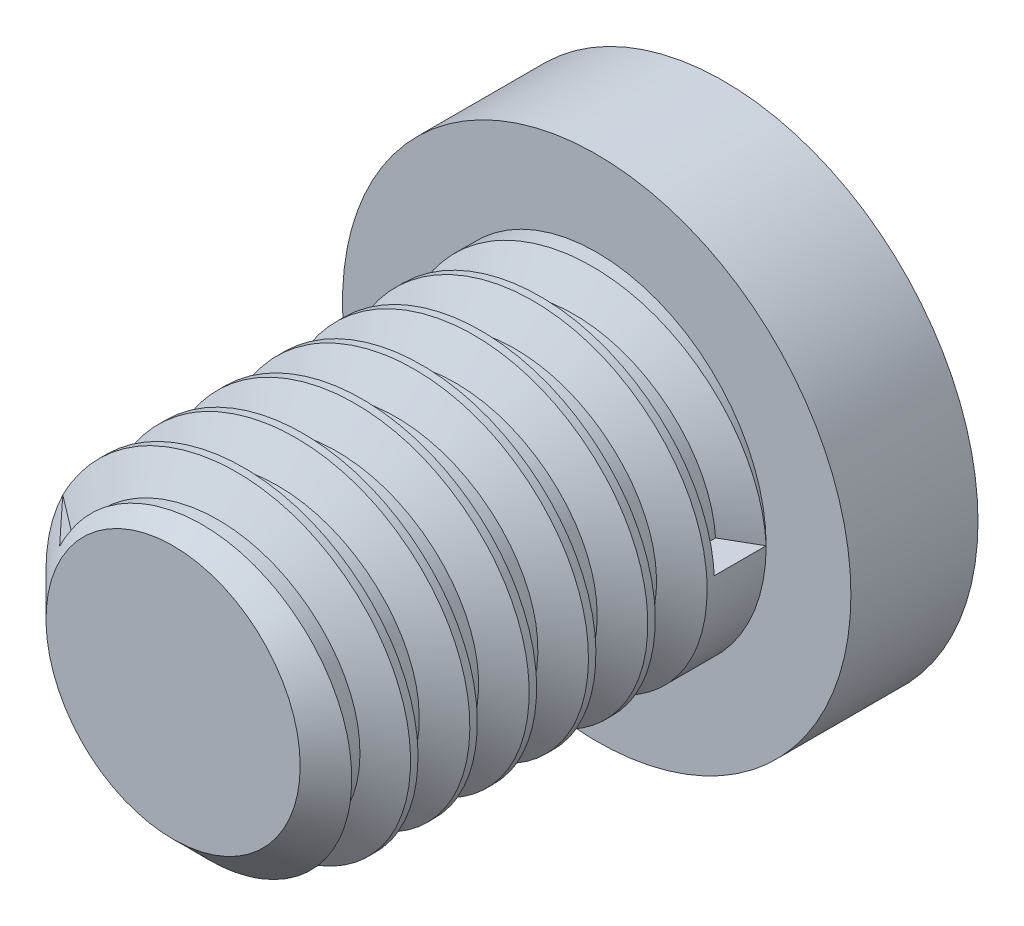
ISO-10303-21;
HEADER;
FILE_DESCRIPTION(('STEP AP214'),'2;1');
FILE_NAME('part.step','',(''),(''),'','','');
FILE_SCHEMA(('AUTOMOTIVE_DESIGN { 1 0 10303 214 1 1 1 1 }'));
ENDSEC;
DATA;
#1=APPLICATION_CONTEXT('core data for automotive mechanical design processes');
#2=APPLICATION_PROTOCOL_DEFINITION('international standard','automotive_design',2000,#1);
#3=PRODUCT_CONTEXT('',#1,'mechanical');
#4=PRODUCT('Part','Part','',(#3));
#5=PRODUCT_RELATED_PRODUCT_CATEGORY('part','',(#4));
#6=PRODUCT_DEFINITION_FORMATION('','',#4);
#7=PRODUCT_DEFINITION_CONTEXT('part definition',#1,'design');
#8=PRODUCT_DEFINITION('design','',#6,#7);
#9=PRODUCT_DEFINITION_SHAPE('','',#8);
#10=(LENGTH_UNIT() NAMED_UNIT(*) SI_UNIT(.MILLI.,.METRE.));
#11=(NAMED_UNIT(*) PLANE_ANGLE_UNIT() SI_UNIT($,.RADIAN.));
#12=(NAMED_UNIT(*) SI_UNIT($,.STERADIAN.) SOLID_ANGLE_UNIT());
#13=UNCERTAINTY_MEASURE_WITH_UNIT(LENGTH_MEASURE(1.E-05),#10,'distance_accuracy_value','');
#14=(GEOMETRIC_REPRESENTATION_CONTEXT(3) GLOBAL_UNCERTAINTY_ASSIGNED_CONTEXT((#13)) GLOBAL_UNIT_ASSIGNED_CONTEXT((#10,
#11,#12)) REPRESENTATION_CONTEXT('',''));
#15=CARTESIAN_POINT('',(0.,0.,0.));
#16=DIRECTION('',(0.,0.,1.));
#17=DIRECTION('',(1.,0.,0.));
#18=AXIS2_PLACEMENT_3D('',#15,#16,#17);
#19=CARTESIAN_POINT('',(0.75,-2.,-0.75));
#20=DIRECTION('',(1.,0.,0.));
#21=DIRECTION('',(0.,0.,-1.));
#22=AXIS2_PLACEMENT_3D('',#19,#20,#21);
#23=PLANE('',#22);
#24=DIRECTION('',(0.,-1.,0.));
#25=VECTOR('',#24,1.);
#26=CARTESIAN_POINT('',(0.75,-2.,-1.5));
#27=LINE('',#26,#25);
#28=CARTESIAN_POINT('',(0.75,2.6,-1.5));
#29=VERTEX_POINT('',#28);
#30=CARTESIAN_POINT('',(0.75,0.750000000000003,-1.5));
#31=VERTEX_POINT('',#30);
#32=EDGE_CURVE('E291',#29,#31,#27,.T.);
#33=ORIENTED_EDGE('',*,*,#32,.T.);
#34=DIRECTION('',(0.,0.,1.));
#35=VECTOR('',#34,1.);
#36=CARTESIAN_POINT('',(0.75,0.750000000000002,-0.75));
#37=LINE('',#36,#35);
#38=CARTESIAN_POINT('',(0.75,0.750000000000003,-0.75));
#39=VERTEX_POINT('',#38);
#40=EDGE_CURVE('E277',#31,#39,#37,.T.);
#41=ORIENTED_EDGE('',*,*,#40,.T.);
#42=DIRECTION('',(0.,-1.,0.));
#43=VECTOR('',#42,1.);
#44=CARTESIAN_POINT('',(0.75,-2.,-0.75));
#45=LINE('',#44,#43);
#46=CARTESIAN_POINT('',(0.75,2.,-0.75));
#47=VERTEX_POINT('',#46);
#48=EDGE_CURVE('E250',#47,#39,#45,.T.);
#49=ORIENTED_EDGE('',*,*,#48,.F.);
#50=DIRECTION('',(0.,-0.624695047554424,0.780868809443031));
#51=VECTOR('',#50,1.);
#52=CARTESIAN_POINT('',(0.75,0.439024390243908,1.20121951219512));
#53=LINE('',#52,#51);
#54=EDGE_CURVE('E515',#47,#29,#53,.F.);
#55=ORIENTED_EDGE('',*,*,#54,.T.);
#56=EDGE_LOOP('',(#33,#41,#49,#55));
#57=FACE_BOUND('',#56,.T.);
#58=ADVANCED_FACE('F98',(#57),#23,.F.);
#59=CARTESIAN_POINT('',(-0.75,-2.,-0.75));
#60=DIRECTION('',(-1.,0.,0.));
#61=DIRECTION('',(0.,0.,1.));
#62=AXIS2_PLACEMENT_3D('',#59,#60,#61);
#63=PLANE('',#62);
#64=DIRECTION('',(0.,1.,0.));
#65=VECTOR('',#64,1.);
#66=CARTESIAN_POINT('',(-0.75,-2.,-0.75));
#67=LINE('',#66,#65);
#68=CARTESIAN_POINT('',(-0.75,0.75,-0.75));
#69=VERTEX_POINT('',#68);
#70=CARTESIAN_POINT('',(-0.75,2.,-0.75));
#71=VERTEX_POINT('',#70);
#72=EDGE_CURVE('E285',#69,#71,#67,.T.);
#73=ORIENTED_EDGE('',*,*,#72,.F.);
#74=DIRECTION('',(0.,0.,-1.));
#75=VECTOR('',#74,1.);
#76=CARTESIAN_POINT('',(-0.75,0.749999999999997,-0.75));
#77=LINE('',#76,#75);
#78=CARTESIAN_POINT('',(-0.75,0.749999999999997,-1.5));
#79=VERTEX_POINT('',#78);
#80=EDGE_CURVE('E274',#69,#79,#77,.T.);
#81=ORIENTED_EDGE('',*,*,#80,.T.);
#82=DIRECTION('',(0.,1.,0.));
#83=VECTOR('',#82,1.);
#84=CARTESIAN_POINT('',(-0.75,-2.,-1.5));
#85=LINE('',#84,#83);
#86=CARTESIAN_POINT('',(-0.75,2.6,-1.5));
#87=VERTEX_POINT('',#86);
#88=EDGE_CURVE('E294',#79,#87,#85,.T.);
#89=ORIENTED_EDGE('',*,*,#88,.T.);
#90=DIRECTION('',(0.,0.624695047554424,-0.780868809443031));
#91=VECTOR('',#90,1.);
#92=CARTESIAN_POINT('',(-0.75,0.439024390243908,1.20121951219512));
#93=LINE('',#92,#91);
#94=EDGE_CURVE('E518',#87,#71,#93,.F.);
#95=ORIENTED_EDGE('',*,*,#94,.T.);
#96=EDGE_LOOP('',(#73,#81,#89,#95));
#97=FACE_BOUND('',#96,.T.);
#98=ADVANCED_FACE('F447',(#97),#63,.F.);
#99=CARTESIAN_POINT('',(0.,0.,5.));
#100=DIRECTION('',(0.,0.,-1.));
#101=DIRECTION('',(-1.,0.,0.));
#102=AXIS2_PLACEMENT_3D('',#99,#100,#101);
#103=CYLINDRICAL_SURFACE('',#102,2.);
#104=CARTESIAN_POINT('',(-1.79901271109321,0.873815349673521,4.49999433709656));
#105=CARTESIAN_POINT('',(-1.79910005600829,0.873547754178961,4.5000327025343));
#106=CARTESIAN_POINT('',(-1.79918734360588,0.87328014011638,4.50007106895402));
#107=CARTESIAN_POINT('',(-1.79936179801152,0.872744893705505,4.50014780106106));
#108=CARTESIAN_POINT('',(-1.79944896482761,0.872477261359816,4.50018616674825));
#109=CARTESIAN_POINT('',(-1.79962317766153,0.871941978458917,4.50026289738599));
#110=CARTESIAN_POINT('',(-1.79971022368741,0.871674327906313,4.50030126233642));
#111=CARTESIAN_POINT('',(-1.79988419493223,0.8711390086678,4.50037799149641));
#112=CARTESIAN_POINT('',(-1.79997112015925,0.870871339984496,4.50041635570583));
#113=CARTESIAN_POINT('',(-1.80014484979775,0.870335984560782,4.50049308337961));
#114=CARTESIAN_POINT('',(-1.80023165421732,0.870068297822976,4.50053144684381));
#115=CARTESIAN_POINT('',(-1.80040514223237,0.869532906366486,4.50060817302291));
#116=CARTESIAN_POINT('',(-1.80049182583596,0.869265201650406,4.50064653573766));
#117=CARTESIAN_POINT('',(-1.80066507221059,0.868729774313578,4.50072326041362));
#118=CARTESIAN_POINT('',(-1.80075163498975,0.868462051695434,4.50076162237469));
#119=CARTESIAN_POINT('',(-1.80092463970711,0.867926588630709,4.50083834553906));
#120=CARTESIAN_POINT('',(-1.80101108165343,0.867658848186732,4.50087670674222));
#121=CARTESIAN_POINT('',(-1.80109746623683,0.867391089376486,4.50091506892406));
#122=B_SPLINE_CURVE_WITH_KNOTS('',3,(#104,#105,#106,#107,#108,#109,#110,#111,#112,#113,#114,
#115,#116,#117,#118,#119,#120,#121),.UNSPECIFIED.,.F.,.F.,(4,2,2,2,2,2,2,2,4),(0.,
0.000852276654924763,0.00170449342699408,0.0025566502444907,0.00340874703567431,
0.00426078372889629,0.00511276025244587,0.00596467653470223,0.00681653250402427),.UNSPECIFIED.);
#123=CARTESIAN_POINT('',(-1.80164342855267,0.867682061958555,4.50034591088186));
#124=VERTEX_POINT('',#123);
#125=CARTESIAN_POINT('',(-1.79903390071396,0.873771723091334,4.49999998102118));
#126=VERTEX_POINT('',#125);
#127=EDGE_CURVE('E386',#124,#126,#122,.F.);
#128=ORIENTED_EDGE('',*,*,#127,.T.);
#129=CARTESIAN_POINT('',(2.,0.,0.));
#130=CARTESIAN_POINT('',(2.,1.15470053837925,0.0583333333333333));
#131=CARTESIAN_POINT('',(1.,1.73205080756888,0.116666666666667));
#132=CARTESIAN_POINT('',(0.,2.3094010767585,0.175));
#133=CARTESIAN_POINT('',(-1.,1.73205080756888,0.233333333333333));
#134=CARTESIAN_POINT('',(-2.,1.15470053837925,0.291666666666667));
#135=CARTESIAN_POINT('',(-2.,0.,0.35));
#136=CARTESIAN_POINT('',(-2.,-1.15470053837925,0.408333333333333));
#137=CARTESIAN_POINT('',(-1.,-1.73205080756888,0.466666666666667));
#138=CARTESIAN_POINT('',(0.,-2.3094010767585,0.525));
#139=CARTESIAN_POINT('',(0.999999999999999,-1.73205080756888,0.583333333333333));
#140=CARTESIAN_POINT('',(2.,-1.15470053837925,0.641666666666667));
#141=CARTESIAN_POINT('',(2.,0.,0.7));
#142=CARTESIAN_POINT('',(2.,1.15470053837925,0.758333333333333));
#143=CARTESIAN_POINT('',(1.,1.73205080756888,0.816666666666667));
#144=CARTESIAN_POINT('',(0.,2.3094010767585,0.875));
#145=CARTESIAN_POINT('',(-1.,1.73205080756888,0.933333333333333));
#146=CARTESIAN_POINT('',(-2.,1.15470053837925,0.991666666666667));
#147=CARTESIAN_POINT('',(-2.,0.,1.05));
#148=CARTESIAN_POINT('',(-2.,-1.15470053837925,1.10833333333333));
#149=CARTESIAN_POINT('',(-1.,-1.73205080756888,1.16666666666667));
#150=CARTESIAN_POINT('',(0.,-2.3094010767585,1.225));
#151=CARTESIAN_POINT('',(0.999999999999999,-1.73205080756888,1.28333333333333));
#152=CARTESIAN_POINT('',(2.,-1.15470053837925,1.34166666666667));
#153=CARTESIAN_POINT('',(2.,0.,1.4));
#154=CARTESIAN_POINT('',(2.,1.15470053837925,1.45833333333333));
#155=CARTESIAN_POINT('',(1.,1.73205080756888,1.51666666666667));
#156=CARTESIAN_POINT('',(0.,2.3094010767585,1.575));
#157=CARTESIAN_POINT('',(-1.,1.73205080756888,1.63333333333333));
#158=CARTESIAN_POINT('',(-2.,1.15470053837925,1.69166666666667));
#159=CARTESIAN_POINT('',(-2.,0.,1.75));
#160=CARTESIAN_POINT('',(-2.,-1.15470053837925,1.80833333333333));
#161=CARTESIAN_POINT('',(-1.,-1.73205080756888,1.86666666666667));
#162=CARTESIAN_POINT('',(0.,-2.3094010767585,1.925));
#163=CARTESIAN_POINT('',(0.999999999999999,-1.73205080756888,1.98333333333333));
#164=CARTESIAN_POINT('',(2.,-1.15470053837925,2.04166666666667));
#165=CARTESIAN_POINT('',(2.,0.,2.1));
#166=CARTESIAN_POINT('',(2.,1.15470053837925,2.15833333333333));
#167=CARTESIAN_POINT('',(1.,1.73205080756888,2.21666666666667));
#168=CARTESIAN_POINT('',(0.,2.3094010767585,2.275));
#169=CARTESIAN_POINT('',(-1.,1.73205080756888,2.33333333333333));
#170=CARTESIAN_POINT('',(-2.,1.15470053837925,2.39166666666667));
#171=CARTESIAN_POINT('',(-2.,0.,2.45));
#172=CARTESIAN_POINT('',(-2.,-1.15470053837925,2.50833333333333));
#173=CARTESIAN_POINT('',(-1.,-1.73205080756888,2.56666666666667));
#174=CARTESIAN_POINT('',(0.,-2.3094010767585,2.625));
#175=CARTESIAN_POINT('',(0.999999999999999,-1.73205080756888,2.68333333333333));
#176=CARTESIAN_POINT('',(2.,-1.15470053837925,2.74166666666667));
#177=CARTESIAN_POINT('',(2.,0.,2.8));
#178=CARTESIAN_POINT('',(2.,1.15470053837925,2.85833333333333));
#179=CARTESIAN_POINT('',(1.,1.73205080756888,2.91666666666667));
#180=CARTESIAN_POINT('',(0.,2.3094010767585,2.975));
#181=CARTESIAN_POINT('',(-1.,1.73205080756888,3.03333333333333));
#182=CARTESIAN_POINT('',(-2.,1.15470053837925,3.09166666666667));
#183=CARTESIAN_POINT('',(-2.,0.,3.15));
#184=CARTESIAN_POINT('',(-2.,-1.15470053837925,3.20833333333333));
#185=CARTESIAN_POINT('',(-1.,-1.73205080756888,3.26666666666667));
#186=CARTESIAN_POINT('',(0.,-2.3094010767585,3.325));
#187=CARTESIAN_POINT('',(0.999999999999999,-1.73205080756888,3.38333333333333));
#188=CARTESIAN_POINT('',(2.,-1.15470053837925,3.44166666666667));
#189=CARTESIAN_POINT('',(2.,0.,3.5));
#190=CARTESIAN_POINT('',(2.,1.15470053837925,3.55833333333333));
#191=CARTESIAN_POINT('',(1.,1.73205080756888,3.61666666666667));
#192=CARTESIAN_POINT('',(0.,2.3094010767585,3.675));
#193=CARTESIAN_POINT('',(-1.,1.73205080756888,3.73333333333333));
#194=CARTESIAN_POINT('',(-2.,1.15470053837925,3.79166666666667));
#195=CARTESIAN_POINT('',(-2.,0.,3.85));
#196=CARTESIAN_POINT('',(-2.,-1.15470053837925,3.90833333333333));
#197=CARTESIAN_POINT('',(-1.,-1.73205080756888,3.96666666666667));
#198=CARTESIAN_POINT('',(0.,-2.3094010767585,4.025));
#199=CARTESIAN_POINT('',(0.999999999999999,-1.73205080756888,4.08333333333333));
#200=CARTESIAN_POINT('',(2.,-1.15470053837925,4.14166666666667));
#201=CARTESIAN_POINT('',(2.,0.,4.2));
#202=CARTESIAN_POINT('',(2.,1.15470053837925,4.25833333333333));
#203=CARTESIAN_POINT('',(1.,1.73205080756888,4.31666666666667));
#204=CARTESIAN_POINT('',(0.,2.3094010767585,4.375));
#205=CARTESIAN_POINT('',(-1.,1.73205080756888,4.43333333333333));
#206=CARTESIAN_POINT('',(-1.53425483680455,1.42359863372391,4.4644981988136));
#207=CARTESIAN_POINT('',(-1.80192668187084,0.867790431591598,4.5003836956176));
#208=(BOUNDED_CURVE() B_SPLINE_CURVE(2,(#129,#130,#131,#132,#133,#134,#135,#136,#137,#138,#139,
#140,#141,#142,#143,#144,#145,#146,#147,#148,#149,#150,#151,#152,#153,#154,#155,#156,#157,#158,
#159,#160,#161,#162,#163,#164,#165,#166,#167,#168,#169,#170,#171,#172,#173,#174,#175,#176,#177,
#178,#179,#180,#181,#182,#183,#184,#185,#186,#187,#188,#189,#190,#191,#192,#193,#194,#195,#196,
#197,#198,#199,#200,#201,#202,#203,#204,#205,#206,#207),.UNSPECIFIED.,.F.,
.F.) B_SPLINE_CURVE_WITH_KNOTS((3,2,2,2,2,2,2,2,2,2,2,2,2,2,2,2,2,2,2,2,2,2,2,2,2,2,2,2,2,2,2,2,
2,2,2,2,2,2,2,3),(0.,0.0238095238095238,0.0476190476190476,0.0714285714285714,
0.0952380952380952,0.119047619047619,0.142857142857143,0.166666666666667,0.19047619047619,
0.214285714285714,0.238095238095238,0.261904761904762,0.285714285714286,0.30952380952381,
0.333333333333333,0.357142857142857,0.380952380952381,0.404761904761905,0.428571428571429,
0.452380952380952,0.476190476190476,0.5,0.523809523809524,0.547619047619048,0.571428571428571,
0.595238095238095,0.619047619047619,0.642857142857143,0.666666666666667,0.69047619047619,
0.714285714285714,0.738095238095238,0.761904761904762,0.785714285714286,0.80952380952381,
0.833333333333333,0.857142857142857,0.880952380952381,0.904761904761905,0.918328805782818),
.UNSPECIFIED.) CURVE() GEOMETRIC_REPRESENTATION_ITEM() RATIONAL_B_SPLINE_CURVE((1.,
0.866025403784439,1.,0.866025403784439,1.,0.866025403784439,1.,0.866025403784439,1.,
0.866025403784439,1.,0.866025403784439,1.,0.866025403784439,1.,0.866025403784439,1.,
0.866025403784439,1.,0.866025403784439,1.,0.866025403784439,1.,0.866025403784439,1.,
0.866025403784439,1.,0.866025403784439,1.,0.866025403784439,1.,0.866025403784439,1.,
0.866025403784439,1.,0.866025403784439,1.,0.866025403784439,1.,0.866025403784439,1.,
0.866025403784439,1.,0.866025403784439,1.,0.866025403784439,1.,0.866025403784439,1.,
0.866025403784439,1.,0.866025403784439,1.,0.866025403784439,1.,0.866025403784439,1.,
0.866025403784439,1.,0.866025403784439,1.,0.866025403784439,1.,0.866025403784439,1.,
0.866025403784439,1.,0.866025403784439,1.,0.866025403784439,1.,0.866025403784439,1.,
0.866025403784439,1.,0.866025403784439,1.,0.923659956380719,0.934318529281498)) REPRESENTATION_ITEM(''));
#209=CARTESIAN_POINT('',(2.,0.,0.));
#210=VERTEX_POINT('',#209);
#211=EDGE_CURVE('E367',#210,#126,#208,.T.);
#212=ORIENTED_EDGE('',*,*,#211,.F.);
#213=CARTESIAN_POINT('',(0.,0.,0.));
#214=DIRECTION('',(0.,0.,1.));
#215=DIRECTION('',(1.,0.,0.));
#216=AXIS2_PLACEMENT_3D('',#213,#214,#215);
#217=CIRCLE('',#216,2.);
#218=EDGE_CURVE('E412',#210,#210,#217,.T.);
#219=ORIENTED_EDGE('',*,*,#218,.T.);
#220=CARTESIAN_POINT('',(2.,0.,0.));
#221=CARTESIAN_POINT('',(2.,0.,0.612499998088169));
#222=(BOUNDED_CURVE() B_SPLINE_CURVE(1,(#220,#221),.UNSPECIFIED.,.F.,
.F.) B_SPLINE_CURVE_WITH_KNOTS((2,2),(0.,1.),
.UNSPECIFIED.) CURVE() GEOMETRIC_REPRESENTATION_ITEM() RATIONAL_B_SPLINE_CURVE((1.,1.)) REPRESENTATION_ITEM(''));
#223=CARTESIAN_POINT('',(2.,0.,0.612499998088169));
#224=VERTEX_POINT('',#223);
#225=EDGE_CURVE('E342',#210,#224,#222,.T.);
#226=ORIENTED_EDGE('',*,*,#225,.T.);
#227=CARTESIAN_POINT('',(-1.80193046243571,0.867782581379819,5.11288420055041));
#228=CARTESIAN_POINT('',(-1.53425896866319,1.42359624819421,5.07699843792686));
#229=CARTESIAN_POINT('',(-1.,1.73205080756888,5.0458333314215));
#230=CARTESIAN_POINT('',(0.,2.3094010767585,4.98749999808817));
#231=CARTESIAN_POINT('',(1.,1.73205080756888,4.92916666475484));
#232=CARTESIAN_POINT('',(2.,1.15470053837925,4.8708333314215));
#233=CARTESIAN_POINT('',(2.,0.,4.81249999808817));
#234=CARTESIAN_POINT('',(2.,-1.15470053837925,4.75416666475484));
#235=CARTESIAN_POINT('',(0.999999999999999,-1.73205080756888,4.6958333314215));
#236=CARTESIAN_POINT('',(0.,-2.3094010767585,4.63749999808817));
#237=CARTESIAN_POINT('',(-1.,-1.73205080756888,4.57916666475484));
#238=CARTESIAN_POINT('',(-2.,-1.15470053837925,4.5208333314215));
#239=CARTESIAN_POINT('',(-2.,0.,4.46249999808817));
#240=CARTESIAN_POINT('',(-2.,1.15470053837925,4.40416666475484));
#241=CARTESIAN_POINT('',(-1.,1.73205080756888,4.3458333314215));
#242=CARTESIAN_POINT('',(0.,2.3094010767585,4.28749999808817));
#243=CARTESIAN_POINT('',(1.,1.73205080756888,4.22916666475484));
#244=CARTESIAN_POINT('',(2.,1.15470053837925,4.1708333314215));
#245=CARTESIAN_POINT('',(2.,0.,4.11249999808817));
#246=CARTESIAN_POINT('',(2.,-1.15470053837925,4.05416666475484));
#247=CARTESIAN_POINT('',(0.999999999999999,-1.73205080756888,3.9958333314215));
#248=CARTESIAN_POINT('',(0.,-2.3094010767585,3.93749999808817));
#249=CARTESIAN_POINT('',(-1.,-1.73205080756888,3.87916666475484));
#250=CARTESIAN_POINT('',(-2.,-1.15470053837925,3.8208333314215));
#251=CARTESIAN_POINT('',(-2.,0.,3.76249999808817));
#252=CARTESIAN_POINT('',(-2.,1.15470053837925,3.70416666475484));
#253=CARTESIAN_POINT('',(-1.,1.73205080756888,3.6458333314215));
#254=CARTESIAN_POINT('',(0.,2.3094010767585,3.58749999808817));
#255=CARTESIAN_POINT('',(1.,1.73205080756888,3.52916666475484));
#256=CARTESIAN_POINT('',(2.,1.15470053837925,3.4708333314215));
#257=CARTESIAN_POINT('',(2.,0.,3.41249999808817));
#258=CARTESIAN_POINT('',(2.,-1.15470053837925,3.35416666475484));
#259=CARTESIAN_POINT('',(0.999999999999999,-1.73205080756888,3.2958333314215));
#260=CARTESIAN_POINT('',(0.,-2.3094010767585,3.23749999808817));
#261=CARTESIAN_POINT('',(-1.,-1.73205080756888,3.17916666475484));
#262=CARTESIAN_POINT('',(-2.,-1.15470053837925,3.1208333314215));
#263=CARTESIAN_POINT('',(-2.,0.,3.06249999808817));
#264=CARTESIAN_POINT('',(-2.,1.15470053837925,3.00416666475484));
#265=CARTESIAN_POINT('',(-1.,1.73205080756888,2.9458333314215));
#266=CARTESIAN_POINT('',(0.,2.3094010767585,2.88749999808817));
#267=CARTESIAN_POINT('',(1.,1.73205080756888,2.82916666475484));
#268=CARTESIAN_POINT('',(2.,1.15470053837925,2.7708333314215));
#269=CARTESIAN_POINT('',(2.,0.,2.71249999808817));
#270=CARTESIAN_POINT('',(2.,-1.15470053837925,2.65416666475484));
#271=CARTESIAN_POINT('',(0.999999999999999,-1.73205080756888,2.5958333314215));
#272=CARTESIAN_POINT('',(0.,-2.3094010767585,2.53749999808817));
#273=CARTESIAN_POINT('',(-1.,-1.73205080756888,2.47916666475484));
#274=CARTESIAN_POINT('',(-2.,-1.15470053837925,2.4208333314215));
#275=CARTESIAN_POINT('',(-2.,0.,2.36249999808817));
#276=CARTESIAN_POINT('',(-2.,1.15470053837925,2.30416666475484));
#277=CARTESIAN_POINT('',(-1.,1.73205080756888,2.2458333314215));
#278=CARTESIAN_POINT('',(0.,2.3094010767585,2.18749999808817));
#279=CARTESIAN_POINT('',(1.,1.73205080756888,2.12916666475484));
#280=CARTESIAN_POINT('',(2.,1.15470053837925,2.0708333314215));
#281=CARTESIAN_POINT('',(2.,0.,2.01249999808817));
#282=CARTESIAN_POINT('',(2.,-1.15470053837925,1.95416666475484));
#283=CARTESIAN_POINT('',(0.999999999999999,-1.73205080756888,1.8958333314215));
#284=CARTESIAN_POINT('',(0.,-2.3094010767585,1.83749999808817));
#285=CARTESIAN_POINT('',(-1.,-1.73205080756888,1.77916666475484));
#286=CARTESIAN_POINT('',(-2.,-1.15470053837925,1.7208333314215));
#287=CARTESIAN_POINT('',(-2.,0.,1.66249999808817));
#288=CARTESIAN_POINT('',(-2.,1.15470053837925,1.60416666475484));
#289=CARTESIAN_POINT('',(-1.,1.73205080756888,1.5458333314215));
#290=CARTESIAN_POINT('',(0.,2.3094010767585,1.48749999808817));
#291=CARTESIAN_POINT('',(1.,1.73205080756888,1.42916666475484));
#292=CARTESIAN_POINT('',(2.,1.15470053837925,1.3708333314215));
#293=CARTESIAN_POINT('',(2.,0.,1.31249999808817));
#294=CARTESIAN_POINT('',(2.,-1.15470053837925,1.25416666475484));
#295=CARTESIAN_POINT('',(0.999999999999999,-1.73205080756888,1.1958333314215));
#296=CARTESIAN_POINT('',(0.,-2.3094010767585,1.13749999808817));
#297=CARTESIAN_POINT('',(-1.,-1.73205080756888,1.07916666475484));
#298=CARTESIAN_POINT('',(-2.,-1.15470053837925,1.0208333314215));
#299=CARTESIAN_POINT('',(-2.,0.,0.962499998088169));
#300=CARTESIAN_POINT('',(-2.,1.15470053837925,0.904166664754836));
#301=CARTESIAN_POINT('',(-1.,1.73205080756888,0.845833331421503));
#302=CARTESIAN_POINT('',(0.,2.3094010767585,0.787499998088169));
#303=CARTESIAN_POINT('',(1.,1.73205080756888,0.729166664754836));
#304=CARTESIAN_POINT('',(2.,1.15470053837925,0.670833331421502));
#305=CARTESIAN_POINT('',(2.,0.,0.612499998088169));
#306=(BOUNDED_CURVE() B_SPLINE_CURVE(2,(#227,#228,#229,#230,#231,#232,#233,#234,#235,#236,#237,
#238,#239,#240,#241,#242,#243,#244,#245,#246,#247,#248,#249,#250,#251,#252,#253,#254,#255,#256,
#257,#258,#259,#260,#261,#262,#263,#264,#265,#266,#267,#268,#269,#270,#271,#272,#273,#274,#275,
#276,#277,#278,#279,#280,#281,#282,#283,#284,#285,#286,#287,#288,#289,#290,#291,#292,#293,#294,
#295,#296,#297,#298,#299,#300,#301,#302,#303,#304,#305),.UNSPECIFIED.,.F.,
.F.) B_SPLINE_CURVE_WITH_KNOTS((3,2,2,2,2,2,2,2,2,2,2,2,2,2,2,2,2,2,2,2,2,2,2,2,2,2,2,2,2,2,2,2,
2,2,2,2,2,2,2,3),(0.,0.0135669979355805,0.0373765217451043,0.0611860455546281,
0.0849955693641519,0.108805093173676,0.1326146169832,0.156424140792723,0.180233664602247,
0.204043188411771,0.227852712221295,0.251662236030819,0.275471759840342,0.299281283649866,
0.32309080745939,0.346900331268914,0.370709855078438,0.394519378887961,0.418328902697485,
0.442138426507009,0.465947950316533,0.489757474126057,0.51356699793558,0.537376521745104,
0.561186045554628,0.584995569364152,0.608805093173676,0.6326146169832,0.656424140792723,
0.680233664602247,0.704043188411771,0.727852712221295,0.751662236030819,0.775471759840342,
0.799281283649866,0.82309080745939,0.846900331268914,0.870709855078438,0.894519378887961,
0.918328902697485),
.UNSPECIFIED.) CURVE() GEOMETRIC_REPRESENTATION_ITEM() RATIONAL_B_SPLINE_CURVE((0.934318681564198,
0.923659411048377,1.,0.866025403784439,1.,0.866025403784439,1.,0.866025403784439,1.,
0.866025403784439,1.,0.866025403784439,1.,0.866025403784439,1.,0.866025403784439,1.,
0.866025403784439,1.,0.866025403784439,1.,0.866025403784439,1.,0.866025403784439,1.,
0.866025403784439,1.,0.866025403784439,1.,0.866025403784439,1.,0.866025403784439,1.,
0.866025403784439,1.,0.866025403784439,1.,0.866025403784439,1.,0.866025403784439,1.,
0.866025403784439,1.,0.866025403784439,1.,0.866025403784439,1.,0.866025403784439,1.,
0.866025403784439,1.,0.866025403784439,1.,0.866025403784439,1.,0.866025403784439,1.,
0.866025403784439,1.,0.866025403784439,1.,0.866025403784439,1.,0.866025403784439,1.,
0.866025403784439,1.,0.866025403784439,1.,0.866025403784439,1.,0.866025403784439,1.,
0.866025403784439,1.,0.866025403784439,1.,0.866025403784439,1.)) REPRESENTATION_ITEM(''));
#307=CARTESIAN_POINT('',(-2.,-5.95345036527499E-08,0.962500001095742));
#308=VERTEX_POINT('',#307);
#309=EDGE_CURVE('E370',#224,#308,#306,.F.);
#310=ORIENTED_EDGE('',*,*,#309,.T.);
#311=CARTESIAN_POINT('',(-1.80193046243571,0.867782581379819,5.11288420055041));
#312=CARTESIAN_POINT('',(-1.53425896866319,1.42359624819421,5.07699843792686));
#313=CARTESIAN_POINT('',(-1.,1.73205080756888,5.0458333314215));
#314=CARTESIAN_POINT('',(0.,2.3094010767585,4.98749999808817));
#315=CARTESIAN_POINT('',(1.,1.73205080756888,4.92916666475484));
#316=CARTESIAN_POINT('',(2.,1.15470053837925,4.8708333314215));
#317=CARTESIAN_POINT('',(2.,0.,4.81249999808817));
#318=CARTESIAN_POINT('',(2.,-1.15470053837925,4.75416666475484));
#319=CARTESIAN_POINT('',(0.999999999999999,-1.73205080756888,4.6958333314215));
#320=CARTESIAN_POINT('',(0.,-2.3094010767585,4.63749999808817));
#321=CARTESIAN_POINT('',(-1.,-1.73205080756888,4.57916666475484));
#322=CARTESIAN_POINT('',(-2.,-1.15470053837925,4.5208333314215));
#323=CARTESIAN_POINT('',(-2.,0.,4.46249999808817));
#324=CARTESIAN_POINT('',(-2.,1.15470053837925,4.40416666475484));
#325=CARTESIAN_POINT('',(-1.,1.73205080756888,4.3458333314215));
#326=CARTESIAN_POINT('',(0.,2.3094010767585,4.28749999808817));
#327=CARTESIAN_POINT('',(1.,1.73205080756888,4.22916666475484));
#328=CARTESIAN_POINT('',(2.,1.15470053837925,4.1708333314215));
#329=CARTESIAN_POINT('',(2.,0.,4.11249999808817));
#330=CARTESIAN_POINT('',(2.,-1.15470053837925,4.05416666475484));
#331=CARTESIAN_POINT('',(0.999999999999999,-1.73205080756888,3.9958333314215));
#332=CARTESIAN_POINT('',(0.,-2.3094010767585,3.93749999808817));
#333=CARTESIAN_POINT('',(-1.,-1.73205080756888,3.87916666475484));
#334=CARTESIAN_POINT('',(-2.,-1.15470053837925,3.8208333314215));
#335=CARTESIAN_POINT('',(-2.,0.,3.76249999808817));
#336=CARTESIAN_POINT('',(-2.,1.15470053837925,3.70416666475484));
#337=CARTESIAN_POINT('',(-1.,1.73205080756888,3.6458333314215));
#338=CARTESIAN_POINT('',(0.,2.3094010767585,3.58749999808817));
#339=CARTESIAN_POINT('',(1.,1.73205080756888,3.52916666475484));
#340=CARTESIAN_POINT('',(2.,1.15470053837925,3.4708333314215));
#341=CARTESIAN_POINT('',(2.,0.,3.41249999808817));
#342=CARTESIAN_POINT('',(2.,-1.15470053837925,3.35416666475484));
#343=CARTESIAN_POINT('',(0.999999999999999,-1.73205080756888,3.2958333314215));
#344=CARTESIAN_POINT('',(0.,-2.3094010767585,3.23749999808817));
#345=CARTESIAN_POINT('',(-1.,-1.73205080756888,3.17916666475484));
#346=CARTESIAN_POINT('',(-2.,-1.15470053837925,3.1208333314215));
#347=CARTESIAN_POINT('',(-2.,0.,3.06249999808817));
#348=CARTESIAN_POINT('',(-2.,1.15470053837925,3.00416666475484));
#349=CARTESIAN_POINT('',(-1.,1.73205080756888,2.9458333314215));
#350=CARTESIAN_POINT('',(0.,2.3094010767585,2.88749999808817));
#351=CARTESIAN_POINT('',(1.,1.73205080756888,2.82916666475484));
#352=CARTESIAN_POINT('',(2.,1.15470053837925,2.7708333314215));
#353=CARTESIAN_POINT('',(2.,0.,2.71249999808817));
#354=CARTESIAN_POINT('',(2.,-1.15470053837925,2.65416666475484));
#355=CARTESIAN_POINT('',(0.999999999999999,-1.73205080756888,2.5958333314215));
#356=CARTESIAN_POINT('',(0.,-2.3094010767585,2.53749999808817));
#357=CARTESIAN_POINT('',(-1.,-1.73205080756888,2.47916666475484));
#358=CARTESIAN_POINT('',(-2.,-1.15470053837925,2.4208333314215));
#359=CARTESIAN_POINT('',(-2.,0.,2.36249999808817));
#360=CARTESIAN_POINT('',(-2.,1.15470053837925,2.30416666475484));
#361=CARTESIAN_POINT('',(-1.,1.73205080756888,2.2458333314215));
#362=CARTESIAN_POINT('',(0.,2.3094010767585,2.18749999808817));
#363=CARTESIAN_POINT('',(1.,1.73205080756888,2.12916666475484));
#364=CARTESIAN_POINT('',(2.,1.15470053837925,2.0708333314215));
#365=CARTESIAN_POINT('',(2.,0.,2.01249999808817));
#366=CARTESIAN_POINT('',(2.,-1.15470053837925,1.95416666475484));
#367=CARTESIAN_POINT('',(0.999999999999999,-1.73205080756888,1.8958333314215));
#368=CARTESIAN_POINT('',(0.,-2.3094010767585,1.83749999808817));
#369=CARTESIAN_POINT('',(-1.,-1.73205080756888,1.77916666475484));
#370=CARTESIAN_POINT('',(-2.,-1.15470053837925,1.7208333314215));
#371=CARTESIAN_POINT('',(-2.,0.,1.66249999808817));
#372=CARTESIAN_POINT('',(-2.,1.15470053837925,1.60416666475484));
#373=CARTESIAN_POINT('',(-1.,1.73205080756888,1.5458333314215));
#374=CARTESIAN_POINT('',(0.,2.3094010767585,1.48749999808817));
#375=CARTESIAN_POINT('',(1.,1.73205080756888,1.42916666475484));
#376=CARTESIAN_POINT('',(2.,1.15470053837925,1.3708333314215));
#377=CARTESIAN_POINT('',(2.,0.,1.31249999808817));
#378=CARTESIAN_POINT('',(2.,-1.15470053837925,1.25416666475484));
#379=CARTESIAN_POINT('',(0.999999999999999,-1.73205080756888,1.1958333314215));
#380=CARTESIAN_POINT('',(0.,-2.3094010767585,1.13749999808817));
#381=CARTESIAN_POINT('',(-1.,-1.73205080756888,1.07916666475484));
#382=CARTESIAN_POINT('',(-2.,-1.15470053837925,1.0208333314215));
#383=CARTESIAN_POINT('',(-2.,0.,0.962499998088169));
#384=CARTESIAN_POINT('',(-2.,1.15470053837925,0.904166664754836));
#385=CARTESIAN_POINT('',(-1.,1.73205080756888,0.845833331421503));
#386=CARTESIAN_POINT('',(0.,2.3094010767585,0.787499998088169));
#387=CARTESIAN_POINT('',(1.,1.73205080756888,0.729166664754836));
#388=CARTESIAN_POINT('',(2.,1.15470053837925,0.670833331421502));
#389=CARTESIAN_POINT('',(2.,0.,0.612499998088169));
#390=(BOUNDED_CURVE() B_SPLINE_CURVE(2,(#311,#312,#313,#314,#315,#316,#317,#318,#319,#320,#321,
#322,#323,#324,#325,#326,#327,#328,#329,#330,#331,#332,#333,#334,#335,#336,#337,#338,#339,#340,
#341,#342,#343,#344,#345,#346,#347,#348,#349,#350,#351,#352,#353,#354,#355,#356,#357,#358,#359,
#360,#361,#362,#363,#364,#365,#366,#367,#368,#369,#370,#371,#372,#373,#374,#375,#376,#377,#378,
#379,#380,#381,#382,#383,#384,#385,#386,#387,#388,#389),.UNSPECIFIED.,.F.,
.F.) B_SPLINE_CURVE_WITH_KNOTS((3,2,2,2,2,2,2,2,2,2,2,2,2,2,2,2,2,2,2,2,2,2,2,2,2,2,2,2,2,2,2,2,
2,2,2,2,2,2,2,3),(0.,0.0135669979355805,0.0373765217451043,0.0611860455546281,
0.0849955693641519,0.108805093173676,0.1326146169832,0.156424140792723,0.180233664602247,
0.204043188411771,0.227852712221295,0.251662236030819,0.275471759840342,0.299281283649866,
0.32309080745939,0.346900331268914,0.370709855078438,0.394519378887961,0.418328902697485,
0.442138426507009,0.465947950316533,0.489757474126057,0.51356699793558,0.537376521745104,
0.561186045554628,0.584995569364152,0.608805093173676,0.6326146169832,0.656424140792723,
0.680233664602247,0.704043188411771,0.727852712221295,0.751662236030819,0.775471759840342,
0.799281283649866,0.82309080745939,0.846900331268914,0.870709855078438,0.894519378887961,
0.918328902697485),
.UNSPECIFIED.) CURVE() GEOMETRIC_REPRESENTATION_ITEM() RATIONAL_B_SPLINE_CURVE((0.934318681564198,
0.923659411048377,1.,0.866025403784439,1.,0.866025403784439,1.,0.866025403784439,1.,
0.866025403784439,1.,0.866025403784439,1.,0.866025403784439,1.,0.866025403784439,1.,
0.866025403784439,1.,0.866025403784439,1.,0.866025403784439,1.,0.866025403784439,1.,
0.866025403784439,1.,0.866025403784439,1.,0.866025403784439,1.,0.866025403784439,1.,
0.866025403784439,1.,0.866025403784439,1.,0.866025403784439,1.,0.866025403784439,1.,
0.866025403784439,1.,0.866025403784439,1.,0.866025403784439,1.,0.866025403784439,1.,
0.866025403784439,1.,0.866025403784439,1.,0.866025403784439,1.,0.866025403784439,1.,
0.866025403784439,1.,0.866025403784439,1.,0.866025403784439,1.,0.866025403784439,1.,
0.866025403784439,1.,0.866025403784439,1.,0.866025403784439,1.,0.866025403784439,1.,
0.866025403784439,1.,0.866025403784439,1.,0.866025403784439,1.)) REPRESENTATION_ITEM(''));
#391=CARTESIAN_POINT('',(-2.,0.,1.66249999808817));
#392=VERTEX_POINT('',#391);
#393=EDGE_CURVE('E672',#308,#392,#390,.F.);
#394=ORIENTED_EDGE('',*,*,#393,.T.);
#395=CARTESIAN_POINT('',(-1.80193046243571,0.867782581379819,5.11288420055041));
#396=CARTESIAN_POINT('',(-1.53425896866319,1.42359624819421,5.07699843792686));
#397=CARTESIAN_POINT('',(-1.,1.73205080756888,5.0458333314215));
#398=CARTESIAN_POINT('',(0.,2.3094010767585,4.98749999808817));
#399=CARTESIAN_POINT('',(1.,1.73205080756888,4.92916666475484));
#400=CARTESIAN_POINT('',(2.,1.15470053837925,4.8708333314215));
#401=CARTESIAN_POINT('',(2.,0.,4.81249999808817));
#402=CARTESIAN_POINT('',(2.,-1.15470053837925,4.75416666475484));
#403=CARTESIAN_POINT('',(0.999999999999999,-1.73205080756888,4.6958333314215));
#404=CARTESIAN_POINT('',(0.,-2.3094010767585,4.63749999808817));
#405=CARTESIAN_POINT('',(-1.,-1.73205080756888,4.57916666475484));
#406=CARTESIAN_POINT('',(-2.,-1.15470053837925,4.5208333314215));
#407=CARTESIAN_POINT('',(-2.,0.,4.46249999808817));
#408=CARTESIAN_POINT('',(-2.,1.15470053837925,4.40416666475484));
#409=CARTESIAN_POINT('',(-1.,1.73205080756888,4.3458333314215));
#410=CARTESIAN_POINT('',(0.,2.3094010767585,4.28749999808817));
#411=CARTESIAN_POINT('',(1.,1.73205080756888,4.22916666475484));
#412=CARTESIAN_POINT('',(2.,1.15470053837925,4.1708333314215));
#413=CARTESIAN_POINT('',(2.,0.,4.11249999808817));
#414=CARTESIAN_POINT('',(2.,-1.15470053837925,4.05416666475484));
#415=CARTESIAN_POINT('',(0.999999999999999,-1.73205080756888,3.9958333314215));
#416=CARTESIAN_POINT('',(0.,-2.3094010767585,3.93749999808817));
#417=CARTESIAN_POINT('',(-1.,-1.73205080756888,3.87916666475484));
#418=CARTESIAN_POINT('',(-2.,-1.15470053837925,3.8208333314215));
#419=CARTESIAN_POINT('',(-2.,0.,3.76249999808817));
#420=CARTESIAN_POINT('',(-2.,1.15470053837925,3.70416666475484));
#421=CARTESIAN_POINT('',(-1.,1.73205080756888,3.6458333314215));
#422=CARTESIAN_POINT('',(0.,2.3094010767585,3.58749999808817));
#423=CARTESIAN_POINT('',(1.,1.73205080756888,3.52916666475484));
#424=CARTESIAN_POINT('',(2.,1.15470053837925,3.4708333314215));
#425=CARTESIAN_POINT('',(2.,0.,3.41249999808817));
#426=CARTESIAN_POINT('',(2.,-1.15470053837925,3.35416666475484));
#427=CARTESIAN_POINT('',(0.999999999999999,-1.73205080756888,3.2958333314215));
#428=CARTESIAN_POINT('',(0.,-2.3094010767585,3.23749999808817));
#429=CARTESIAN_POINT('',(-1.,-1.73205080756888,3.17916666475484));
#430=CARTESIAN_POINT('',(-2.,-1.15470053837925,3.1208333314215));
#431=CARTESIAN_POINT('',(-2.,0.,3.06249999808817));
#432=CARTESIAN_POINT('',(-2.,1.15470053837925,3.00416666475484));
#433=CARTESIAN_POINT('',(-1.,1.73205080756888,2.9458333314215));
#434=CARTESIAN_POINT('',(0.,2.3094010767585,2.88749999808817));
#435=CARTESIAN_POINT('',(1.,1.73205080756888,2.82916666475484));
#436=CARTESIAN_POINT('',(2.,1.15470053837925,2.7708333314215));
#437=CARTESIAN_POINT('',(2.,0.,2.71249999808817));
#438=CARTESIAN_POINT('',(2.,-1.15470053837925,2.65416666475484));
#439=CARTESIAN_POINT('',(0.999999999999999,-1.73205080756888,2.5958333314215));
#440=CARTESIAN_POINT('',(0.,-2.3094010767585,2.53749999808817));
#441=CARTESIAN_POINT('',(-1.,-1.73205080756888,2.47916666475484));
#442=CARTESIAN_POINT('',(-2.,-1.15470053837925,2.4208333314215));
#443=CARTESIAN_POINT('',(-2.,0.,2.36249999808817));
#444=CARTESIAN_POINT('',(-2.,1.15470053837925,2.30416666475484));
#445=CARTESIAN_POINT('',(-1.,1.73205080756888,2.2458333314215));
#446=CARTESIAN_POINT('',(0.,2.3094010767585,2.18749999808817));
#447=CARTESIAN_POINT('',(1.,1.73205080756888,2.12916666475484));
#448=CARTESIAN_POINT('',(2.,1.15470053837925,2.0708333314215));
#449=CARTESIAN_POINT('',(2.,0.,2.01249999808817));
#450=CARTESIAN_POINT('',(2.,-1.15470053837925,1.95416666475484));
#451=CARTESIAN_POINT('',(0.999999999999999,-1.73205080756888,1.8958333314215));
#452=CARTESIAN_POINT('',(0.,-2.3094010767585,1.83749999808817));
#453=CARTESIAN_POINT('',(-1.,-1.73205080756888,1.77916666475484));
#454=CARTESIAN_POINT('',(-2.,-1.15470053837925,1.7208333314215));
#455=CARTESIAN_POINT('',(-2.,0.,1.66249999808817));
#456=CARTESIAN_POINT('',(-2.,1.15470053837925,1.60416666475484));
#457=CARTESIAN_POINT('',(-1.,1.73205080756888,1.5458333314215));
#458=CARTESIAN_POINT('',(0.,2.3094010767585,1.48749999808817));
#459=CARTESIAN_POINT('',(1.,1.73205080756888,1.42916666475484));
#460=CARTESIAN_POINT('',(2.,1.15470053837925,1.3708333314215));
#461=CARTESIAN_POINT('',(2.,0.,1.31249999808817));
#462=CARTESIAN_POINT('',(2.,-1.15470053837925,1.25416666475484));
#463=CARTESIAN_POINT('',(0.999999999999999,-1.73205080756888,1.1958333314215));
#464=CARTESIAN_POINT('',(0.,-2.3094010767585,1.13749999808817));
#465=CARTESIAN_POINT('',(-1.,-1.73205080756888,1.07916666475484));
#466=CARTESIAN_POINT('',(-2.,-1.15470053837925,1.0208333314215));
#467=CARTESIAN_POINT('',(-2.,0.,0.962499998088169));
#468=CARTESIAN_POINT('',(-2.,1.15470053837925,0.904166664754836));
#469=CARTESIAN_POINT('',(-1.,1.73205080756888,0.845833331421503));
#470=CARTESIAN_POINT('',(0.,2.3094010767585,0.787499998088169));
#471=CARTESIAN_POINT('',(1.,1.73205080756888,0.729166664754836));
#472=CARTESIAN_POINT('',(2.,1.15470053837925,0.670833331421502));
#473=CARTESIAN_POINT('',(2.,0.,0.612499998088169));
#474=(BOUNDED_CURVE() B_SPLINE_CURVE(2,(#395,#396,#397,#398,#399,#400,#401,#402,#403,#404,#405,
#406,#407,#408,#409,#410,#411,#412,#413,#414,#415,#416,#417,#418,#419,#420,#421,#422,#423,#424,
#425,#426,#427,#428,#429,#430,#431,#432,#433,#434,#435,#436,#437,#438,#439,#440,#441,#442,#443,
#444,#445,#446,#447,#448,#449,#450,#451,#452,#453,#454,#455,#456,#457,#458,#459,#460,#461,#462,
#463,#464,#465,#466,#467,#468,#469,#470,#471,#472,#473),.UNSPECIFIED.,.F.,
.F.) B_SPLINE_CURVE_WITH_KNOTS((3,2,2,2,2,2,2,2,2,2,2,2,2,2,2,2,2,2,2,2,2,2,2,2,2,2,2,2,2,2,2,2,
2,2,2,2,2,2,2,3),(0.,0.0135669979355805,0.0373765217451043,0.0611860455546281,
0.0849955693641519,0.108805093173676,0.1326146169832,0.156424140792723,0.180233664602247,
0.204043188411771,0.227852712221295,0.251662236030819,0.275471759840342,0.299281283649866,
0.32309080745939,0.346900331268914,0.370709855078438,0.394519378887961,0.418328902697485,
0.442138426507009,0.465947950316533,0.489757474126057,0.51356699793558,0.537376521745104,
0.561186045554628,0.584995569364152,0.608805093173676,0.6326146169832,0.656424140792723,
0.680233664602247,0.704043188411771,0.727852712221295,0.751662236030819,0.775471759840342,
0.799281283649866,0.82309080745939,0.846900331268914,0.870709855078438,0.894519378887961,
0.918328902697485),
.UNSPECIFIED.) CURVE() GEOMETRIC_REPRESENTATION_ITEM() RATIONAL_B_SPLINE_CURVE((0.934318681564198,
0.923659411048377,1.,0.866025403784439,1.,0.866025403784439,1.,0.866025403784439,1.,
0.866025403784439,1.,0.866025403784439,1.,0.866025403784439,1.,0.866025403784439,1.,
0.866025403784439,1.,0.866025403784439,1.,0.866025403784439,1.,0.866025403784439,1.,
0.866025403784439,1.,0.866025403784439,1.,0.866025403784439,1.,0.866025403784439,1.,
0.866025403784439,1.,0.866025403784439,1.,0.866025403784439,1.,0.866025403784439,1.,
0.866025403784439,1.,0.866025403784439,1.,0.866025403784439,1.,0.866025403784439,1.,
0.866025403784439,1.,0.866025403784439,1.,0.866025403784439,1.,0.866025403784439,1.,
0.866025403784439,1.,0.866025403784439,1.,0.866025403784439,1.,0.866025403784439,1.,
0.866025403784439,1.,0.866025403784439,1.,0.866025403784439,1.,0.866025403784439,1.,
0.866025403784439,1.,0.866025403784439,1.,0.866025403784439,1.)) REPRESENTATION_ITEM(''));
#475=CARTESIAN_POINT('',(-2.,0.,2.36249999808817));
#476=VERTEX_POINT('',#475);
#477=EDGE_CURVE('E671',#392,#476,#474,.F.);
#478=ORIENTED_EDGE('',*,*,#477,.T.);
#479=CARTESIAN_POINT('',(-1.80193046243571,0.867782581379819,5.11288420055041));
#480=CARTESIAN_POINT('',(-1.53425896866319,1.42359624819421,5.07699843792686));
#481=CARTESIAN_POINT('',(-1.,1.73205080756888,5.0458333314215));
#482=CARTESIAN_POINT('',(0.,2.3094010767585,4.98749999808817));
#483=CARTESIAN_POINT('',(1.,1.73205080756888,4.92916666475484));
#484=CARTESIAN_POINT('',(2.,1.15470053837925,4.8708333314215));
#485=CARTESIAN_POINT('',(2.,0.,4.81249999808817));
#486=CARTESIAN_POINT('',(2.,-1.15470053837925,4.75416666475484));
#487=CARTESIAN_POINT('',(0.999999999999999,-1.73205080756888,4.6958333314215));
#488=CARTESIAN_POINT('',(0.,-2.3094010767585,4.63749999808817));
#489=CARTESIAN_POINT('',(-1.,-1.73205080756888,4.57916666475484));
#490=CARTESIAN_POINT('',(-2.,-1.15470053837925,4.5208333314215));
#491=CARTESIAN_POINT('',(-2.,0.,4.46249999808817));
#492=CARTESIAN_POINT('',(-2.,1.15470053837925,4.40416666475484));
#493=CARTESIAN_POINT('',(-1.,1.73205080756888,4.3458333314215));
#494=CARTESIAN_POINT('',(0.,2.3094010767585,4.28749999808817));
#495=CARTESIAN_POINT('',(1.,1.73205080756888,4.22916666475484));
#496=CARTESIAN_POINT('',(2.,1.15470053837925,4.1708333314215));
#497=CARTESIAN_POINT('',(2.,0.,4.11249999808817));
#498=CARTESIAN_POINT('',(2.,-1.15470053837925,4.05416666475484));
#499=CARTESIAN_POINT('',(0.999999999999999,-1.73205080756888,3.9958333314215));
#500=CARTESIAN_POINT('',(0.,-2.3094010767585,3.93749999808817));
#501=CARTESIAN_POINT('',(-1.,-1.73205080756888,3.87916666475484));
#502=CARTESIAN_POINT('',(-2.,-1.15470053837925,3.8208333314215));
#503=CARTESIAN_POINT('',(-2.,0.,3.76249999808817));
#504=CARTESIAN_POINT('',(-2.,1.15470053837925,3.70416666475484));
#505=CARTESIAN_POINT('',(-1.,1.73205080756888,3.6458333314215));
#506=CARTESIAN_POINT('',(0.,2.3094010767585,3.58749999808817));
#507=CARTESIAN_POINT('',(1.,1.73205080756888,3.52916666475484));
#508=CARTESIAN_POINT('',(2.,1.15470053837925,3.4708333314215));
#509=CARTESIAN_POINT('',(2.,0.,3.41249999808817));
#510=CARTESIAN_POINT('',(2.,-1.15470053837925,3.35416666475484));
#511=CARTESIAN_POINT('',(0.999999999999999,-1.73205080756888,3.2958333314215));
#512=CARTESIAN_POINT('',(0.,-2.3094010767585,3.23749999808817));
#513=CARTESIAN_POINT('',(-1.,-1.73205080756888,3.17916666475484));
#514=CARTESIAN_POINT('',(-2.,-1.15470053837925,3.1208333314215));
#515=CARTESIAN_POINT('',(-2.,0.,3.06249999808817));
#516=CARTESIAN_POINT('',(-2.,1.15470053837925,3.00416666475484));
#517=CARTESIAN_POINT('',(-1.,1.73205080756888,2.9458333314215));
#518=CARTESIAN_POINT('',(0.,2.3094010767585,2.88749999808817));
#519=CARTESIAN_POINT('',(1.,1.73205080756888,2.82916666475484));
#520=CARTESIAN_POINT('',(2.,1.15470053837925,2.7708333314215));
#521=CARTESIAN_POINT('',(2.,0.,2.71249999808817));
#522=CARTESIAN_POINT('',(2.,-1.15470053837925,2.65416666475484));
#523=CARTESIAN_POINT('',(0.999999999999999,-1.73205080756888,2.5958333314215));
#524=CARTESIAN_POINT('',(0.,-2.3094010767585,2.53749999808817));
#525=CARTESIAN_POINT('',(-1.,-1.73205080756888,2.47916666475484));
#526=CARTESIAN_POINT('',(-2.,-1.15470053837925,2.4208333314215));
#527=CARTESIAN_POINT('',(-2.,0.,2.36249999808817));
#528=CARTESIAN_POINT('',(-2.,1.15470053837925,2.30416666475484));
#529=CARTESIAN_POINT('',(-1.,1.73205080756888,2.2458333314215));
#530=CARTESIAN_POINT('',(0.,2.3094010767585,2.18749999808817));
#531=CARTESIAN_POINT('',(1.,1.73205080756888,2.12916666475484));
#532=CARTESIAN_POINT('',(2.,1.15470053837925,2.0708333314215));
#533=CARTESIAN_POINT('',(2.,0.,2.01249999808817));
#534=CARTESIAN_POINT('',(2.,-1.15470053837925,1.95416666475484));
#535=CARTESIAN_POINT('',(0.999999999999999,-1.73205080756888,1.8958333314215));
#536=CARTESIAN_POINT('',(0.,-2.3094010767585,1.83749999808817));
#537=CARTESIAN_POINT('',(-1.,-1.73205080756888,1.77916666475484));
#538=CARTESIAN_POINT('',(-2.,-1.15470053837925,1.7208333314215));
#539=CARTESIAN_POINT('',(-2.,0.,1.66249999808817));
#540=CARTESIAN_POINT('',(-2.,1.15470053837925,1.60416666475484));
#541=CARTESIAN_POINT('',(-1.,1.73205080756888,1.5458333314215));
#542=CARTESIAN_POINT('',(0.,2.3094010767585,1.48749999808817));
#543=CARTESIAN_POINT('',(1.,1.73205080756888,1.42916666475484));
#544=CARTESIAN_POINT('',(2.,1.15470053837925,1.3708333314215));
#545=CARTESIAN_POINT('',(2.,0.,1.31249999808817));
#546=CARTESIAN_POINT('',(2.,-1.15470053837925,1.25416666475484));
#547=CARTESIAN_POINT('',(0.999999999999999,-1.73205080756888,1.1958333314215));
#548=CARTESIAN_POINT('',(0.,-2.3094010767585,1.13749999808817));
#549=CARTESIAN_POINT('',(-1.,-1.73205080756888,1.07916666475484));
#550=CARTESIAN_POINT('',(-2.,-1.15470053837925,1.0208333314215));
#551=CARTESIAN_POINT('',(-2.,0.,0.962499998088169));
#552=CARTESIAN_POINT('',(-2.,1.15470053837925,0.904166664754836));
#553=CARTESIAN_POINT('',(-1.,1.73205080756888,0.845833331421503));
#554=CARTESIAN_POINT('',(0.,2.3094010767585,0.787499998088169));
#555=CARTESIAN_POINT('',(1.,1.73205080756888,0.729166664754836));
#556=CARTESIAN_POINT('',(2.,1.15470053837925,0.670833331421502));
#557=CARTESIAN_POINT('',(2.,0.,0.612499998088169));
#558=(BOUNDED_CURVE() B_SPLINE_CURVE(2,(#479,#480,#481,#482,#483,#484,#485,#486,#487,#488,#489,
#490,#491,#492,#493,#494,#495,#496,#497,#498,#499,#500,#501,#502,#503,#504,#505,#506,#507,#508,
#509,#510,#511,#512,#513,#514,#515,#516,#517,#518,#519,#520,#521,#522,#523,#524,#525,#526,#527,
#528,#529,#530,#531,#532,#533,#534,#535,#536,#537,#538,#539,#540,#541,#542,#543,#544,#545,#546,
#547,#548,#549,#550,#551,#552,#553,#554,#555,#556,#557),.UNSPECIFIED.,.F.,
.F.) B_SPLINE_CURVE_WITH_KNOTS((3,2,2,2,2,2,2,2,2,2,2,2,2,2,2,2,2,2,2,2,2,2,2,2,2,2,2,2,2,2,2,2,
2,2,2,2,2,2,2,3),(0.,0.0135669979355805,0.0373765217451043,0.0611860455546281,
0.0849955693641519,0.108805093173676,0.1326146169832,0.156424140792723,0.180233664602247,
0.204043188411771,0.227852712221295,0.251662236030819,0.275471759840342,0.299281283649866,
0.32309080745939,0.346900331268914,0.370709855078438,0.394519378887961,0.418328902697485,
0.442138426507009,0.465947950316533,0.489757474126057,0.51356699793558,0.537376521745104,
0.561186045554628,0.584995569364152,0.608805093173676,0.6326146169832,0.656424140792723,
0.680233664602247,0.704043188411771,0.727852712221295,0.751662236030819,0.775471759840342,
0.799281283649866,0.82309080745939,0.846900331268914,0.870709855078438,0.894519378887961,
0.918328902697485),
.UNSPECIFIED.) CURVE() GEOMETRIC_REPRESENTATION_ITEM() RATIONAL_B_SPLINE_CURVE((0.934318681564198,
0.923659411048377,1.,0.866025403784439,1.,0.866025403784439,1.,0.866025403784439,1.,
0.866025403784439,1.,0.866025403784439,1.,0.866025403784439,1.,0.866025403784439,1.,
0.866025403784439,1.,0.866025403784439,1.,0.866025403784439,1.,0.866025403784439,1.,
0.866025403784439,1.,0.866025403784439,1.,0.866025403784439,1.,0.866025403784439,1.,
0.866025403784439,1.,0.866025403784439,1.,0.866025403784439,1.,0.866025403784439,1.,
0.866025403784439,1.,0.866025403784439,1.,0.866025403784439,1.,0.866025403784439,1.,
0.866025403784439,1.,0.866025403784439,1.,0.866025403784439,1.,0.866025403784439,1.,
0.866025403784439,1.,0.866025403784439,1.,0.866025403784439,1.,0.866025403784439,1.,
0.866025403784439,1.,0.866025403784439,1.,0.866025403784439,1.,0.866025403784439,1.,
0.866025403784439,1.,0.866025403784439,1.,0.866025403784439,1.)) REPRESENTATION_ITEM(''));
#559=CARTESIAN_POINT('',(-2.,0.,3.06249999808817));
#560=VERTEX_POINT('',#559);
#561=EDGE_CURVE('E669',#476,#560,#558,.F.);
#562=ORIENTED_EDGE('',*,*,#561,.T.);
#563=CARTESIAN_POINT('',(-1.80193046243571,0.867782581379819,5.11288420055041));
#564=CARTESIAN_POINT('',(-1.53425896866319,1.42359624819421,5.07699843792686));
#565=CARTESIAN_POINT('',(-1.,1.73205080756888,5.0458333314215));
#566=CARTESIAN_POINT('',(0.,2.3094010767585,4.98749999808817));
#567=CARTESIAN_POINT('',(1.,1.73205080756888,4.92916666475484));
#568=CARTESIAN_POINT('',(2.,1.15470053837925,4.8708333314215));
#569=CARTESIAN_POINT('',(2.,0.,4.81249999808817));
#570=CARTESIAN_POINT('',(2.,-1.15470053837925,4.75416666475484));
#571=CARTESIAN_POINT('',(0.999999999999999,-1.73205080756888,4.6958333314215));
#572=CARTESIAN_POINT('',(0.,-2.3094010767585,4.63749999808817));
#573=CARTESIAN_POINT('',(-1.,-1.73205080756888,4.57916666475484));
#574=CARTESIAN_POINT('',(-2.,-1.15470053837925,4.5208333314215));
#575=CARTESIAN_POINT('',(-2.,0.,4.46249999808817));
#576=CARTESIAN_POINT('',(-2.,1.15470053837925,4.40416666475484));
#577=CARTESIAN_POINT('',(-1.,1.73205080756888,4.3458333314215));
#578=CARTESIAN_POINT('',(0.,2.3094010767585,4.28749999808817));
#579=CARTESIAN_POINT('',(1.,1.73205080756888,4.22916666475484));
#580=CARTESIAN_POINT('',(2.,1.15470053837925,4.1708333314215));
#581=CARTESIAN_POINT('',(2.,0.,4.11249999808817));
#582=CARTESIAN_POINT('',(2.,-1.15470053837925,4.05416666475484));
#583=CARTESIAN_POINT('',(0.999999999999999,-1.73205080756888,3.9958333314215));
#584=CARTESIAN_POINT('',(0.,-2.3094010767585,3.93749999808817));
#585=CARTESIAN_POINT('',(-1.,-1.73205080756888,3.87916666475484));
#586=CARTESIAN_POINT('',(-2.,-1.15470053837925,3.8208333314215));
#587=CARTESIAN_POINT('',(-2.,0.,3.76249999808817));
#588=CARTESIAN_POINT('',(-2.,1.15470053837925,3.70416666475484));
#589=CARTESIAN_POINT('',(-1.,1.73205080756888,3.6458333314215));
#590=CARTESIAN_POINT('',(0.,2.3094010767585,3.58749999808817));
#591=CARTESIAN_POINT('',(1.,1.73205080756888,3.52916666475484));
#592=CARTESIAN_POINT('',(2.,1.15470053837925,3.4708333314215));
#593=CARTESIAN_POINT('',(2.,0.,3.41249999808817));
#594=CARTESIAN_POINT('',(2.,-1.15470053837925,3.35416666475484));
#595=CARTESIAN_POINT('',(0.999999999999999,-1.73205080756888,3.2958333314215));
#596=CARTESIAN_POINT('',(0.,-2.3094010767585,3.23749999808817));
#597=CARTESIAN_POINT('',(-1.,-1.73205080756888,3.17916666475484));
#598=CARTESIAN_POINT('',(-2.,-1.15470053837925,3.1208333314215));
#599=CARTESIAN_POINT('',(-2.,0.,3.06249999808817));
#600=CARTESIAN_POINT('',(-2.,1.15470053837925,3.00416666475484));
#601=CARTESIAN_POINT('',(-1.,1.73205080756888,2.9458333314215));
#602=CARTESIAN_POINT('',(0.,2.3094010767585,2.88749999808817));
#603=CARTESIAN_POINT('',(1.,1.73205080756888,2.82916666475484));
#604=CARTESIAN_POINT('',(2.,1.15470053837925,2.7708333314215));
#605=CARTESIAN_POINT('',(2.,0.,2.71249999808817));
#606=CARTESIAN_POINT('',(2.,-1.15470053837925,2.65416666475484));
#607=CARTESIAN_POINT('',(0.999999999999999,-1.73205080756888,2.5958333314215));
#608=CARTESIAN_POINT('',(0.,-2.3094010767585,2.53749999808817));
#609=CARTESIAN_POINT('',(-1.,-1.73205080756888,2.47916666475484));
#610=CARTESIAN_POINT('',(-2.,-1.15470053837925,2.4208333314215));
#611=CARTESIAN_POINT('',(-2.,0.,2.36249999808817));
#612=CARTESIAN_POINT('',(-2.,1.15470053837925,2.30416666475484));
#613=CARTESIAN_POINT('',(-1.,1.73205080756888,2.2458333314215));
#614=CARTESIAN_POINT('',(0.,2.3094010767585,2.18749999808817));
#615=CARTESIAN_POINT('',(1.,1.73205080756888,2.12916666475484));
#616=CARTESIAN_POINT('',(2.,1.15470053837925,2.0708333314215));
#617=CARTESIAN_POINT('',(2.,0.,2.01249999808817));
#618=CARTESIAN_POINT('',(2.,-1.15470053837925,1.95416666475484));
#619=CARTESIAN_POINT('',(0.999999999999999,-1.73205080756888,1.8958333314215));
#620=CARTESIAN_POINT('',(0.,-2.3094010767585,1.83749999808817));
#621=CARTESIAN_POINT('',(-1.,-1.73205080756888,1.77916666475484));
#622=CARTESIAN_POINT('',(-2.,-1.15470053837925,1.7208333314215));
#623=CARTESIAN_POINT('',(-2.,0.,1.66249999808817));
#624=CARTESIAN_POINT('',(-2.,1.15470053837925,1.60416666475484));
#625=CARTESIAN_POINT('',(-1.,1.73205080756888,1.5458333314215));
#626=CARTESIAN_POINT('',(0.,2.3094010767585,1.48749999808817));
#627=CARTESIAN_POINT('',(1.,1.73205080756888,1.42916666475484));
#628=CARTESIAN_POINT('',(2.,1.15470053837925,1.3708333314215));
#629=CARTESIAN_POINT('',(2.,0.,1.31249999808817));
#630=CARTESIAN_POINT('',(2.,-1.15470053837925,1.25416666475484));
#631=CARTESIAN_POINT('',(0.999999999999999,-1.73205080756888,1.1958333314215));
#632=CARTESIAN_POINT('',(0.,-2.3094010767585,1.13749999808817));
#633=CARTESIAN_POINT('',(-1.,-1.73205080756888,1.07916666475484));
#634=CARTESIAN_POINT('',(-2.,-1.15470053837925,1.0208333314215));
#635=CARTESIAN_POINT('',(-2.,0.,0.962499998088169));
#636=CARTESIAN_POINT('',(-2.,1.15470053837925,0.904166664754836));
#637=CARTESIAN_POINT('',(-1.,1.73205080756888,0.845833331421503));
#638=CARTESIAN_POINT('',(0.,2.3094010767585,0.787499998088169));
#639=CARTESIAN_POINT('',(1.,1.73205080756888,0.729166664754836));
#640=CARTESIAN_POINT('',(2.,1.15470053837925,0.670833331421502));
#641=CARTESIAN_POINT('',(2.,0.,0.612499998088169));
#642=(BOUNDED_CURVE() B_SPLINE_CURVE(2,(#563,#564,#565,#566,#567,#568,#569,#570,#571,#572,#573,
#574,#575,#576,#577,#578,#579,#580,#581,#582,#583,#584,#585,#586,#587,#588,#589,#590,#591,#592,
#593,#594,#595,#596,#597,#598,#599,#600,#601,#602,#603,#604,#605,#606,#607,#608,#609,#610,#611,
#612,#613,#614,#615,#616,#617,#618,#619,#620,#621,#622,#623,#624,#625,#626,#627,#628,#629,#630,
#631,#632,#633,#634,#635,#636,#637,#638,#639,#640,#641),.UNSPECIFIED.,.F.,
.F.) B_SPLINE_CURVE_WITH_KNOTS((3,2,2,2,2,2,2,2,2,2,2,2,2,2,2,2,2,2,2,2,2,2,2,2,2,2,2,2,2,2,2,2,
2,2,2,2,2,2,2,3),(0.,0.0135669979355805,0.0373765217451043,0.0611860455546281,
0.0849955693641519,0.108805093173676,0.1326146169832,0.156424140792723,0.180233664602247,
0.204043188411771,0.227852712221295,0.251662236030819,0.275471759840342,0.299281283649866,
0.32309080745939,0.346900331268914,0.370709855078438,0.394519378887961,0.418328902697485,
0.442138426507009,0.465947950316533,0.489757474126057,0.51356699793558,0.537376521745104,
0.561186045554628,0.584995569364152,0.608805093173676,0.6326146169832,0.656424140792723,
0.680233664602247,0.704043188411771,0.727852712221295,0.751662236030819,0.775471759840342,
0.799281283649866,0.82309080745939,0.846900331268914,0.870709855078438,0.894519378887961,
0.918328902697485),
.UNSPECIFIED.) CURVE() GEOMETRIC_REPRESENTATION_ITEM() RATIONAL_B_SPLINE_CURVE((0.934318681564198,
0.923659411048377,1.,0.866025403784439,1.,0.866025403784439,1.,0.866025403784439,1.,
0.866025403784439,1.,0.866025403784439,1.,0.866025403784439,1.,0.866025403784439,1.,
0.866025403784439,1.,0.866025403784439,1.,0.866025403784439,1.,0.866025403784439,1.,
0.866025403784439,1.,0.866025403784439,1.,0.866025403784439,1.,0.866025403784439,1.,
0.866025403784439,1.,0.866025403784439,1.,0.866025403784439,1.,0.866025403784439,1.,
0.866025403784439,1.,0.866025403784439,1.,0.866025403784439,1.,0.866025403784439,1.,
0.866025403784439,1.,0.866025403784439,1.,0.866025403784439,1.,0.866025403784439,1.,
0.866025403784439,1.,0.866025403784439,1.,0.866025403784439,1.,0.866025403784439,1.,
0.866025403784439,1.,0.866025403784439,1.,0.866025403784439,1.,0.866025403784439,1.,
0.866025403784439,1.,0.866025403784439,1.,0.866025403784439,1.)) REPRESENTATION_ITEM(''));
#643=CARTESIAN_POINT('',(-2.,-1.02795783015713E-07,3.76250000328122));
#644=VERTEX_POINT('',#643);
#645=EDGE_CURVE('E667',#560,#644,#642,.F.);
#646=ORIENTED_EDGE('',*,*,#645,.T.);
#647=CARTESIAN_POINT('',(-1.80193046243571,0.867782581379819,5.11288420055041));
#648=CARTESIAN_POINT('',(-1.53425896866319,1.42359624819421,5.07699843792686));
#649=CARTESIAN_POINT('',(-1.,1.73205080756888,5.0458333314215));
#650=CARTESIAN_POINT('',(0.,2.3094010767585,4.98749999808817));
#651=CARTESIAN_POINT('',(1.,1.73205080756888,4.92916666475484));
#652=CARTESIAN_POINT('',(2.,1.15470053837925,4.8708333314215));
#653=CARTESIAN_POINT('',(2.,0.,4.81249999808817));
#654=CARTESIAN_POINT('',(2.,-1.15470053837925,4.75416666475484));
#655=CARTESIAN_POINT('',(0.999999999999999,-1.73205080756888,4.6958333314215));
#656=CARTESIAN_POINT('',(0.,-2.3094010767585,4.63749999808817));
#657=CARTESIAN_POINT('',(-1.,-1.73205080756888,4.57916666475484));
#658=CARTESIAN_POINT('',(-2.,-1.15470053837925,4.5208333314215));
#659=CARTESIAN_POINT('',(-2.,0.,4.46249999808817));
#660=CARTESIAN_POINT('',(-2.,1.15470053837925,4.40416666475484));
#661=CARTESIAN_POINT('',(-1.,1.73205080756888,4.3458333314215));
#662=CARTESIAN_POINT('',(0.,2.3094010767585,4.28749999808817));
#663=CARTESIAN_POINT('',(1.,1.73205080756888,4.22916666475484));
#664=CARTESIAN_POINT('',(2.,1.15470053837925,4.1708333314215));
#665=CARTESIAN_POINT('',(2.,0.,4.11249999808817));
#666=CARTESIAN_POINT('',(2.,-1.15470053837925,4.05416666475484));
#667=CARTESIAN_POINT('',(0.999999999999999,-1.73205080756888,3.9958333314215));
#668=CARTESIAN_POINT('',(0.,-2.3094010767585,3.93749999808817));
#669=CARTESIAN_POINT('',(-1.,-1.73205080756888,3.87916666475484));
#670=CARTESIAN_POINT('',(-2.,-1.15470053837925,3.8208333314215));
#671=CARTESIAN_POINT('',(-2.,0.,3.76249999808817));
#672=CARTESIAN_POINT('',(-2.,1.15470053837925,3.70416666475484));
#673=CARTESIAN_POINT('',(-1.,1.73205080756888,3.6458333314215));
#674=CARTESIAN_POINT('',(0.,2.3094010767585,3.58749999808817));
#675=CARTESIAN_POINT('',(1.,1.73205080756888,3.52916666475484));
#676=CARTESIAN_POINT('',(2.,1.15470053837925,3.4708333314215));
#677=CARTESIAN_POINT('',(2.,0.,3.41249999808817));
#678=CARTESIAN_POINT('',(2.,-1.15470053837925,3.35416666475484));
#679=CARTESIAN_POINT('',(0.999999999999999,-1.73205080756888,3.2958333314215));
#680=CARTESIAN_POINT('',(0.,-2.3094010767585,3.23749999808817));
#681=CARTESIAN_POINT('',(-1.,-1.73205080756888,3.17916666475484));
#682=CARTESIAN_POINT('',(-2.,-1.15470053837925,3.1208333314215));
#683=CARTESIAN_POINT('',(-2.,0.,3.06249999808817));
#684=CARTESIAN_POINT('',(-2.,1.15470053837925,3.00416666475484));
#685=CARTESIAN_POINT('',(-1.,1.73205080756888,2.9458333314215));
#686=CARTESIAN_POINT('',(0.,2.3094010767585,2.88749999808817));
#687=CARTESIAN_POINT('',(1.,1.73205080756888,2.82916666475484));
#688=CARTESIAN_POINT('',(2.,1.15470053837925,2.7708333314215));
#689=CARTESIAN_POINT('',(2.,0.,2.71249999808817));
#690=CARTESIAN_POINT('',(2.,-1.15470053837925,2.65416666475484));
#691=CARTESIAN_POINT('',(0.999999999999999,-1.73205080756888,2.5958333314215));
#692=CARTESIAN_POINT('',(0.,-2.3094010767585,2.53749999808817));
#693=CARTESIAN_POINT('',(-1.,-1.73205080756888,2.47916666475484));
#694=CARTESIAN_POINT('',(-2.,-1.15470053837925,2.4208333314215));
#695=CARTESIAN_POINT('',(-2.,0.,2.36249999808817));
#696=CARTESIAN_POINT('',(-2.,1.15470053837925,2.30416666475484));
#697=CARTESIAN_POINT('',(-1.,1.73205080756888,2.2458333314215));
#698=CARTESIAN_POINT('',(0.,2.3094010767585,2.18749999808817));
#699=CARTESIAN_POINT('',(1.,1.73205080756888,2.12916666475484));
#700=CARTESIAN_POINT('',(2.,1.15470053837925,2.0708333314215));
#701=CARTESIAN_POINT('',(2.,0.,2.01249999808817));
#702=CARTESIAN_POINT('',(2.,-1.15470053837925,1.95416666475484));
#703=CARTESIAN_POINT('',(0.999999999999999,-1.73205080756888,1.8958333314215));
#704=CARTESIAN_POINT('',(0.,-2.3094010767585,1.83749999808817));
#705=CARTESIAN_POINT('',(-1.,-1.73205080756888,1.77916666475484));
#706=CARTESIAN_POINT('',(-2.,-1.15470053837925,1.7208333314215));
#707=CARTESIAN_POINT('',(-2.,0.,1.66249999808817));
#708=CARTESIAN_POINT('',(-2.,1.15470053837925,1.60416666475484));
#709=CARTESIAN_POINT('',(-1.,1.73205080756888,1.5458333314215));
#710=CARTESIAN_POINT('',(0.,2.3094010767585,1.48749999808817));
#711=CARTESIAN_POINT('',(1.,1.73205080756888,1.42916666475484));
#712=CARTESIAN_POINT('',(2.,1.15470053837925,1.3708333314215));
#713=CARTESIAN_POINT('',(2.,0.,1.31249999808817));
#714=CARTESIAN_POINT('',(2.,-1.15470053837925,1.25416666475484));
#715=CARTESIAN_POINT('',(0.999999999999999,-1.73205080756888,1.1958333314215));
#716=CARTESIAN_POINT('',(0.,-2.3094010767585,1.13749999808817));
#717=CARTESIAN_POINT('',(-1.,-1.73205080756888,1.07916666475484));
#718=CARTESIAN_POINT('',(-2.,-1.15470053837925,1.0208333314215));
#719=CARTESIAN_POINT('',(-2.,0.,0.962499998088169));
#720=CARTESIAN_POINT('',(-2.,1.15470053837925,0.904166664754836));
#721=CARTESIAN_POINT('',(-1.,1.73205080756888,0.845833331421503));
#722=CARTESIAN_POINT('',(0.,2.3094010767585,0.787499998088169));
#723=CARTESIAN_POINT('',(1.,1.73205080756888,0.729166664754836));
#724=CARTESIAN_POINT('',(2.,1.15470053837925,0.670833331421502));
#725=CARTESIAN_POINT('',(2.,0.,0.612499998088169));
#726=(BOUNDED_CURVE() B_SPLINE_CURVE(2,(#647,#648,#649,#650,#651,#652,#653,#654,#655,#656,#657,
#658,#659,#660,#661,#662,#663,#664,#665,#666,#667,#668,#669,#670,#671,#672,#673,#674,#675,#676,
#677,#678,#679,#680,#681,#682,#683,#684,#685,#686,#687,#688,#689,#690,#691,#692,#693,#694,#695,
#696,#697,#698,#699,#700,#701,#702,#703,#704,#705,#706,#707,#708,#709,#710,#711,#712,#713,#714,
#715,#716,#717,#718,#719,#720,#721,#722,#723,#724,#725),.UNSPECIFIED.,.F.,
.F.) B_SPLINE_CURVE_WITH_KNOTS((3,2,2,2,2,2,2,2,2,2,2,2,2,2,2,2,2,2,2,2,2,2,2,2,2,2,2,2,2,2,2,2,
2,2,2,2,2,2,2,3),(0.,0.0135669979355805,0.0373765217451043,0.0611860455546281,
0.0849955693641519,0.108805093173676,0.1326146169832,0.156424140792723,0.180233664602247,
0.204043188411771,0.227852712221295,0.251662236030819,0.275471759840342,0.299281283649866,
0.32309080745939,0.346900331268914,0.370709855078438,0.394519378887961,0.418328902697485,
0.442138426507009,0.465947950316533,0.489757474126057,0.51356699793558,0.537376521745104,
0.561186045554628,0.584995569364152,0.608805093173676,0.6326146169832,0.656424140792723,
0.680233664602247,0.704043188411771,0.727852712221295,0.751662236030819,0.775471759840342,
0.799281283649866,0.82309080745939,0.846900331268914,0.870709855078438,0.894519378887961,
0.918328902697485),
.UNSPECIFIED.) CURVE() GEOMETRIC_REPRESENTATION_ITEM() RATIONAL_B_SPLINE_CURVE((0.934318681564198,
0.923659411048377,1.,0.866025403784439,1.,0.866025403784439,1.,0.866025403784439,1.,
0.866025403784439,1.,0.866025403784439,1.,0.866025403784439,1.,0.866025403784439,1.,
0.866025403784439,1.,0.866025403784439,1.,0.866025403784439,1.,0.866025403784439,1.,
0.866025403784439,1.,0.866025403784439,1.,0.866025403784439,1.,0.866025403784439,1.,
0.866025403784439,1.,0.866025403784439,1.,0.866025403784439,1.,0.866025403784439,1.,
0.866025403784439,1.,0.866025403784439,1.,0.866025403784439,1.,0.866025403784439,1.,
0.866025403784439,1.,0.866025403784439,1.,0.866025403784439,1.,0.866025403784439,1.,
0.866025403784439,1.,0.866025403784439,1.,0.866025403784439,1.,0.866025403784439,1.,
0.866025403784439,1.,0.866025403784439,1.,0.866025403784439,1.,0.866025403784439,1.,
0.866025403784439,1.,0.866025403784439,1.,0.866025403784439,1.)) REPRESENTATION_ITEM(''));
#727=CARTESIAN_POINT('',(-2.,-2.57555419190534E-09,4.46249999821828));
#728=VERTEX_POINT('',#727);
#729=EDGE_CURVE('E495',#644,#728,#726,.F.);
#730=ORIENTED_EDGE('',*,*,#729,.T.);
#731=CARTESIAN_POINT('',(2.,0.,0.612499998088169));
#732=CARTESIAN_POINT('',(2.,1.15470053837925,0.670833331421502));
#733=CARTESIAN_POINT('',(1.,1.73205080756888,0.729166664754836));
#734=CARTESIAN_POINT('',(0.,2.3094010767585,0.787499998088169));
#735=CARTESIAN_POINT('',(-1.,1.73205080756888,0.845833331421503));
#736=CARTESIAN_POINT('',(-2.,1.15470053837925,0.904166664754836));
#737=CARTESIAN_POINT('',(-2.,0.,0.962499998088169));
#738=CARTESIAN_POINT('',(-2.,-1.15470053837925,1.0208333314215));
#739=CARTESIAN_POINT('',(-1.,-1.73205080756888,1.07916666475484));
#740=CARTESIAN_POINT('',(0.,-2.3094010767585,1.13749999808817));
#741=CARTESIAN_POINT('',(0.999999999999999,-1.73205080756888,1.1958333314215));
#742=CARTESIAN_POINT('',(2.,-1.15470053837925,1.25416666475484));
#743=CARTESIAN_POINT('',(2.,0.,1.31249999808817));
#744=CARTESIAN_POINT('',(2.,1.15470053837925,1.3708333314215));
#745=CARTESIAN_POINT('',(1.,1.73205080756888,1.42916666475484));
#746=CARTESIAN_POINT('',(0.,2.3094010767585,1.48749999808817));
#747=CARTESIAN_POINT('',(-1.,1.73205080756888,1.5458333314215));
#748=CARTESIAN_POINT('',(-2.,1.15470053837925,1.60416666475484));
#749=CARTESIAN_POINT('',(-2.,0.,1.66249999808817));
#750=CARTESIAN_POINT('',(-2.,-1.15470053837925,1.7208333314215));
#751=CARTESIAN_POINT('',(-1.,-1.73205080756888,1.77916666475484));
#752=CARTESIAN_POINT('',(0.,-2.3094010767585,1.83749999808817));
#753=CARTESIAN_POINT('',(0.999999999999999,-1.73205080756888,1.8958333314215));
#754=CARTESIAN_POINT('',(2.,-1.15470053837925,1.95416666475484));
#755=CARTESIAN_POINT('',(2.,0.,2.01249999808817));
#756=CARTESIAN_POINT('',(2.,1.15470053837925,2.0708333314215));
#757=CARTESIAN_POINT('',(1.,1.73205080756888,2.12916666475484));
#758=CARTESIAN_POINT('',(0.,2.3094010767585,2.18749999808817));
#759=CARTESIAN_POINT('',(-1.,1.73205080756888,2.2458333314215));
#760=CARTESIAN_POINT('',(-2.,1.15470053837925,2.30416666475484));
#761=CARTESIAN_POINT('',(-2.,0.,2.36249999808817));
#762=CARTESIAN_POINT('',(-2.,-1.15470053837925,2.4208333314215));
#763=CARTESIAN_POINT('',(-1.,-1.73205080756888,2.47916666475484));
#764=CARTESIAN_POINT('',(0.,-2.3094010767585,2.53749999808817));
#765=CARTESIAN_POINT('',(0.999999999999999,-1.73205080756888,2.5958333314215));
#766=CARTESIAN_POINT('',(2.,-1.15470053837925,2.65416666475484));
#767=CARTESIAN_POINT('',(2.,0.,2.71249999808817));
#768=CARTESIAN_POINT('',(2.,1.15470053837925,2.7708333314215));
#769=CARTESIAN_POINT('',(1.,1.73205080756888,2.82916666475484));
#770=CARTESIAN_POINT('',(0.,2.3094010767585,2.88749999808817));
#771=CARTESIAN_POINT('',(-1.,1.73205080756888,2.9458333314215));
#772=CARTESIAN_POINT('',(-2.,1.15470053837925,3.00416666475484));
#773=CARTESIAN_POINT('',(-2.,0.,3.06249999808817));
#774=CARTESIAN_POINT('',(-2.,-1.15470053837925,3.1208333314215));
#775=CARTESIAN_POINT('',(-1.,-1.73205080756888,3.17916666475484));
#776=CARTESIAN_POINT('',(0.,-2.3094010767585,3.23749999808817));
#777=CARTESIAN_POINT('',(0.999999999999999,-1.73205080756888,3.2958333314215));
#778=CARTESIAN_POINT('',(2.,-1.15470053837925,3.35416666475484));
#779=CARTESIAN_POINT('',(2.,0.,3.41249999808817));
#780=CARTESIAN_POINT('',(2.,1.15470053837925,3.4708333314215));
#781=CARTESIAN_POINT('',(1.,1.73205080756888,3.52916666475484));
#782=CARTESIAN_POINT('',(0.,2.3094010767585,3.58749999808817));
#783=CARTESIAN_POINT('',(-1.,1.73205080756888,3.6458333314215));
#784=CARTESIAN_POINT('',(-2.,1.15470053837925,3.70416666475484));
#785=CARTESIAN_POINT('',(-2.,0.,3.76249999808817));
#786=CARTESIAN_POINT('',(-2.,-1.15470053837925,3.8208333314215));
#787=CARTESIAN_POINT('',(-1.,-1.73205080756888,3.87916666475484));
#788=CARTESIAN_POINT('',(0.,-2.3094010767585,3.93749999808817));
#789=CARTESIAN_POINT('',(0.999999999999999,-1.73205080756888,3.9958333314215));
#790=CARTESIAN_POINT('',(2.,-1.15470053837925,4.05416666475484));
#791=CARTESIAN_POINT('',(2.,0.,4.11249999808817));
#792=CARTESIAN_POINT('',(2.,1.15470053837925,4.1708333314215));
#793=CARTESIAN_POINT('',(1.,1.73205080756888,4.22916666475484));
#794=CARTESIAN_POINT('',(0.,2.3094010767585,4.28749999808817));
#795=CARTESIAN_POINT('',(-1.,1.73205080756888,4.3458333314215));
#796=CARTESIAN_POINT('',(-2.,1.15470053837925,4.40416666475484));
#797=CARTESIAN_POINT('',(-2.,0.,4.46249999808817));
#798=CARTESIAN_POINT('',(-2.,-1.15470053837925,4.5208333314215));
#799=CARTESIAN_POINT('',(-1.,-1.73205080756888,4.57916666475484));
#800=CARTESIAN_POINT('',(0.,-2.3094010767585,4.63749999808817));
#801=CARTESIAN_POINT('',(0.999999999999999,-1.73205080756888,4.6958333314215));
#802=CARTESIAN_POINT('',(2.,-1.15470053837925,4.75416666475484));
#803=CARTESIAN_POINT('',(2.,0.,4.81249999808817));
#804=CARTESIAN_POINT('',(2.,1.15470053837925,4.8708333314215));
#805=CARTESIAN_POINT('',(1.,1.73205080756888,4.92916666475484));
#806=CARTESIAN_POINT('',(0.,2.3094010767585,4.98749999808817));
#807=CARTESIAN_POINT('',(-1.,1.73205080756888,5.0458333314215));
#808=CARTESIAN_POINT('',(-1.53425896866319,1.42359624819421,5.07699843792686));
#809=CARTESIAN_POINT('',(-1.80193046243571,0.867782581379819,5.11288420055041));
#810=(BOUNDED_CURVE() B_SPLINE_CURVE(2,(#731,#732,#733,#734,#735,#736,#737,#738,#739,#740,#741,
#742,#743,#744,#745,#746,#747,#748,#749,#750,#751,#752,#753,#754,#755,#756,#757,#758,#759,#760,
#761,#762,#763,#764,#765,#766,#767,#768,#769,#770,#771,#772,#773,#774,#775,#776,#777,#778,#779,
#780,#781,#782,#783,#784,#785,#786,#787,#788,#789,#790,#791,#792,#793,#794,#795,#796,#797,#798,
#799,#800,#801,#802,#803,#804,#805,#806,#807,#808,#809),.UNSPECIFIED.,.F.,
.F.) B_SPLINE_CURVE_WITH_KNOTS((3,2,2,2,2,2,2,2,2,2,2,2,2,2,2,2,2,2,2,2,2,2,2,2,2,2,2,2,2,2,2,2,
2,2,2,2,2,2,2,3),(0.,0.0238095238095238,0.0476190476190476,0.0714285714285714,
0.0952380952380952,0.119047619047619,0.142857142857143,0.166666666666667,0.19047619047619,
0.214285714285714,0.238095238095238,0.261904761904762,0.285714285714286,0.30952380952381,
0.333333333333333,0.357142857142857,0.380952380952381,0.404761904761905,0.428571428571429,
0.452380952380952,0.476190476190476,0.5,0.523809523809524,0.547619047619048,0.571428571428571,
0.595238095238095,0.619047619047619,0.642857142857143,0.666666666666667,0.69047619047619,
0.714285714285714,0.738095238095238,0.761904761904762,0.785714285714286,0.80952380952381,
0.833333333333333,0.857142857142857,0.880952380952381,0.904761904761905,0.918328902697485),
.UNSPECIFIED.) CURVE() GEOMETRIC_REPRESENTATION_ITEM() RATIONAL_B_SPLINE_CURVE((1.,
0.866025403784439,1.,0.866025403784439,1.,0.866025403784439,1.,0.866025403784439,1.,
0.866025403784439,1.,0.866025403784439,1.,0.866025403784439,1.,0.866025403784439,1.,
0.866025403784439,1.,0.866025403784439,1.,0.866025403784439,1.,0.866025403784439,1.,
0.866025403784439,1.,0.866025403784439,1.,0.866025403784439,1.,0.866025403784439,1.,
0.866025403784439,1.,0.866025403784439,1.,0.866025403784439,1.,0.866025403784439,1.,
0.866025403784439,1.,0.866025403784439,1.,0.866025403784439,1.,0.866025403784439,1.,
0.866025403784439,1.,0.866025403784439,1.,0.866025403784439,1.,0.866025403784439,1.,
0.866025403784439,1.,0.866025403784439,1.,0.866025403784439,1.,0.866025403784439,1.,
0.866025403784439,1.,0.866025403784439,1.,0.866025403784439,1.,0.866025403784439,1.,
0.866025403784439,1.,0.866025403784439,1.,0.923659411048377,0.934318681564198)) REPRESENTATION_ITEM(''));
#811=CARTESIAN_POINT('',(-1.88279596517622,-0.674595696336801,4.49999888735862));
#812=VERTEX_POINT('',#811);
#813=EDGE_CURVE('E487',#728,#812,#810,.T.);
#814=ORIENTED_EDGE('',*,*,#813,.T.);
#815=CARTESIAN_POINT('',(0.,0.,4.5));
#816=DIRECTION('',(0.,0.,1.));
#817=DIRECTION('',(1.,0.,0.));
#818=AXIS2_PLACEMENT_3D('',#815,#816,#817);
#819=CIRCLE('',#818,2.);
#820=EDGE_CURVE('E421',#812,#124,#819,.F.);
#821=ORIENTED_EDGE('',*,*,#820,.T.);
#822=EDGE_LOOP('',(#128,#212,#219,#226,#310,#394,#478,#562,#646,#730,#814,#821));
#823=FACE_BOUND('',#822,.T.);
#824=ADVANCED_FACE('F436',(#823),#103,.T.);
#825=CARTESIAN_POINT('',(0.,0.,5.));
#826=DIRECTION('',(0.,0.,-1.));
#827=DIRECTION('',(-1.,0.,0.));
#828=AXIS2_PLACEMENT_3D('',#825,#826,#827);
#829=CONICAL_SURFACE('',#828,1.5,0.785398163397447);
#830=CARTESIAN_POINT('',(0.,0.,5.));
#831=DIRECTION('',(0.,0.,1.));
#832=DIRECTION('',(1.,0.,0.));
#833=AXIS2_PLACEMENT_3D('',#830,#831,#832);
#834=CIRCLE('',#833,1.5);
#835=CARTESIAN_POINT('',(1.5,0.,5.));
#836=VERTEX_POINT('',#835);
#837=EDGE_CURVE('E418',#836,#836,#834,.T.);
#838=ORIENTED_EDGE('',*,*,#837,.F.);
#839=EDGE_LOOP('',(#838));
#840=FACE_BOUND('',#839,.T.);
#841=CARTESIAN_POINT('',(-1.46057314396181,0.703374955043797,4.87888181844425));
#842=CARTESIAN_POINT('',(-1.44521459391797,0.73526161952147,4.87888020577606));
#843=CARTESIAN_POINT('',(-1.42885009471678,0.766580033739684,4.87887973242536));
#844=CARTESIAN_POINT('',(-1.39410919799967,0.828080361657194,4.87888106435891));
#845=CARTESIAN_POINT('',(-1.37573280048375,0.858262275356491,4.87888286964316));
#846=CARTESIAN_POINT('',(-1.35635045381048,0.887875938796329,4.8788858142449));
#847=B_SPLINE_CURVE_WITH_KNOTS('',3,(#841,#842,#843,#844,#845,#846),.UNSPECIFIED.,.F.,.F.,(4,2,
4),(0.,0.106008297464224,0.212016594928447),.UNSPECIFIED.);
#848=CARTESIAN_POINT('',(-1.46056497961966,0.703387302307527,4.87888381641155));
#849=VERTEX_POINT('',#848);
#850=CARTESIAN_POINT('',(-1.35635045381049,0.887875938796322,4.8788858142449));
#851=VERTEX_POINT('',#850);
#852=EDGE_CURVE('E594',#849,#851,#847,.T.);
#853=ORIENTED_EDGE('',*,*,#852,.F.);
#854=CARTESIAN_POINT('',(-1.80192668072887,0.86779043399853,4.49999470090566));
#855=CARTESIAN_POINT('',(-1.68813934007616,0.812991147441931,4.62629040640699));
#856=CARTESIAN_POINT('',(-1.57435199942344,0.758191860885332,4.75258611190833));
#857=CARTESIAN_POINT('',(-1.46056465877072,0.703392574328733,4.87888181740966));
#858=B_SPLINE_CURVE_WITH_KNOTS('',3,(#854,#855,#856,#857),.UNSPECIFIED.,.F.,.F.,(4,4),(0.,
0.535826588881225),.UNSPECIFIED.);
#859=EDGE_CURVE('E599',#124,#849,#858,.T.);
#860=ORIENTED_EDGE('',*,*,#859,.F.);
#861=ORIENTED_EDGE('',*,*,#820,.F.);
#862=CARTESIAN_POINT('',(-1.35635045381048,0.887875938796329,4.8788858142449));
#863=CARTESIAN_POINT('',(-1.33526918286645,0.923512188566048,4.87700048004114));
#864=CARTESIAN_POINT('',(-1.31283228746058,0.958322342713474,4.87512405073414));
#865=CARTESIAN_POINT('',(-1.26534756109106,1.02612930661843,4.87139662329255));
#866=CARTESIAN_POINT('',(-1.24029901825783,1.05912561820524,4.86954563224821));
#867=CARTESIAN_POINT('',(-1.16152717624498,1.15497454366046,4.86405232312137));
#868=CARTESIAN_POINT('',(-1.10407861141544,1.21485443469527,4.86046082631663));
#869=CARTESIAN_POINT('',(-1.00858714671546,1.30023957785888,4.85506335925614));
#870=CARTESIAN_POINT('',(-0.973452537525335,1.32908320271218,4.85318151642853));
#871=CARTESIAN_POINT('',(-0.900848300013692,1.38370056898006,4.84951536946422));
#872=CARTESIAN_POINT('',(-0.863378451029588,1.40947401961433,4.84773107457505));
#873=CARTESIAN_POINT('',(-0.786433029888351,1.45786032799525,4.84416456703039));
#874=CARTESIAN_POINT('',(-0.746956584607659,1.48047179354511,4.84238235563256));
#875=CARTESIAN_POINT('',(-0.666332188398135,1.52245429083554,4.83873269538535));
#876=CARTESIAN_POINT('',(-0.625184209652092,1.5418252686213,4.83686524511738));
#877=CARTESIAN_POINT('',(-0.497786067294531,1.59561308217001,4.83111001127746));
#878=CARTESIAN_POINT('',(-0.409204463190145,1.62468284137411,4.82714410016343));
#879=CARTESIAN_POINT('',(-0.228520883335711,1.6678718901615,4.81910987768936));
#880=CARTESIAN_POINT('',(-0.136418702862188,1.68199030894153,4.81504156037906));
#881=CARTESIAN_POINT('',(0.0511038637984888,1.69506987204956,4.80681846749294));
#882=CARTESIAN_POINT('',(0.146550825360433,1.693658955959,4.80266396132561));
#883=CARTESIAN_POINT('',(0.335815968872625,1.67481739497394,4.79448876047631));
#884=CARTESIAN_POINT('',(0.429634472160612,1.65738994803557,4.7904680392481));
#885=CARTESIAN_POINT('',(0.613016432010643,1.60701626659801,4.78264447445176));
#886=CARTESIAN_POINT('',(0.702582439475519,1.57407946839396,4.77884149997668));
#887=CARTESIAN_POINT('',(0.831741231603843,1.51376214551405,4.77343693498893));
#888=CARTESIAN_POINT('',(0.873951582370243,1.49182214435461,4.77168448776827));
#889=CARTESIAN_POINT('',(0.956473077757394,1.44460310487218,4.7681021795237));
#890=CARTESIAN_POINT('',(0.99678404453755,1.41932375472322,4.76627231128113));
#891=CARTESIAN_POINT('',(1.07576956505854,1.36522141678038,4.76252812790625));
#892=CARTESIAN_POINT('',(1.11441400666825,1.3363544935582,4.76061299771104));
#893=CARTESIAN_POINT('',(1.18920065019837,1.27556801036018,4.75673678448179));
#894=CARTESIAN_POINT('',(1.2253430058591,1.24364863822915,4.75477570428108));
#895=CARTESIAN_POINT('',(1.3296486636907,1.14360908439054,4.74884164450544));
#896=CARTESIAN_POINT('',(1.39375470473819,1.07116345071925,4.74481480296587));
#897=CARTESIAN_POINT('',(1.51097678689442,0.914496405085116,4.73661908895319));
#898=CARTESIAN_POINT('',(1.56370732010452,0.829987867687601,4.73244956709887));
#899=CARTESIAN_POINT('',(1.65421879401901,0.653323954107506,4.72420400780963));
#900=CARTESIAN_POINT('',(1.69200159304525,0.561169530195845,4.72012795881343));
#901=CARTESIAN_POINT('',(1.75153521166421,0.371794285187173,4.71217665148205));
#902=CARTESIAN_POINT('',(1.77329078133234,0.274574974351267,4.70830133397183));
#903=CARTESIAN_POINT('',(1.79345976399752,0.127121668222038,4.70272228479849));
#904=CARTESIAN_POINT('',(1.79810451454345,0.077673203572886,4.70090068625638));
#905=CARTESIAN_POINT('',(1.8019354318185,0.00333722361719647,4.69823168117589));
#906=CARTESIAN_POINT('',(1.80268962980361,-0.0214708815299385,4.69735250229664));
#907=CARTESIAN_POINT('',(1.80319834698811,-0.0711008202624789,4.6955683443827));
#908=CARTESIAN_POINT('',(1.80295261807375,-0.0959226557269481,4.69466335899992));
#909=CARTESIAN_POINT('',(1.80069765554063,-0.170652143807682,4.69191440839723));
#910=CARTESIAN_POINT('',(1.7971553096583,-0.220523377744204,4.69004710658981));
#911=CARTESIAN_POINT('',(1.78602418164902,-0.319806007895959,4.68625499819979));
#912=CARTESIAN_POINT('',(1.77843419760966,-0.369217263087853,4.68433017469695));
#913=CARTESIAN_POINT('',(1.74965499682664,-0.516254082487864,4.67849452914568));
#914=CARTESIAN_POINT('',(1.72245372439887,-0.61277319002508,4.67451920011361));
#915=CARTESIAN_POINT('',(1.65151932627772,-0.803347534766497,4.66637146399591));
#916=CARTESIAN_POINT('',(1.60724144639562,-0.89719864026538,4.66219702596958));
#917=CARTESIAN_POINT('',(1.50355847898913,-1.07612214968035,4.65390669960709));
#918=CARTESIAN_POINT('',(1.44415488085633,-1.16119541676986,4.64979080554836));
#919=CARTESIAN_POINT('',(1.31184665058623,-1.32018485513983,4.64172435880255));
#920=CARTESIAN_POINT('',(1.23894143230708,-1.39410054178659,4.63777381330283));
#921=CARTESIAN_POINT('',(1.1211306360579,-1.49496384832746,4.63206365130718));
#922=CARTESIAN_POINT('',(1.08042929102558,-1.5269299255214,4.63019533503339));
#923=CARTESIAN_POINT('',(1.01746276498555,-1.57222419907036,4.62744731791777));
#924=CARTESIAN_POINT('',(0.996152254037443,-1.58688136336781,4.6265402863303));
#925=CARTESIAN_POINT('',(0.952928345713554,-1.61528015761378,4.62475257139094));
#926=CARTESIAN_POINT('',(0.931014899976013,-1.62902171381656,4.62387189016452));
#927=CARTESIAN_POINT('',(0.864460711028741,-1.66890277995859,4.62120037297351));
#928=CARTESIAN_POINT('',(0.819004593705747,-1.69369977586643,4.61938000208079));
#929=CARTESIAN_POINT('',(0.726249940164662,-1.73951479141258,4.61567571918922));
#930=CARTESIAN_POINT('',(0.678951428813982,-1.76053286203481,4.61379180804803));
#931=CARTESIAN_POINT('',(0.534727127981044,-1.81772207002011,4.60806656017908));
#932=CARTESIAN_POINT('',(0.435414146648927,-1.84806314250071,4.60414935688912));
#933=CARTESIAN_POINT('',(0.229234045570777,-1.89313892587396,4.5960679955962));
#934=CARTESIAN_POINT('',(0.122223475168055,-1.90721080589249,4.59190019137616));
#935=CARTESIAN_POINT('',(-0.0926304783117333,-1.91718671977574,4.58358723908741));
#936=CARTESIAN_POINT('',(-0.200473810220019,-1.91309186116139,4.57944208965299));
#937=CARTESIAN_POINT('',(-0.414029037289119,-1.88681029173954,4.57128352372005));
#938=CARTESIAN_POINT('',(-0.519740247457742,-1.86461785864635,4.56727014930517));
#939=CARTESIAN_POINT('',(-0.674285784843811,-1.81830582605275,4.56144122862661));
#940=CARTESIAN_POINT('',(-0.725151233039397,-1.8006877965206,4.55952935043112));
#941=CARTESIAN_POINT('',(-0.825229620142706,-1.76121671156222,4.55577516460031));
#942=CARTESIAN_POINT('',(-0.874442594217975,-1.73936374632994,4.55393285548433));
#943=CARTESIAN_POINT('',(-0.970761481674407,-1.69164220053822,4.55033871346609));
#944=CARTESIAN_POINT('',(-1.01787117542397,-1.6657812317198,4.54858671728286));
#945=CARTESIAN_POINT('',(-1.10984938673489,-1.61034590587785,4.54498104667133));
#946=CARTESIAN_POINT('',(-1.15471777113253,-1.58077132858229,4.54312736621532));
#947=CARTESIAN_POINT('',(-1.24193980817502,-1.51805910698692,4.53937096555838));
#948=CARTESIAN_POINT('',(-1.28429176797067,-1.48491910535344,4.53746821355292));
#949=CARTESIAN_POINT('',(-1.3661577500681,-1.41532817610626,4.53361606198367));
#950=CARTESIAN_POINT('',(-1.40567194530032,-1.37887745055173,4.53166666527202));
#951=CARTESIAN_POINT('',(-1.52235237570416,-1.26211360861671,4.52562965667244));
#952=CARTESIAN_POINT('',(-1.59448372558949,-1.17666043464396,4.5214896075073));
#953=CARTESIAN_POINT('',(-1.72326862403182,-0.995017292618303,4.51320200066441));
#954=CARTESIAN_POINT('',(-1.77995276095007,-0.898849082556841,4.50905447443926));
#955=CARTESIAN_POINT('',(-1.83797095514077,-0.778372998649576,4.50413173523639));
#956=CARTESIAN_POINT('',(-1.84744162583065,-0.757812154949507,4.50330066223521));
#957=CARTESIAN_POINT('',(-1.86566253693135,-0.716403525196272,4.50164417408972));
#958=CARTESIAN_POINT('',(-1.87441364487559,-0.695556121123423,4.50081875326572));
#959=CARTESIAN_POINT('',(-1.88280904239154,-0.674559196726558,4.49999554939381));
#960=B_SPLINE_CURVE_WITH_KNOTS('',3,(#862,#863,#864,#865,#866,#867,#868,#869,#870,#871,#872,
#873,#874,#875,#876,#877,#878,#879,#880,#881,#882,#883,#884,#885,#886,#887,#888,#889,#890,#891,
#892,#893,#894,#895,#896,#897,#898,#899,#900,#901,#902,#903,#904,#905,#906,#907,#908,#909,#910,
#911,#912,#913,#914,#915,#916,#917,#918,#919,#920,#921,#922,#923,#924,#925,#926,#927,#928,#929,
#930,#931,#932,#933,#934,#935,#936,#937,#938,#939,#940,#941,#942,#943,#944,#945,#946,#947,#948,
#949,#950,#951,#952,#953,#954,#955,#956,#957,#958,#959),.UNSPECIFIED.,.F.,.F.,(4,2,2,2,2,2,2,2,
2,2,2,2,2,2,2,2,2,2,2,2,2,2,2,2,2,2,2,2,2,2,2,2,2,2,2,2,2,2,2,2,2,2,2,2,2,2,2,2,4),(0.,
0.124270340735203,0.248574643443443,0.496605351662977,0.632964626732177,0.769336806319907,
0.905768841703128,1.04220314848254,1.32076185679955,1.59933678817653,1.88460022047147,
2.16980670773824,2.4548398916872,2.59751835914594,2.74021015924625,2.88486346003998,
3.0295078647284,3.31856589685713,3.61625887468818,3.91391483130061,4.21148253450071,
4.36042434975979,4.43490861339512,4.50941136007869,4.65931720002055,4.80926757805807,
5.10889974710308,5.41900799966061,5.72908572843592,6.03917692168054,6.19437629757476,
6.2719940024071,6.34961795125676,6.50486024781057,6.66010044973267,6.97037888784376,
7.29289677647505,7.61539500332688,7.93799524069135,8.09943078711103,8.26086289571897,
8.42199209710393,8.58313086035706,8.74437682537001,8.90561295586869,9.23965581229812,
9.5730323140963,9.64098310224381,9.7088507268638),.UNSPECIFIED.);
#961=EDGE_CURVE('E416',#851,#812,#960,.T.);
#962=ORIENTED_EDGE('',*,*,#961,.F.);
#963=EDGE_LOOP('',(#853,#860,#861,#962));
#964=FACE_BOUND('',#963,.T.);
#965=ADVANCED_FACE('F446',(#840,#964),#829,.T.);
#966=CARTESIAN_POINT('',(0.,0.,5.));
#967=DIRECTION('',(0.,0.,1.));
#968=DIRECTION('',(1.,0.,0.));
#969=AXIS2_PLACEMENT_3D('',#966,#967,#968);
#970=PLANE('',#969);
#971=ORIENTED_EDGE('',*,*,#837,.T.);
#972=EDGE_LOOP('',(#971));
#973=FACE_BOUND('',#972,.T.);
#974=ADVANCED_FACE('F448',(#973),#970,.T.);
#975=CARTESIAN_POINT('',(0.,0.,-1.5));
#976=DIRECTION('',(0.,0.,1.));
#977=DIRECTION('',(1.,0.,0.));
#978=AXIS2_PLACEMENT_3D('',#975,#976,#977);
#979=CYLINDRICAL_SURFACE('',#978,3.);
#980=CARTESIAN_POINT('',(0.,0.,-1.5));
#981=DIRECTION('',(0.,0.,1.));
#982=DIRECTION('',(1.,0.,0.));
#983=AXIS2_PLACEMENT_3D('',#980,#981,#982);
#984=CIRCLE('',#983,3.);
#985=CARTESIAN_POINT('',(3.,0.,-1.5));
#986=VERTEX_POINT('',#985);
#987=EDGE_CURVE('E409',#986,#986,#984,.T.);
#988=ORIENTED_EDGE('',*,*,#987,.T.);
#989=EDGE_LOOP('',(#988));
#990=FACE_BOUND('',#989,.T.);
#991=CARTESIAN_POINT('',(0.,0.,0.));
#992=DIRECTION('',(0.,0.,1.));
#993=DIRECTION('',(1.,0.,0.));
#994=AXIS2_PLACEMENT_3D('',#991,#992,#993);
#995=CIRCLE('',#994,3.);
#996=CARTESIAN_POINT('',(3.,0.,0.));
#997=VERTEX_POINT('',#996);
#998=EDGE_CURVE('E413',#997,#997,#995,.T.);
#999=ORIENTED_EDGE('',*,*,#998,.F.);
#1000=EDGE_LOOP('',(#999));
#1001=FACE_BOUND('',#1000,.T.);
#1002=ADVANCED_FACE('F680',(#990,#1001),#979,.T.);
#1003=CARTESIAN_POINT('',(0.,0.,-1.5));
#1004=DIRECTION('',(0.,0.,1.));
#1005=DIRECTION('',(1.,0.,0.));
#1006=AXIS2_PLACEMENT_3D('',#1003,#1004,#1005);
#1007=PLANE('',#1006);
#1008=DIRECTION('',(-1.,0.,0.));
#1009=VECTOR('',#1008,1.);
#1010=CARTESIAN_POINT('',(2.,-0.749999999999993,-1.5));
#1011=LINE('',#1010,#1009);
#1012=CARTESIAN_POINT('',(2.6,-0.749999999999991,-1.5));
#1013=VERTEX_POINT('',#1012);
#1014=CARTESIAN_POINT('',(0.75,-0.749999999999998,-1.5));
#1015=VERTEX_POINT('',#1014);
#1016=EDGE_CURVE('E113',#1013,#1015,#1011,.T.);
#1017=ORIENTED_EDGE('',*,*,#1016,.F.);
#1018=DIRECTION('',(0.,1.,0.));
#1019=VECTOR('',#1018,1.);
#1020=CARTESIAN_POINT('',(2.6,0.,-1.5));
#1021=LINE('',#1020,#1019);
#1022=CARTESIAN_POINT('',(2.6,0.750000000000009,-1.5));
#1023=VERTEX_POINT('',#1022);
#1024=EDGE_CURVE('E524',#1013,#1023,#1021,.T.);
#1025=ORIENTED_EDGE('',*,*,#1024,.T.);
#1026=DIRECTION('',(1.,0.,0.));
#1027=VECTOR('',#1026,1.);
#1028=CARTESIAN_POINT('',(2.,0.750000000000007,-1.5));
#1029=LINE('',#1028,#1027);
#1030=EDGE_CURVE('E121',#31,#1023,#1029,.T.);
#1031=ORIENTED_EDGE('',*,*,#1030,.F.);
#1032=ORIENTED_EDGE('',*,*,#32,.F.);
#1033=DIRECTION('',(-1.,0.,0.));
#1034=VECTOR('',#1033,1.);
#1035=CARTESIAN_POINT('',(0.,2.6,-1.5));
#1036=LINE('',#1035,#1034);
#1037=EDGE_CURVE('E424',#29,#87,#1036,.T.);
#1038=ORIENTED_EDGE('',*,*,#1037,.T.);
#1039=ORIENTED_EDGE('',*,*,#88,.F.);
#1040=CARTESIAN_POINT('',(-2.6,0.749999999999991,-1.5));
#1041=VERTEX_POINT('',#1040);
#1042=EDGE_CURVE('E265',#1041,#79,#1029,.T.);
#1043=ORIENTED_EDGE('',*,*,#1042,.F.);
#1044=DIRECTION('',(0.,-1.,0.));
#1045=VECTOR('',#1044,1.);
#1046=CARTESIAN_POINT('',(-2.6,0.,-1.5));
#1047=LINE('',#1046,#1045);
#1048=CARTESIAN_POINT('',(-2.6,-0.750000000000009,-1.5));
#1049=VERTEX_POINT('',#1048);
#1050=EDGE_CURVE('E521',#1041,#1049,#1047,.T.);
#1051=ORIENTED_EDGE('',*,*,#1050,.T.);
#1052=CARTESIAN_POINT('',(-0.75,-0.750000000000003,-1.5));
#1053=VERTEX_POINT('',#1052);
#1054=EDGE_CURVE('E267',#1053,#1049,#1011,.T.);
#1055=ORIENTED_EDGE('',*,*,#1054,.F.);
#1056=CARTESIAN_POINT('',(-0.75,-2.6,-1.5));
#1057=VERTEX_POINT('',#1056);
#1058=EDGE_CURVE('E295',#1057,#1053,#85,.T.);
#1059=ORIENTED_EDGE('',*,*,#1058,.F.);
#1060=DIRECTION('',(1.,0.,0.));
#1061=VECTOR('',#1060,1.);
#1062=CARTESIAN_POINT('',(0.,-2.6,-1.5));
#1063=LINE('',#1062,#1061);
#1064=CARTESIAN_POINT('',(0.75,-2.6,-1.5));
#1065=VERTEX_POINT('',#1064);
#1066=EDGE_CURVE('E506',#1057,#1065,#1063,.T.);
#1067=ORIENTED_EDGE('',*,*,#1066,.T.);
#1068=EDGE_CURVE('E279',#1015,#1065,#27,.T.);
#1069=ORIENTED_EDGE('',*,*,#1068,.F.);
#1070=EDGE_LOOP('',(#1017,#1025,#1031,#1032,#1038,#1039,#1043,#1051,#1055,#1059,#1067,#1069));
#1071=FACE_BOUND('',#1070,.T.);
#1072=ORIENTED_EDGE('',*,*,#987,.F.);
#1073=EDGE_LOOP('',(#1072));
#1074=FACE_BOUND('',#1073,.T.);
#1075=ADVANCED_FACE('F536',(#1071,#1074),#1007,.F.);
#1076=CARTESIAN_POINT('',(0.,0.,0.));
#1077=DIRECTION('',(0.,0.,1.));
#1078=DIRECTION('',(1.,0.,0.));
#1079=AXIS2_PLACEMENT_3D('',#1076,#1077,#1078);
#1080=PLANE('',#1079);
#1081=ORIENTED_EDGE('',*,*,#218,.F.);
#1082=EDGE_LOOP('',(#1081));
#1083=FACE_BOUND('',#1082,.T.);
#1084=ORIENTED_EDGE('',*,*,#998,.T.);
#1085=EDGE_LOOP('',(#1084));
#1086=FACE_BOUND('',#1085,.T.);
#1087=ADVANCED_FACE('F675',(#1083,#1086),#1080,.T.);
#1088=CARTESIAN_POINT('',(-1.71658605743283,0.826691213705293,4.55507119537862));
#1089=DIRECTION('',(0.433891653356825,0.90096505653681,6.84856033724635E-06));
#1090=DIRECTION('',(-0.900965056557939,0.433891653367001,0.));
#1091=AXIS2_PLACEMENT_3D('',#1088,#1089,#1090);
#1092=PLANE('',#1091);
#1093=ORIENTED_EDGE('',*,*,#859,.T.);
#1094=CARTESIAN_POINT('',(-1.46057314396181,0.703374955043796,4.71913517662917));
#1095=CARTESIAN_POINT('',(-1.46057314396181,0.703374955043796,4.89413517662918));
#1096=(BOUNDED_CURVE() B_SPLINE_CURVE(1,(#1094,#1095),.UNSPECIFIED.,.F.,
.F.) B_SPLINE_CURVE_WITH_KNOTS((2,2),(0.,1.),
.UNSPECIFIED.) CURVE() GEOMETRIC_REPRESENTATION_ITEM() RATIONAL_B_SPLINE_CURVE((0.934318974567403,0.934318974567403)) REPRESENTATION_ITEM(''));
#1097=CARTESIAN_POINT('',(-1.46056866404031,0.703384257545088,4.71913443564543));
#1098=VERTEX_POINT('',#1097);
#1099=EDGE_CURVE('E360',#1098,#849,#1096,.T.);
#1100=ORIENTED_EDGE('',*,*,#1099,.F.);
#1101=CARTESIAN_POINT('',(-1.80192668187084,0.867790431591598,4.5003836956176));
#1102=CARTESIAN_POINT('',(-1.46056418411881,0.703393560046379,4.71913369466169));
#1103=(BOUNDED_CURVE() B_SPLINE_CURVE(1,(#1101,#1102),.UNSPECIFIED.,.F.,
.F.) B_SPLINE_CURVE_WITH_KNOTS((2,2),(0.,1.),
.UNSPECIFIED.) CURVE() GEOMETRIC_REPRESENTATION_ITEM() RATIONAL_B_SPLINE_CURVE((0.934318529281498,0.934318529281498)) REPRESENTATION_ITEM(''));
#1104=EDGE_CURVE('E290',#124,#1098,#1103,.T.);
#1105=ORIENTED_EDGE('',*,*,#1104,.F.);
#1106=EDGE_LOOP('',(#1093,#1100,#1105));
#1107=FACE_BOUND('',#1106,.T.);
#1108=ADVANCED_FACE('F317',(#1107),#1092,.T.);
#1109=CARTESIAN_POINT('',(1.6211138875,0.,0.218749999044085));
#1110=CARTESIAN_POINT('',(1.6211138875,0.935950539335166,0.277083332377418));
#1111=CARTESIAN_POINT('',(0.81055694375,1.40392580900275,0.335416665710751));
#1112=CARTESIAN_POINT('',(0.,1.87190107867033,0.393749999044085));
#1113=CARTESIAN_POINT('',(-0.81055694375,1.40392580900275,0.452083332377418));
#1114=CARTESIAN_POINT('',(-1.6211138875,0.935950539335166,0.510416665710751));
#1115=CARTESIAN_POINT('',(-1.6211138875,0.,0.568749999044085));
#1116=CARTESIAN_POINT('',(-1.6211138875,-0.935950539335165,0.627083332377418));
#1117=CARTESIAN_POINT('',(-0.810556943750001,-1.40392580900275,0.685416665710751));
#1118=CARTESIAN_POINT('',(0.,-1.87190107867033,0.743749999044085));
#1119=CARTESIAN_POINT('',(0.810556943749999,-1.40392580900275,0.802083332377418));
#1120=CARTESIAN_POINT('',(1.6211138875,-0.935950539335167,0.860416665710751));
#1121=CARTESIAN_POINT('',(1.6211138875,0.,0.918749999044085));
#1122=CARTESIAN_POINT('',(1.6211138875,0.935950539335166,0.977083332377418));
#1123=CARTESIAN_POINT('',(0.81055694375,1.40392580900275,1.03541666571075));
#1124=CARTESIAN_POINT('',(0.,1.87190107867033,1.09374999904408));
#1125=CARTESIAN_POINT('',(-0.81055694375,1.40392580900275,1.15208333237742));
#1126=CARTESIAN_POINT('',(-1.6211138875,0.935950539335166,1.21041666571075));
#1127=CARTESIAN_POINT('',(-1.6211138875,0.,1.26874999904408));
#1128=CARTESIAN_POINT('',(-1.6211138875,-0.935950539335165,1.32708333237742));
#1129=CARTESIAN_POINT('',(-0.810556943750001,-1.40392580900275,1.38541666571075));
#1130=CARTESIAN_POINT('',(0.,-1.87190107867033,1.44374999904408));
#1131=CARTESIAN_POINT('',(0.810556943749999,-1.40392580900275,1.50208333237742));
#1132=CARTESIAN_POINT('',(1.6211138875,-0.935950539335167,1.56041666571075));
#1133=CARTESIAN_POINT('',(1.6211138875,0.,1.61874999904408));
#1134=CARTESIAN_POINT('',(1.6211138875,0.935950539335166,1.67708333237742));
#1135=CARTESIAN_POINT('',(0.81055694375,1.40392580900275,1.73541666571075));
#1136=CARTESIAN_POINT('',(0.,1.87190107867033,1.79374999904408));
#1137=CARTESIAN_POINT('',(-0.81055694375,1.40392580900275,1.85208333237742));
#1138=CARTESIAN_POINT('',(-1.6211138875,0.935950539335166,1.91041666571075));
#1139=CARTESIAN_POINT('',(-1.6211138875,0.,1.96874999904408));
#1140=CARTESIAN_POINT('',(-1.6211138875,-0.935950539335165,2.02708333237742));
#1141=CARTESIAN_POINT('',(-0.810556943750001,-1.40392580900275,2.08541666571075));
#1142=CARTESIAN_POINT('',(0.,-1.87190107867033,2.14374999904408));
#1143=CARTESIAN_POINT('',(0.810556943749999,-1.40392580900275,2.20208333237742));
#1144=CARTESIAN_POINT('',(1.6211138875,-0.935950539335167,2.26041666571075));
#1145=CARTESIAN_POINT('',(1.6211138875,0.,2.31874999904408));
#1146=CARTESIAN_POINT('',(1.6211138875,0.935950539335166,2.37708333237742));
#1147=CARTESIAN_POINT('',(0.81055694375,1.40392580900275,2.43541666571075));
#1148=CARTESIAN_POINT('',(0.,1.87190107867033,2.49374999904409));
#1149=CARTESIAN_POINT('',(-0.81055694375,1.40392580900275,2.55208333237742));
#1150=CARTESIAN_POINT('',(-1.6211138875,0.935950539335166,2.61041666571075));
#1151=CARTESIAN_POINT('',(-1.6211138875,0.,2.66874999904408));
#1152=CARTESIAN_POINT('',(-1.6211138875,-0.935950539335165,2.72708333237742));
#1153=CARTESIAN_POINT('',(-0.810556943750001,-1.40392580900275,2.78541666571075));
#1154=CARTESIAN_POINT('',(0.,-1.87190107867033,2.84374999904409));
#1155=CARTESIAN_POINT('',(0.810556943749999,-1.40392580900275,2.90208333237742));
#1156=CARTESIAN_POINT('',(1.6211138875,-0.935950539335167,2.96041666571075));
#1157=CARTESIAN_POINT('',(1.6211138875,0.,3.01874999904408));
#1158=CARTESIAN_POINT('',(1.6211138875,0.935950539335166,3.07708333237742));
#1159=CARTESIAN_POINT('',(0.81055694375,1.40392580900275,3.13541666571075));
#1160=CARTESIAN_POINT('',(0.,1.87190107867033,3.19374999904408));
#1161=CARTESIAN_POINT('',(-0.81055694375,1.40392580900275,3.25208333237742));
#1162=CARTESIAN_POINT('',(-1.6211138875,0.935950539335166,3.31041666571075));
#1163=CARTESIAN_POINT('',(-1.6211138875,0.,3.36874999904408));
#1164=CARTESIAN_POINT('',(-1.6211138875,-0.935950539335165,3.42708333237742));
#1165=CARTESIAN_POINT('',(-0.810556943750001,-1.40392580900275,3.48541666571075));
#1166=CARTESIAN_POINT('',(0.,-1.87190107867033,3.54374999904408));
#1167=CARTESIAN_POINT('',(0.810556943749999,-1.40392580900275,3.60208333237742));
#1168=CARTESIAN_POINT('',(1.6211138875,-0.935950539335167,3.66041666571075));
#1169=CARTESIAN_POINT('',(1.6211138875,0.,3.71874999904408));
#1170=CARTESIAN_POINT('',(1.6211138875,0.935950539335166,3.77708333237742));
#1171=CARTESIAN_POINT('',(0.81055694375,1.40392580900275,3.83541666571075));
#1172=CARTESIAN_POINT('',(0.,1.87190107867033,3.89374999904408));
#1173=CARTESIAN_POINT('',(-0.81055694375,1.40392580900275,3.95208333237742));
#1174=CARTESIAN_POINT('',(-1.6211138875,0.935950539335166,4.01041666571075));
#1175=CARTESIAN_POINT('',(-1.6211138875,0.,4.06874999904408));
#1176=CARTESIAN_POINT('',(-1.6211138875,-0.935950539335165,4.12708333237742));
#1177=CARTESIAN_POINT('',(-0.810556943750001,-1.40392580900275,4.18541666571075));
#1178=CARTESIAN_POINT('',(0.,-1.87190107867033,4.24374999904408));
#1179=CARTESIAN_POINT('',(0.810556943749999,-1.40392580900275,4.30208333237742));
#1180=CARTESIAN_POINT('',(1.6211138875,-0.935950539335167,4.36041666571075));
#1181=CARTESIAN_POINT('',(1.6211138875,0.,4.41874999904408));
#1182=CARTESIAN_POINT('',(1.6211138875,0.935950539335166,4.47708333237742));
#1183=CARTESIAN_POINT('',(0.81055694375,1.40392580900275,4.53541666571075));
#1184=CARTESIAN_POINT('',(0.,1.87190107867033,4.59374999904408));
#1185=CARTESIAN_POINT('',(-0.81055694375,1.40392580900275,4.65208333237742));
#1186=CARTESIAN_POINT('',(-1.24360091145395,1.15390775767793,4.68324819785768));
#1187=CARTESIAN_POINT('',(-1.46056418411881,0.703393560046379,4.71913369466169));
#1188=CARTESIAN_POINT('',(-1.60574890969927,0.401924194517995,4.74314709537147));
#1189=CARTESIAN_POINT('',(-1.75093363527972,0.10045482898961,4.76716049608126));
#1190=CARTESIAN_POINT('',(2.,0.,0.));
#1191=CARTESIAN_POINT('',(2.,1.15470053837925,0.0583333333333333));
#1192=CARTESIAN_POINT('',(1.,1.73205080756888,0.116666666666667));
#1193=CARTESIAN_POINT('',(0.,2.3094010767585,0.175));
#1194=CARTESIAN_POINT('',(-1.,1.73205080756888,0.233333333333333));
#1195=CARTESIAN_POINT('',(-2.,1.15470053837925,0.291666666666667));
#1196=CARTESIAN_POINT('',(-2.,0.,0.35));
#1197=CARTESIAN_POINT('',(-2.,-1.15470053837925,0.408333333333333));
#1198=CARTESIAN_POINT('',(-1.,-1.73205080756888,0.466666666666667));
#1199=CARTESIAN_POINT('',(0.,-2.3094010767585,0.525));
#1200=CARTESIAN_POINT('',(0.999999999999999,-1.73205080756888,0.583333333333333));
#1201=CARTESIAN_POINT('',(2.,-1.15470053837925,0.641666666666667));
#1202=CARTESIAN_POINT('',(2.,0.,0.7));
#1203=CARTESIAN_POINT('',(2.,1.15470053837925,0.758333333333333));
#1204=CARTESIAN_POINT('',(1.,1.73205080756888,0.816666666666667));
#1205=CARTESIAN_POINT('',(0.,2.3094010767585,0.875));
#1206=CARTESIAN_POINT('',(-1.,1.73205080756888,0.933333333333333));
#1207=CARTESIAN_POINT('',(-2.,1.15470053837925,0.991666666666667));
#1208=CARTESIAN_POINT('',(-2.,0.,1.05));
#1209=CARTESIAN_POINT('',(-2.,-1.15470053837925,1.10833333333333));
#1210=CARTESIAN_POINT('',(-1.,-1.73205080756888,1.16666666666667));
#1211=CARTESIAN_POINT('',(0.,-2.3094010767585,1.225));
#1212=CARTESIAN_POINT('',(0.999999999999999,-1.73205080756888,1.28333333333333));
#1213=CARTESIAN_POINT('',(2.,-1.15470053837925,1.34166666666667));
#1214=CARTESIAN_POINT('',(2.,0.,1.4));
#1215=CARTESIAN_POINT('',(2.,1.15470053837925,1.45833333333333));
#1216=CARTESIAN_POINT('',(1.,1.73205080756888,1.51666666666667));
#1217=CARTESIAN_POINT('',(0.,2.3094010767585,1.575));
#1218=CARTESIAN_POINT('',(-1.,1.73205080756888,1.63333333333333));
#1219=CARTESIAN_POINT('',(-2.,1.15470053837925,1.69166666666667));
#1220=CARTESIAN_POINT('',(-2.,0.,1.75));
#1221=CARTESIAN_POINT('',(-2.,-1.15470053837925,1.80833333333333));
#1222=CARTESIAN_POINT('',(-1.,-1.73205080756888,1.86666666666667));
#1223=CARTESIAN_POINT('',(0.,-2.3094010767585,1.925));
#1224=CARTESIAN_POINT('',(0.999999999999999,-1.73205080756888,1.98333333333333));
#1225=CARTESIAN_POINT('',(2.,-1.15470053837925,2.04166666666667));
#1226=CARTESIAN_POINT('',(2.,0.,2.1));
#1227=CARTESIAN_POINT('',(2.,1.15470053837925,2.15833333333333));
#1228=CARTESIAN_POINT('',(1.,1.73205080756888,2.21666666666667));
#1229=CARTESIAN_POINT('',(0.,2.3094010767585,2.275));
#1230=CARTESIAN_POINT('',(-1.,1.73205080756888,2.33333333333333));
#1231=CARTESIAN_POINT('',(-2.,1.15470053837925,2.39166666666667));
#1232=CARTESIAN_POINT('',(-2.,0.,2.45));
#1233=CARTESIAN_POINT('',(-2.,-1.15470053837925,2.50833333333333));
#1234=CARTESIAN_POINT('',(-1.,-1.73205080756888,2.56666666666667));
#1235=CARTESIAN_POINT('',(0.,-2.3094010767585,2.625));
#1236=CARTESIAN_POINT('',(0.999999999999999,-1.73205080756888,2.68333333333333));
#1237=CARTESIAN_POINT('',(2.,-1.15470053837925,2.74166666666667));
#1238=CARTESIAN_POINT('',(2.,0.,2.8));
#1239=CARTESIAN_POINT('',(2.,1.15470053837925,2.85833333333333));
#1240=CARTESIAN_POINT('',(1.,1.73205080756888,2.91666666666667));
#1241=CARTESIAN_POINT('',(0.,2.3094010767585,2.975));
#1242=CARTESIAN_POINT('',(-1.,1.73205080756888,3.03333333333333));
#1243=CARTESIAN_POINT('',(-2.,1.15470053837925,3.09166666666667));
#1244=CARTESIAN_POINT('',(-2.,0.,3.15));
#1245=CARTESIAN_POINT('',(-2.,-1.15470053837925,3.20833333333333));
#1246=CARTESIAN_POINT('',(-1.,-1.73205080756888,3.26666666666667));
#1247=CARTESIAN_POINT('',(0.,-2.3094010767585,3.325));
#1248=CARTESIAN_POINT('',(0.999999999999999,-1.73205080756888,3.38333333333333));
#1249=CARTESIAN_POINT('',(2.,-1.15470053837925,3.44166666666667));
#1250=CARTESIAN_POINT('',(2.,0.,3.5));
#1251=CARTESIAN_POINT('',(2.,1.15470053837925,3.55833333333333));
#1252=CARTESIAN_POINT('',(1.,1.73205080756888,3.61666666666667));
#1253=CARTESIAN_POINT('',(0.,2.3094010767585,3.675));
#1254=CARTESIAN_POINT('',(-1.,1.73205080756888,3.73333333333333));
#1255=CARTESIAN_POINT('',(-2.,1.15470053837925,3.79166666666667));
#1256=CARTESIAN_POINT('',(-2.,0.,3.85));
#1257=CARTESIAN_POINT('',(-2.,-1.15470053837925,3.90833333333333));
#1258=CARTESIAN_POINT('',(-1.,-1.73205080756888,3.96666666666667));
#1259=CARTESIAN_POINT('',(0.,-2.3094010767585,4.025));
#1260=CARTESIAN_POINT('',(0.999999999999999,-1.73205080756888,4.08333333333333));
#1261=CARTESIAN_POINT('',(2.,-1.15470053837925,4.14166666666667));
#1262=CARTESIAN_POINT('',(2.,0.,4.2));
#1263=CARTESIAN_POINT('',(2.,1.15470053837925,4.25833333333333));
#1264=CARTESIAN_POINT('',(1.,1.73205080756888,4.31666666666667));
#1265=CARTESIAN_POINT('',(0.,2.3094010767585,4.375));
#1266=CARTESIAN_POINT('',(-1.,1.73205080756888,4.43333333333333));
#1267=CARTESIAN_POINT('',(-1.53425483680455,1.42359863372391,4.4644981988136));
#1268=CARTESIAN_POINT('',(-1.80192668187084,0.867790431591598,4.5003836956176));
#1269=CARTESIAN_POINT('',(-1.98104392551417,0.495861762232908,4.52439709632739));
#1270=CARTESIAN_POINT('',(-2.16016116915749,0.123933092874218,4.54841049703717));
#1271=(BOUNDED_SURFACE() B_SPLINE_SURFACE(1,2,((#1109,#1110,#1111,#1112,#1113,#1114,#1115,#1116,
#1117,#1118,#1119,#1120,#1121,#1122,#1123,#1124,#1125,#1126,#1127,#1128,#1129,#1130,#1131,#1132,
#1133,#1134,#1135,#1136,#1137,#1138,#1139,#1140,#1141,#1142,#1143,#1144,#1145,#1146,#1147,#1148,
#1149,#1150,#1151,#1152,#1153,#1154,#1155,#1156,#1157,#1158,#1159,#1160,#1161,#1162,#1163,#1164,
#1165,#1166,#1167,#1168,#1169,#1170,#1171,#1172,#1173,#1174,#1175,#1176,#1177,#1178,#1179,#1180,
#1181,#1182,#1183,#1184,#1185,#1186,#1187,#1188,#1189),(#1190,#1191,#1192,#1193,#1194,#1195,
#1196,#1197,#1198,#1199,#1200,#1201,#1202,#1203,#1204,#1205,#1206,#1207,#1208,#1209,#1210,#1211,
#1212,#1213,#1214,#1215,#1216,#1217,#1218,#1219,#1220,#1221,#1222,#1223,#1224,#1225,#1226,#1227,
#1228,#1229,#1230,#1231,#1232,#1233,#1234,#1235,#1236,#1237,#1238,#1239,#1240,#1241,#1242,#1243,
#1244,#1245,#1246,#1247,#1248,#1249,#1250,#1251,#1252,#1253,#1254,#1255,#1256,#1257,#1258,#1259,
#1260,#1261,#1262,#1263,#1264,#1265,#1266,#1267,#1268,#1269,#1270)),.UNSPECIFIED.,.F.,.F.,
.F.) B_SPLINE_SURFACE_WITH_KNOTS((2,2),(3,2,2,2,2,2,2,2,2,2,2,2,2,2,2,2,2,2,2,2,2,2,2,2,2,2,2,2,
2,2,2,2,2,2,2,2,2,2,2,2,3),(0.,1.),(0.,0.0238095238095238,0.0476190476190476,0.0714285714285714,
0.0952380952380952,0.119047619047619,0.142857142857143,0.166666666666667,0.19047619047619,
0.214285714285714,0.238095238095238,0.261904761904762,0.285714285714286,0.30952380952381,
0.333333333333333,0.357142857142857,0.380952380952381,0.404761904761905,0.428571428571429,
0.452380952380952,0.476190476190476,0.5,0.523809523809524,0.547619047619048,0.571428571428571,
0.595238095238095,0.619047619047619,0.642857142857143,0.666666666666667,0.69047619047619,
0.714285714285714,0.738095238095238,0.761904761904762,0.785714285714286,0.80952380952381,
0.833333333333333,0.857142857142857,0.880952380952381,0.904761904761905,0.918328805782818,
0.927512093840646),
.UNSPECIFIED.) GEOMETRIC_REPRESENTATION_ITEM() RATIONAL_B_SPLINE_SURFACE(((1.,0.866025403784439,
1.,0.866025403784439,1.,0.866025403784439,1.,0.866025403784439,1.,0.866025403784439,1.,
0.866025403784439,1.,0.866025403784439,1.,0.866025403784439,1.,0.866025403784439,1.,
0.866025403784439,1.,0.866025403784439,1.,0.866025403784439,1.,0.866025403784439,1.,
0.866025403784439,1.,0.866025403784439,1.,0.866025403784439,1.,0.866025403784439,1.,
0.866025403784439,1.,0.866025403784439,1.,0.866025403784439,1.,0.866025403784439,1.,
0.866025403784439,1.,0.866025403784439,1.,0.866025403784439,1.,0.866025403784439,1.,
0.866025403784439,1.,0.866025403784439,1.,0.866025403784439,1.,0.866025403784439,1.,
0.866025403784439,1.,0.866025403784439,1.,0.866025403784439,1.,0.866025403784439,1.,
0.866025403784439,1.,0.866025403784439,1.,0.866025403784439,1.,0.866025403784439,1.,
0.866025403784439,1.,0.923659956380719,0.934318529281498,0.934318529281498,0.934318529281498),
(1.,0.866025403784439,1.,0.866025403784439,1.,0.866025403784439,1.,0.866025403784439,1.,
0.866025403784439,1.,0.866025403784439,1.,0.866025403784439,1.,0.866025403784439,1.,
0.866025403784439,1.,0.866025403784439,1.,0.866025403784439,1.,0.866025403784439,1.,
0.866025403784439,1.,0.866025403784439,1.,0.866025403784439,1.,0.866025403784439,1.,
0.866025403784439,1.,0.866025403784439,1.,0.866025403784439,1.,0.866025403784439,1.,
0.866025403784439,1.,0.866025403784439,1.,0.866025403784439,1.,0.866025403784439,1.,
0.866025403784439,1.,0.866025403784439,1.,0.866025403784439,1.,0.866025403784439,1.,
0.866025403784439,1.,0.866025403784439,1.,0.866025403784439,1.,0.866025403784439,1.,
0.866025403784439,1.,0.866025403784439,1.,0.866025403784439,1.,0.866025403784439,1.,
0.866025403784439,1.,0.866025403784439,1.,0.923659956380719,0.934318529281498,0.934318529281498,0.934318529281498))) REPRESENTATION_ITEM('') SURFACE());
#1272=CARTESIAN_POINT('',(1.6211138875,0.,0.218749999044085));
#1273=CARTESIAN_POINT('',(1.6211138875,0.935950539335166,0.277083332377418));
#1274=CARTESIAN_POINT('',(0.81055694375,1.40392580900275,0.335416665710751));
#1275=CARTESIAN_POINT('',(0.,1.87190107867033,0.393749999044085));
#1276=CARTESIAN_POINT('',(-0.81055694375,1.40392580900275,0.452083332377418));
#1277=CARTESIAN_POINT('',(-1.6211138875,0.935950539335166,0.510416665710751));
#1278=CARTESIAN_POINT('',(-1.6211138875,0.,0.568749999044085));
#1279=CARTESIAN_POINT('',(-1.6211138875,-0.935950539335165,0.627083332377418));
#1280=CARTESIAN_POINT('',(-0.810556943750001,-1.40392580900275,0.685416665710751));
#1281=CARTESIAN_POINT('',(0.,-1.87190107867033,0.743749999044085));
#1282=CARTESIAN_POINT('',(0.810556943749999,-1.40392580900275,0.802083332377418));
#1283=CARTESIAN_POINT('',(1.6211138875,-0.935950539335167,0.860416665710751));
#1284=CARTESIAN_POINT('',(1.6211138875,0.,0.918749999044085));
#1285=CARTESIAN_POINT('',(1.6211138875,0.935950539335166,0.977083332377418));
#1286=CARTESIAN_POINT('',(0.81055694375,1.40392580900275,1.03541666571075));
#1287=CARTESIAN_POINT('',(0.,1.87190107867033,1.09374999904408));
#1288=CARTESIAN_POINT('',(-0.81055694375,1.40392580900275,1.15208333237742));
#1289=CARTESIAN_POINT('',(-1.6211138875,0.935950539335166,1.21041666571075));
#1290=CARTESIAN_POINT('',(-1.6211138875,0.,1.26874999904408));
#1291=CARTESIAN_POINT('',(-1.6211138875,-0.935950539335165,1.32708333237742));
#1292=CARTESIAN_POINT('',(-0.810556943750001,-1.40392580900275,1.38541666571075));
#1293=CARTESIAN_POINT('',(0.,-1.87190107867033,1.44374999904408));
#1294=CARTESIAN_POINT('',(0.810556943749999,-1.40392580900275,1.50208333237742));
#1295=CARTESIAN_POINT('',(1.6211138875,-0.935950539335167,1.56041666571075));
#1296=CARTESIAN_POINT('',(1.6211138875,0.,1.61874999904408));
#1297=CARTESIAN_POINT('',(1.6211138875,0.935950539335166,1.67708333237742));
#1298=CARTESIAN_POINT('',(0.81055694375,1.40392580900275,1.73541666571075));
#1299=CARTESIAN_POINT('',(0.,1.87190107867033,1.79374999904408));
#1300=CARTESIAN_POINT('',(-0.81055694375,1.40392580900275,1.85208333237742));
#1301=CARTESIAN_POINT('',(-1.6211138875,0.935950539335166,1.91041666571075));
#1302=CARTESIAN_POINT('',(-1.6211138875,0.,1.96874999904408));
#1303=CARTESIAN_POINT('',(-1.6211138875,-0.935950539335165,2.02708333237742));
#1304=CARTESIAN_POINT('',(-0.810556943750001,-1.40392580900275,2.08541666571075));
#1305=CARTESIAN_POINT('',(0.,-1.87190107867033,2.14374999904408));
#1306=CARTESIAN_POINT('',(0.810556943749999,-1.40392580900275,2.20208333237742));
#1307=CARTESIAN_POINT('',(1.6211138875,-0.935950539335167,2.26041666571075));
#1308=CARTESIAN_POINT('',(1.6211138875,0.,2.31874999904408));
#1309=CARTESIAN_POINT('',(1.6211138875,0.935950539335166,2.37708333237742));
#1310=CARTESIAN_POINT('',(0.81055694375,1.40392580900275,2.43541666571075));
#1311=CARTESIAN_POINT('',(0.,1.87190107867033,2.49374999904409));
#1312=CARTESIAN_POINT('',(-0.81055694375,1.40392580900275,2.55208333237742));
#1313=CARTESIAN_POINT('',(-1.6211138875,0.935950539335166,2.61041666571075));
#1314=CARTESIAN_POINT('',(-1.6211138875,0.,2.66874999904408));
#1315=CARTESIAN_POINT('',(-1.6211138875,-0.935950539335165,2.72708333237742));
#1316=CARTESIAN_POINT('',(-0.810556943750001,-1.40392580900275,2.78541666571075));
#1317=CARTESIAN_POINT('',(0.,-1.87190107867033,2.84374999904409));
#1318=CARTESIAN_POINT('',(0.810556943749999,-1.40392580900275,2.90208333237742));
#1319=CARTESIAN_POINT('',(1.6211138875,-0.935950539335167,2.96041666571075));
#1320=CARTESIAN_POINT('',(1.6211138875,0.,3.01874999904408));
#1321=CARTESIAN_POINT('',(1.6211138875,0.935950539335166,3.07708333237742));
#1322=CARTESIAN_POINT('',(0.81055694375,1.40392580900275,3.13541666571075));
#1323=CARTESIAN_POINT('',(0.,1.87190107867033,3.19374999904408));
#1324=CARTESIAN_POINT('',(-0.81055694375,1.40392580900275,3.25208333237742));
#1325=CARTESIAN_POINT('',(-1.6211138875,0.935950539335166,3.31041666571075));
#1326=CARTESIAN_POINT('',(-1.6211138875,0.,3.36874999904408));
#1327=CARTESIAN_POINT('',(-1.6211138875,-0.935950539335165,3.42708333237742));
#1328=CARTESIAN_POINT('',(-0.810556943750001,-1.40392580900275,3.48541666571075));
#1329=CARTESIAN_POINT('',(0.,-1.87190107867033,3.54374999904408));
#1330=CARTESIAN_POINT('',(0.810556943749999,-1.40392580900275,3.60208333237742));
#1331=CARTESIAN_POINT('',(1.6211138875,-0.935950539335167,3.66041666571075));
#1332=CARTESIAN_POINT('',(1.6211138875,0.,3.71874999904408));
#1333=CARTESIAN_POINT('',(1.6211138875,0.935950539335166,3.77708333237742));
#1334=CARTESIAN_POINT('',(0.81055694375,1.40392580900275,3.83541666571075));
#1335=CARTESIAN_POINT('',(0.,1.87190107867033,3.89374999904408));
#1336=CARTESIAN_POINT('',(-0.81055694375,1.40392580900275,3.95208333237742));
#1337=CARTESIAN_POINT('',(-1.6211138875,0.935950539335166,4.01041666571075));
#1338=CARTESIAN_POINT('',(-1.6211138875,0.,4.06874999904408));
#1339=CARTESIAN_POINT('',(-1.6211138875,-0.935950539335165,4.12708333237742));
#1340=CARTESIAN_POINT('',(-0.810556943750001,-1.40392580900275,4.18541666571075));
#1341=CARTESIAN_POINT('',(0.,-1.87190107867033,4.24374999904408));
#1342=CARTESIAN_POINT('',(0.810556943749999,-1.40392580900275,4.30208333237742));
#1343=CARTESIAN_POINT('',(1.6211138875,-0.935950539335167,4.36041666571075));
#1344=CARTESIAN_POINT('',(1.6211138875,0.,4.41874999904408));
#1345=CARTESIAN_POINT('',(1.6211138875,0.935950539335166,4.47708333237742));
#1346=CARTESIAN_POINT('',(0.81055694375,1.40392580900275,4.53541666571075));
#1347=CARTESIAN_POINT('',(0.,1.87190107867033,4.59374999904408));
#1348=CARTESIAN_POINT('',(-0.81055694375,1.40392580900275,4.65208333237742));
#1349=CARTESIAN_POINT('',(-1.24361070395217,1.15390210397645,4.68324890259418));
#1350=CARTESIAN_POINT('',(-1.46057314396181,0.703374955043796,4.71913517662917));
#1351=(BOUNDED_CURVE() B_SPLINE_CURVE(2,(#1272,#1273,#1274,#1275,#1276,#1277,#1278,#1279,#1280,
#1281,#1282,#1283,#1284,#1285,#1286,#1287,#1288,#1289,#1290,#1291,#1292,#1293,#1294,#1295,#1296,
#1297,#1298,#1299,#1300,#1301,#1302,#1303,#1304,#1305,#1306,#1307,#1308,#1309,#1310,#1311,#1312,
#1313,#1314,#1315,#1316,#1317,#1318,#1319,#1320,#1321,#1322,#1323,#1324,#1325,#1326,#1327,#1328,
#1329,#1330,#1331,#1332,#1333,#1334,#1335,#1336,#1337,#1338,#1339,#1340,#1341,#1342,#1343,#1344,
#1345,#1346,#1347,#1348,#1349,#1350),.UNSPECIFIED.,.F.,.F.) B_SPLINE_CURVE_WITH_KNOTS((3,2,2,2,
2,2,2,2,2,2,2,2,2,2,2,2,2,2,2,2,2,2,2,2,2,2,2,2,2,2,2,2,2,2,2,2,2,2,2,3),(0.,0.0238095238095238,
0.0476190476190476,0.0714285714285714,0.0952380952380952,0.119047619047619,0.142857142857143,
0.166666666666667,0.19047619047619,0.214285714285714,0.238095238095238,0.261904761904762,
0.285714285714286,0.30952380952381,0.333333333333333,0.357142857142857,0.380952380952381,
0.404761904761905,0.428571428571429,0.452380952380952,0.476190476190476,0.5,0.523809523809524,
0.547619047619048,0.571428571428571,0.595238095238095,0.619047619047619,0.642857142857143,
0.666666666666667,0.69047619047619,0.714285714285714,0.738095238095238,0.761904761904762,
0.785714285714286,0.80952380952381,0.833333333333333,0.857142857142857,0.880952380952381,
0.904761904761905,0.918329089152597),
.UNSPECIFIED.) CURVE() GEOMETRIC_REPRESENTATION_ITEM() RATIONAL_B_SPLINE_CURVE((1.,
0.866025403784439,1.,0.866025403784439,1.,0.866025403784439,1.,0.866025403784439,1.,
0.866025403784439,1.,0.866025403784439,1.,0.866025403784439,1.,0.866025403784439,1.,
0.866025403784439,1.,0.866025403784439,1.,0.866025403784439,1.,0.866025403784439,1.,
0.866025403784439,1.,0.866025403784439,1.,0.866025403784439,1.,0.866025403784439,1.,
0.866025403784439,1.,0.866025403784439,1.,0.866025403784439,1.,0.866025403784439,1.,
0.866025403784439,1.,0.866025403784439,1.,0.866025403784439,1.,0.866025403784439,1.,
0.866025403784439,1.,0.866025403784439,1.,0.866025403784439,1.,0.866025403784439,1.,
0.866025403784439,1.,0.866025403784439,1.,0.866025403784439,1.,0.866025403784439,1.,
0.866025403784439,1.,0.866025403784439,1.,0.866025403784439,1.,0.866025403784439,1.,
0.866025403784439,1.,0.866025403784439,1.,0.923658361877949,0.934318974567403)) REPRESENTATION_ITEM(''));
#1352=CARTESIAN_POINT('',(1.6211138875,0.,0.218749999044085));
#1353=VERTEX_POINT('',#1352);
#1354=EDGE_CURVE('E352',#1353,#1098,#1351,.T.);
#1355=CARTESIAN_POINT('',(1.6211138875,0.,0.218749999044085));
#1356=CARTESIAN_POINT('',(2.,0.,0.));
#1357=(BOUNDED_CURVE() B_SPLINE_CURVE(1,(#1355,#1356),.UNSPECIFIED.,.F.,
.F.) B_SPLINE_CURVE_WITH_KNOTS((2,2),(0.,1.),
.UNSPECIFIED.) CURVE() GEOMETRIC_REPRESENTATION_ITEM() RATIONAL_B_SPLINE_CURVE((1.,1.)) REPRESENTATION_ITEM(''));
#1358=EDGE_CURVE('E354',#1353,#210,#1357,.T.);
#1359=ORIENTED_EDGE('',*,*,#127,.F.);
#1360=ORIENTED_EDGE('',*,*,#1104,.T.);
#1361=ORIENTED_EDGE('',*,*,#1354,.F.);
#1362=ORIENTED_EDGE('',*,*,#1358,.T.);
#1363=ORIENTED_EDGE('',*,*,#211,.T.);
#1364=EDGE_LOOP('',(#1359,#1360,#1361,#1362,#1363));
#1365=FACE_BOUND('',#1364,.T.);
#1366=ADVANCED_FACE('F304',(#1365),#1271,.T.);
#1367=CARTESIAN_POINT('',(1.6211138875,0.,0.393749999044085));
#1368=CARTESIAN_POINT('',(1.6211138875,0.935950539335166,0.452083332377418));
#1369=CARTESIAN_POINT('',(0.81055694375,1.40392580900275,0.510416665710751));
#1370=CARTESIAN_POINT('',(0.,1.87190107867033,0.568749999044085));
#1371=CARTESIAN_POINT('',(-0.81055694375,1.40392580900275,0.627083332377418));
#1372=CARTESIAN_POINT('',(-1.6211138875,0.935950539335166,0.685416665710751));
#1373=CARTESIAN_POINT('',(-1.6211138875,0.,0.743749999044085));
#1374=CARTESIAN_POINT('',(-1.6211138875,-0.935950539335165,0.802083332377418));
#1375=CARTESIAN_POINT('',(-0.810556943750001,-1.40392580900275,0.860416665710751));
#1376=CARTESIAN_POINT('',(0.,-1.87190107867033,0.918749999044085));
#1377=CARTESIAN_POINT('',(0.810556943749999,-1.40392580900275,0.977083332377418));
#1378=CARTESIAN_POINT('',(1.6211138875,-0.935950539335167,1.03541666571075));
#1379=CARTESIAN_POINT('',(1.6211138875,0.,1.09374999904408));
#1380=CARTESIAN_POINT('',(1.6211138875,0.935950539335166,1.15208333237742));
#1381=CARTESIAN_POINT('',(0.81055694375,1.40392580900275,1.21041666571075));
#1382=CARTESIAN_POINT('',(0.,1.87190107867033,1.26874999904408));
#1383=CARTESIAN_POINT('',(-0.81055694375,1.40392580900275,1.32708333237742));
#1384=CARTESIAN_POINT('',(-1.6211138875,0.935950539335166,1.38541666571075));
#1385=CARTESIAN_POINT('',(-1.6211138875,0.,1.44374999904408));
#1386=CARTESIAN_POINT('',(-1.6211138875,-0.935950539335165,1.50208333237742));
#1387=CARTESIAN_POINT('',(-0.810556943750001,-1.40392580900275,1.56041666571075));
#1388=CARTESIAN_POINT('',(0.,-1.87190107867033,1.61874999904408));
#1389=CARTESIAN_POINT('',(0.810556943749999,-1.40392580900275,1.67708333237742));
#1390=CARTESIAN_POINT('',(1.6211138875,-0.935950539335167,1.73541666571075));
#1391=CARTESIAN_POINT('',(1.6211138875,0.,1.79374999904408));
#1392=CARTESIAN_POINT('',(1.6211138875,0.935950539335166,1.85208333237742));
#1393=CARTESIAN_POINT('',(0.81055694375,1.40392580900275,1.91041666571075));
#1394=CARTESIAN_POINT('',(0.,1.87190107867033,1.96874999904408));
#1395=CARTESIAN_POINT('',(-0.81055694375,1.40392580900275,2.02708333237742));
#1396=CARTESIAN_POINT('',(-1.6211138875,0.935950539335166,2.08541666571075));
#1397=CARTESIAN_POINT('',(-1.6211138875,0.,2.14374999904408));
#1398=CARTESIAN_POINT('',(-1.6211138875,-0.935950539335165,2.20208333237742));
#1399=CARTESIAN_POINT('',(-0.810556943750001,-1.40392580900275,2.26041666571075));
#1400=CARTESIAN_POINT('',(0.,-1.87190107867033,2.31874999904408));
#1401=CARTESIAN_POINT('',(0.810556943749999,-1.40392580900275,2.37708333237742));
#1402=CARTESIAN_POINT('',(1.6211138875,-0.935950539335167,2.43541666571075));
#1403=CARTESIAN_POINT('',(1.6211138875,0.,2.49374999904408));
#1404=CARTESIAN_POINT('',(1.6211138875,0.935950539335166,2.55208333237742));
#1405=CARTESIAN_POINT('',(0.81055694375,1.40392580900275,2.61041666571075));
#1406=CARTESIAN_POINT('',(0.,1.87190107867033,2.66874999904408));
#1407=CARTESIAN_POINT('',(-0.81055694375,1.40392580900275,2.72708333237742));
#1408=CARTESIAN_POINT('',(-1.6211138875,0.935950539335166,2.78541666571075));
#1409=CARTESIAN_POINT('',(-1.6211138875,0.,2.84374999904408));
#1410=CARTESIAN_POINT('',(-1.6211138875,-0.935950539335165,2.90208333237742));
#1411=CARTESIAN_POINT('',(-0.810556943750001,-1.40392580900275,2.96041666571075));
#1412=CARTESIAN_POINT('',(0.,-1.87190107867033,3.01874999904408));
#1413=CARTESIAN_POINT('',(0.810556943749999,-1.40392580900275,3.07708333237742));
#1414=CARTESIAN_POINT('',(1.6211138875,-0.935950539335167,3.13541666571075));
#1415=CARTESIAN_POINT('',(1.6211138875,0.,3.19374999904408));
#1416=CARTESIAN_POINT('',(1.6211138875,0.935950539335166,3.25208333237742));
#1417=CARTESIAN_POINT('',(0.81055694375,1.40392580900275,3.31041666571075));
#1418=CARTESIAN_POINT('',(0.,1.87190107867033,3.36874999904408));
#1419=CARTESIAN_POINT('',(-0.81055694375,1.40392580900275,3.42708333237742));
#1420=CARTESIAN_POINT('',(-1.6211138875,0.935950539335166,3.48541666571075));
#1421=CARTESIAN_POINT('',(-1.6211138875,0.,3.54374999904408));
#1422=CARTESIAN_POINT('',(-1.6211138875,-0.935950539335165,3.60208333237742));
#1423=CARTESIAN_POINT('',(-0.810556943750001,-1.40392580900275,3.66041666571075));
#1424=CARTESIAN_POINT('',(0.,-1.87190107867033,3.71874999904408));
#1425=CARTESIAN_POINT('',(0.810556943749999,-1.40392580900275,3.77708333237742));
#1426=CARTESIAN_POINT('',(1.6211138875,-0.935950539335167,3.83541666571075));
#1427=CARTESIAN_POINT('',(1.6211138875,0.,3.89374999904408));
#1428=CARTESIAN_POINT('',(1.6211138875,0.935950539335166,3.95208333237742));
#1429=CARTESIAN_POINT('',(0.81055694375,1.40392580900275,4.01041666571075));
#1430=CARTESIAN_POINT('',(0.,1.87190107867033,4.06874999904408));
#1431=CARTESIAN_POINT('',(-0.81055694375,1.40392580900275,4.12708333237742));
#1432=CARTESIAN_POINT('',(-1.6211138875,0.935950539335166,4.18541666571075));
#1433=CARTESIAN_POINT('',(-1.6211138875,0.,4.24374999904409));
#1434=CARTESIAN_POINT('',(-1.6211138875,-0.935950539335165,4.30208333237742));
#1435=CARTESIAN_POINT('',(-0.810556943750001,-1.40392580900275,4.36041666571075));
#1436=CARTESIAN_POINT('',(0.,-1.87190107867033,4.41874999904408));
#1437=CARTESIAN_POINT('',(0.810556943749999,-1.40392580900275,4.47708333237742));
#1438=CARTESIAN_POINT('',(1.6211138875,-0.935950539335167,4.53541666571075));
#1439=CARTESIAN_POINT('',(1.6211138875,0.,4.59374999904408));
#1440=CARTESIAN_POINT('',(1.6211138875,0.935950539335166,4.65208333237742));
#1441=CARTESIAN_POINT('',(0.81055694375,1.40392580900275,4.71041666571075));
#1442=CARTESIAN_POINT('',(0.,1.87190107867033,4.76874999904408));
#1443=CARTESIAN_POINT('',(-0.81055694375,1.40392580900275,4.82708333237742));
#1444=CARTESIAN_POINT('',(-1.24361070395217,1.15390210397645,4.85824890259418));
#1445=CARTESIAN_POINT('',(-1.46057314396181,0.703374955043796,4.89413517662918));
#1446=CARTESIAN_POINT('',(1.6211138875,0.,0.218749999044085));
#1447=CARTESIAN_POINT('',(1.6211138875,0.935950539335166,0.277083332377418));
#1448=CARTESIAN_POINT('',(0.81055694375,1.40392580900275,0.335416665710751));
#1449=CARTESIAN_POINT('',(0.,1.87190107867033,0.393749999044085));
#1450=CARTESIAN_POINT('',(-0.81055694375,1.40392580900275,0.452083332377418));
#1451=CARTESIAN_POINT('',(-1.6211138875,0.935950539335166,0.510416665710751));
#1452=CARTESIAN_POINT('',(-1.6211138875,0.,0.568749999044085));
#1453=CARTESIAN_POINT('',(-1.6211138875,-0.935950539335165,0.627083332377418));
#1454=CARTESIAN_POINT('',(-0.810556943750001,-1.40392580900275,0.685416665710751));
#1455=CARTESIAN_POINT('',(0.,-1.87190107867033,0.743749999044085));
#1456=CARTESIAN_POINT('',(0.810556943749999,-1.40392580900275,0.802083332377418));
#1457=CARTESIAN_POINT('',(1.6211138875,-0.935950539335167,0.860416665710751));
#1458=CARTESIAN_POINT('',(1.6211138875,0.,0.918749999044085));
#1459=CARTESIAN_POINT('',(1.6211138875,0.935950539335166,0.977083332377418));
#1460=CARTESIAN_POINT('',(0.81055694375,1.40392580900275,1.03541666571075));
#1461=CARTESIAN_POINT('',(0.,1.87190107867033,1.09374999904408));
#1462=CARTESIAN_POINT('',(-0.81055694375,1.40392580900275,1.15208333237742));
#1463=CARTESIAN_POINT('',(-1.6211138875,0.935950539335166,1.21041666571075));
#1464=CARTESIAN_POINT('',(-1.6211138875,0.,1.26874999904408));
#1465=CARTESIAN_POINT('',(-1.6211138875,-0.935950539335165,1.32708333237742));
#1466=CARTESIAN_POINT('',(-0.810556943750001,-1.40392580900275,1.38541666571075));
#1467=CARTESIAN_POINT('',(0.,-1.87190107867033,1.44374999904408));
#1468=CARTESIAN_POINT('',(0.810556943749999,-1.40392580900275,1.50208333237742));
#1469=CARTESIAN_POINT('',(1.6211138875,-0.935950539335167,1.56041666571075));
#1470=CARTESIAN_POINT('',(1.6211138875,0.,1.61874999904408));
#1471=CARTESIAN_POINT('',(1.6211138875,0.935950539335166,1.67708333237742));
#1472=CARTESIAN_POINT('',(0.81055694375,1.40392580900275,1.73541666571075));
#1473=CARTESIAN_POINT('',(0.,1.87190107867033,1.79374999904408));
#1474=CARTESIAN_POINT('',(-0.81055694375,1.40392580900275,1.85208333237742));
#1475=CARTESIAN_POINT('',(-1.6211138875,0.935950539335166,1.91041666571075));
#1476=CARTESIAN_POINT('',(-1.6211138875,0.,1.96874999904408));
#1477=CARTESIAN_POINT('',(-1.6211138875,-0.935950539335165,2.02708333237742));
#1478=CARTESIAN_POINT('',(-0.810556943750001,-1.40392580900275,2.08541666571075));
#1479=CARTESIAN_POINT('',(0.,-1.87190107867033,2.14374999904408));
#1480=CARTESIAN_POINT('',(0.810556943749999,-1.40392580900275,2.20208333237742));
#1481=CARTESIAN_POINT('',(1.6211138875,-0.935950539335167,2.26041666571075));
#1482=CARTESIAN_POINT('',(1.6211138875,0.,2.31874999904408));
#1483=CARTESIAN_POINT('',(1.6211138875,0.935950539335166,2.37708333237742));
#1484=CARTESIAN_POINT('',(0.81055694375,1.40392580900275,2.43541666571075));
#1485=CARTESIAN_POINT('',(0.,1.87190107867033,2.49374999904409));
#1486=CARTESIAN_POINT('',(-0.81055694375,1.40392580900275,2.55208333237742));
#1487=CARTESIAN_POINT('',(-1.6211138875,0.935950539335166,2.61041666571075));
#1488=CARTESIAN_POINT('',(-1.6211138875,0.,2.66874999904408));
#1489=CARTESIAN_POINT('',(-1.6211138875,-0.935950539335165,2.72708333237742));
#1490=CARTESIAN_POINT('',(-0.810556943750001,-1.40392580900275,2.78541666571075));
#1491=CARTESIAN_POINT('',(0.,-1.87190107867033,2.84374999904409));
#1492=CARTESIAN_POINT('',(0.810556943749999,-1.40392580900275,2.90208333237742));
#1493=CARTESIAN_POINT('',(1.6211138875,-0.935950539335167,2.96041666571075));
#1494=CARTESIAN_POINT('',(1.6211138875,0.,3.01874999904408));
#1495=CARTESIAN_POINT('',(1.6211138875,0.935950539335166,3.07708333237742));
#1496=CARTESIAN_POINT('',(0.81055694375,1.40392580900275,3.13541666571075));
#1497=CARTESIAN_POINT('',(0.,1.87190107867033,3.19374999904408));
#1498=CARTESIAN_POINT('',(-0.81055694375,1.40392580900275,3.25208333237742));
#1499=CARTESIAN_POINT('',(-1.6211138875,0.935950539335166,3.31041666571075));
#1500=CARTESIAN_POINT('',(-1.6211138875,0.,3.36874999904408));
#1501=CARTESIAN_POINT('',(-1.6211138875,-0.935950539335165,3.42708333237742));
#1502=CARTESIAN_POINT('',(-0.810556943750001,-1.40392580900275,3.48541666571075));
#1503=CARTESIAN_POINT('',(0.,-1.87190107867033,3.54374999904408));
#1504=CARTESIAN_POINT('',(0.810556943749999,-1.40392580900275,3.60208333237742));
#1505=CARTESIAN_POINT('',(1.6211138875,-0.935950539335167,3.66041666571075));
#1506=CARTESIAN_POINT('',(1.6211138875,0.,3.71874999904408));
#1507=CARTESIAN_POINT('',(1.6211138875,0.935950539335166,3.77708333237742));
#1508=CARTESIAN_POINT('',(0.81055694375,1.40392580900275,3.83541666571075));
#1509=CARTESIAN_POINT('',(0.,1.87190107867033,3.89374999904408));
#1510=CARTESIAN_POINT('',(-0.81055694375,1.40392580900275,3.95208333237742));
#1511=CARTESIAN_POINT('',(-1.6211138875,0.935950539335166,4.01041666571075));
#1512=CARTESIAN_POINT('',(-1.6211138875,0.,4.06874999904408));
#1513=CARTESIAN_POINT('',(-1.6211138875,-0.935950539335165,4.12708333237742));
#1514=CARTESIAN_POINT('',(-0.810556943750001,-1.40392580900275,4.18541666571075));
#1515=CARTESIAN_POINT('',(0.,-1.87190107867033,4.24374999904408));
#1516=CARTESIAN_POINT('',(0.810556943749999,-1.40392580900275,4.30208333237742));
#1517=CARTESIAN_POINT('',(1.6211138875,-0.935950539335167,4.36041666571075));
#1518=CARTESIAN_POINT('',(1.6211138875,0.,4.41874999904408));
#1519=CARTESIAN_POINT('',(1.6211138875,0.935950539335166,4.47708333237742));
#1520=CARTESIAN_POINT('',(0.81055694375,1.40392580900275,4.53541666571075));
#1521=CARTESIAN_POINT('',(0.,1.87190107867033,4.59374999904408));
#1522=CARTESIAN_POINT('',(-0.81055694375,1.40392580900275,4.65208333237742));
#1523=CARTESIAN_POINT('',(-1.24361070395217,1.15390210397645,4.68324890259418));
#1524=CARTESIAN_POINT('',(-1.46057314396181,0.703374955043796,4.71913517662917));
#1525=(BOUNDED_SURFACE() B_SPLINE_SURFACE(1,2,((#1367,#1368,#1369,#1370,#1371,#1372,#1373,#1374,
#1375,#1376,#1377,#1378,#1379,#1380,#1381,#1382,#1383,#1384,#1385,#1386,#1387,#1388,#1389,#1390,
#1391,#1392,#1393,#1394,#1395,#1396,#1397,#1398,#1399,#1400,#1401,#1402,#1403,#1404,#1405,#1406,
#1407,#1408,#1409,#1410,#1411,#1412,#1413,#1414,#1415,#1416,#1417,#1418,#1419,#1420,#1421,#1422,
#1423,#1424,#1425,#1426,#1427,#1428,#1429,#1430,#1431,#1432,#1433,#1434,#1435,#1436,#1437,#1438,
#1439,#1440,#1441,#1442,#1443,#1444,#1445),(#1446,#1447,#1448,#1449,#1450,#1451,#1452,#1453,
#1454,#1455,#1456,#1457,#1458,#1459,#1460,#1461,#1462,#1463,#1464,#1465,#1466,#1467,#1468,#1469,
#1470,#1471,#1472,#1473,#1474,#1475,#1476,#1477,#1478,#1479,#1480,#1481,#1482,#1483,#1484,#1485,
#1486,#1487,#1488,#1489,#1490,#1491,#1492,#1493,#1494,#1495,#1496,#1497,#1498,#1499,#1500,#1501,
#1502,#1503,#1504,#1505,#1506,#1507,#1508,#1509,#1510,#1511,#1512,#1513,#1514,#1515,#1516,#1517,
#1518,#1519,#1520,#1521,#1522,#1523,#1524)),.UNSPECIFIED.,.F.,.F.,
.F.) B_SPLINE_SURFACE_WITH_KNOTS((2,2),(3,2,2,2,2,2,2,2,2,2,2,2,2,2,2,2,2,2,2,2,2,2,2,2,2,2,2,2,
2,2,2,2,2,2,2,2,2,2,2,3),(0.,1.),(0.,0.0238095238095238,0.0476190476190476,0.0714285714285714,
0.0952380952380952,0.119047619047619,0.142857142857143,0.166666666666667,0.19047619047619,
0.214285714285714,0.238095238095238,0.261904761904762,0.285714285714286,0.30952380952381,
0.333333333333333,0.357142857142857,0.380952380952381,0.404761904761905,0.428571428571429,
0.452380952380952,0.476190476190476,0.5,0.523809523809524,0.547619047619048,0.571428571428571,
0.595238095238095,0.619047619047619,0.642857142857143,0.666666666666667,0.69047619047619,
0.714285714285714,0.738095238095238,0.761904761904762,0.785714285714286,0.80952380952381,
0.833333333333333,0.857142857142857,0.880952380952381,0.904761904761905,0.918329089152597),
.UNSPECIFIED.) GEOMETRIC_REPRESENTATION_ITEM() RATIONAL_B_SPLINE_SURFACE(((1.,0.866025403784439,
1.,0.866025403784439,1.,0.866025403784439,1.,0.866025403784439,1.,0.866025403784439,1.,
0.866025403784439,1.,0.866025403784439,1.,0.866025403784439,1.,0.866025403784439,1.,
0.866025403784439,1.,0.866025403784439,1.,0.866025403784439,1.,0.866025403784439,1.,
0.866025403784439,1.,0.866025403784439,1.,0.866025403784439,1.,0.866025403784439,1.,
0.866025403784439,1.,0.866025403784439,1.,0.866025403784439,1.,0.866025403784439,1.,
0.866025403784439,1.,0.866025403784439,1.,0.866025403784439,1.,0.866025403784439,1.,
0.866025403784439,1.,0.866025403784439,1.,0.866025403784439,1.,0.866025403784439,1.,
0.866025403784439,1.,0.866025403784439,1.,0.866025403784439,1.,0.866025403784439,1.,
0.866025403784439,1.,0.866025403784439,1.,0.866025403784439,1.,0.866025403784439,1.,
0.866025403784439,1.,0.923658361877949,0.934318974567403),(1.,0.866025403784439,1.,
0.866025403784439,1.,0.866025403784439,1.,0.866025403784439,1.,0.866025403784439,1.,
0.866025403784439,1.,0.866025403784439,1.,0.866025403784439,1.,0.866025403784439,1.,
0.866025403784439,1.,0.866025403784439,1.,0.866025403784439,1.,0.866025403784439,1.,
0.866025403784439,1.,0.866025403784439,1.,0.866025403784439,1.,0.866025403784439,1.,
0.866025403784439,1.,0.866025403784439,1.,0.866025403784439,1.,0.866025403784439,1.,
0.866025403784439,1.,0.866025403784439,1.,0.866025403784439,1.,0.866025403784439,1.,
0.866025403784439,1.,0.866025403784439,1.,0.866025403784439,1.,0.866025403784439,1.,
0.866025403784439,1.,0.866025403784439,1.,0.866025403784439,1.,0.866025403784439,1.,
0.866025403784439,1.,0.866025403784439,1.,0.866025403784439,1.,0.866025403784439,1.,
0.866025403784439,1.,0.923658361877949,0.934318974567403))) REPRESENTATION_ITEM('') SURFACE());
#1526=CARTESIAN_POINT('',(1.6211138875,0.,0.393749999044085));
#1527=CARTESIAN_POINT('',(1.6211138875,0.935950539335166,0.452083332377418));
#1528=CARTESIAN_POINT('',(0.81055694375,1.40392580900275,0.510416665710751));
#1529=CARTESIAN_POINT('',(0.,1.87190107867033,0.568749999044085));
#1530=CARTESIAN_POINT('',(-0.81055694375,1.40392580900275,0.627083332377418));
#1531=CARTESIAN_POINT('',(-1.6211138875,0.935950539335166,0.685416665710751));
#1532=CARTESIAN_POINT('',(-1.6211138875,0.,0.743749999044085));
#1533=CARTESIAN_POINT('',(-1.6211138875,-0.935950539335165,0.802083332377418));
#1534=CARTESIAN_POINT('',(-0.810556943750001,-1.40392580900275,0.860416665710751));
#1535=CARTESIAN_POINT('',(0.,-1.87190107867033,0.918749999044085));
#1536=CARTESIAN_POINT('',(0.810556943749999,-1.40392580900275,0.977083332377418));
#1537=CARTESIAN_POINT('',(1.6211138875,-0.935950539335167,1.03541666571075));
#1538=CARTESIAN_POINT('',(1.6211138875,0.,1.09374999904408));
#1539=CARTESIAN_POINT('',(1.6211138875,0.935950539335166,1.15208333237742));
#1540=CARTESIAN_POINT('',(0.81055694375,1.40392580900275,1.21041666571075));
#1541=CARTESIAN_POINT('',(0.,1.87190107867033,1.26874999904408));
#1542=CARTESIAN_POINT('',(-0.81055694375,1.40392580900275,1.32708333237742));
#1543=CARTESIAN_POINT('',(-1.6211138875,0.935950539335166,1.38541666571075));
#1544=CARTESIAN_POINT('',(-1.6211138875,0.,1.44374999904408));
#1545=CARTESIAN_POINT('',(-1.6211138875,-0.935950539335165,1.50208333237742));
#1546=CARTESIAN_POINT('',(-0.810556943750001,-1.40392580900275,1.56041666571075));
#1547=CARTESIAN_POINT('',(0.,-1.87190107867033,1.61874999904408));
#1548=CARTESIAN_POINT('',(0.810556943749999,-1.40392580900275,1.67708333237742));
#1549=CARTESIAN_POINT('',(1.6211138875,-0.935950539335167,1.73541666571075));
#1550=CARTESIAN_POINT('',(1.6211138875,0.,1.79374999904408));
#1551=CARTESIAN_POINT('',(1.6211138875,0.935950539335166,1.85208333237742));
#1552=CARTESIAN_POINT('',(0.81055694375,1.40392580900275,1.91041666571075));
#1553=CARTESIAN_POINT('',(0.,1.87190107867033,1.96874999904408));
#1554=CARTESIAN_POINT('',(-0.81055694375,1.40392580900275,2.02708333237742));
#1555=CARTESIAN_POINT('',(-1.6211138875,0.935950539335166,2.08541666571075));
#1556=CARTESIAN_POINT('',(-1.6211138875,0.,2.14374999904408));
#1557=CARTESIAN_POINT('',(-1.6211138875,-0.935950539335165,2.20208333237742));
#1558=CARTESIAN_POINT('',(-0.810556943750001,-1.40392580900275,2.26041666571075));
#1559=CARTESIAN_POINT('',(0.,-1.87190107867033,2.31874999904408));
#1560=CARTESIAN_POINT('',(0.810556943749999,-1.40392580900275,2.37708333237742));
#1561=CARTESIAN_POINT('',(1.6211138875,-0.935950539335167,2.43541666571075));
#1562=CARTESIAN_POINT('',(1.6211138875,0.,2.49374999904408));
#1563=CARTESIAN_POINT('',(1.6211138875,0.935950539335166,2.55208333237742));
#1564=CARTESIAN_POINT('',(0.81055694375,1.40392580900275,2.61041666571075));
#1565=CARTESIAN_POINT('',(0.,1.87190107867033,2.66874999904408));
#1566=CARTESIAN_POINT('',(-0.81055694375,1.40392580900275,2.72708333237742));
#1567=CARTESIAN_POINT('',(-1.6211138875,0.935950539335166,2.78541666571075));
#1568=CARTESIAN_POINT('',(-1.6211138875,0.,2.84374999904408));
#1569=CARTESIAN_POINT('',(-1.6211138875,-0.935950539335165,2.90208333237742));
#1570=CARTESIAN_POINT('',(-0.810556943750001,-1.40392580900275,2.96041666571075));
#1571=CARTESIAN_POINT('',(0.,-1.87190107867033,3.01874999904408));
#1572=CARTESIAN_POINT('',(0.810556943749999,-1.40392580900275,3.07708333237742));
#1573=CARTESIAN_POINT('',(1.6211138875,-0.935950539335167,3.13541666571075));
#1574=CARTESIAN_POINT('',(1.6211138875,0.,3.19374999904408));
#1575=CARTESIAN_POINT('',(1.6211138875,0.935950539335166,3.25208333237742));
#1576=CARTESIAN_POINT('',(0.81055694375,1.40392580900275,3.31041666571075));
#1577=CARTESIAN_POINT('',(0.,1.87190107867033,3.36874999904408));
#1578=CARTESIAN_POINT('',(-0.81055694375,1.40392580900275,3.42708333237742));
#1579=CARTESIAN_POINT('',(-1.6211138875,0.935950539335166,3.48541666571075));
#1580=CARTESIAN_POINT('',(-1.6211138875,0.,3.54374999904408));
#1581=CARTESIAN_POINT('',(-1.6211138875,-0.935950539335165,3.60208333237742));
#1582=CARTESIAN_POINT('',(-0.810556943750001,-1.40392580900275,3.66041666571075));
#1583=CARTESIAN_POINT('',(0.,-1.87190107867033,3.71874999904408));
#1584=CARTESIAN_POINT('',(0.810556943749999,-1.40392580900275,3.77708333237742));
#1585=CARTESIAN_POINT('',(1.6211138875,-0.935950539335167,3.83541666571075));
#1586=CARTESIAN_POINT('',(1.6211138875,0.,3.89374999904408));
#1587=CARTESIAN_POINT('',(1.6211138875,0.935950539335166,3.95208333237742));
#1588=CARTESIAN_POINT('',(0.81055694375,1.40392580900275,4.01041666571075));
#1589=CARTESIAN_POINT('',(0.,1.87190107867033,4.06874999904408));
#1590=CARTESIAN_POINT('',(-0.81055694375,1.40392580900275,4.12708333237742));
#1591=CARTESIAN_POINT('',(-1.6211138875,0.935950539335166,4.18541666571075));
#1592=CARTESIAN_POINT('',(-1.6211138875,0.,4.24374999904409));
#1593=CARTESIAN_POINT('',(-1.6211138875,-0.935950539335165,4.30208333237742));
#1594=CARTESIAN_POINT('',(-0.810556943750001,-1.40392580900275,4.36041666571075));
#1595=CARTESIAN_POINT('',(0.,-1.87190107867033,4.41874999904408));
#1596=CARTESIAN_POINT('',(0.810556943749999,-1.40392580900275,4.47708333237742));
#1597=CARTESIAN_POINT('',(1.6211138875,-0.935950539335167,4.53541666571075));
#1598=CARTESIAN_POINT('',(1.6211138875,0.,4.59374999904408));
#1599=CARTESIAN_POINT('',(1.6211138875,0.935950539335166,4.65208333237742));
#1600=CARTESIAN_POINT('',(0.81055694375,1.40392580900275,4.71041666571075));
#1601=CARTESIAN_POINT('',(0.,1.87190107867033,4.76874999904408));
#1602=CARTESIAN_POINT('',(-0.81055694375,1.40392580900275,4.82708333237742));
#1603=CARTESIAN_POINT('',(-1.24360426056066,1.15390582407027,4.85824843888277));
#1604=CARTESIAN_POINT('',(-1.46056724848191,0.703387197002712,4.89413420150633));
#1605=(BOUNDED_CURVE() B_SPLINE_CURVE(2,(#1526,#1527,#1528,#1529,#1530,#1531,#1532,#1533,#1534,
#1535,#1536,#1537,#1538,#1539,#1540,#1541,#1542,#1543,#1544,#1545,#1546,#1547,#1548,#1549,#1550,
#1551,#1552,#1553,#1554,#1555,#1556,#1557,#1558,#1559,#1560,#1561,#1562,#1563,#1564,#1565,#1566,
#1567,#1568,#1569,#1570,#1571,#1572,#1573,#1574,#1575,#1576,#1577,#1578,#1579,#1580,#1581,#1582,
#1583,#1584,#1585,#1586,#1587,#1588,#1589,#1590,#1591,#1592,#1593,#1594,#1595,#1596,#1597,#1598,
#1599,#1600,#1601,#1602,#1603,#1604),.UNSPECIFIED.,.F.,.F.) B_SPLINE_CURVE_WITH_KNOTS((3,2,2,2,
2,2,2,2,2,2,2,2,2,2,2,2,2,2,2,2,2,2,2,2,2,2,2,2,2,2,2,2,2,2,2,2,2,2,2,3),(0.,0.0238095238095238,
0.0476190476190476,0.0714285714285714,0.0952380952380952,0.119047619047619,0.142857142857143,
0.166666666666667,0.19047619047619,0.214285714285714,0.238095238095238,0.261904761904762,
0.285714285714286,0.30952380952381,0.333333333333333,0.357142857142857,0.380952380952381,
0.404761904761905,0.428571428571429,0.452380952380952,0.476190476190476,0.5,0.523809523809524,
0.547619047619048,0.571428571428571,0.595238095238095,0.619047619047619,0.642857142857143,
0.666666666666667,0.69047619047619,0.714285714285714,0.738095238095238,0.761904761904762,
0.785714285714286,0.80952380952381,0.833333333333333,0.857142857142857,0.880952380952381,
0.904761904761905,0.918328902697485),
.UNSPECIFIED.) CURVE() GEOMETRIC_REPRESENTATION_ITEM() RATIONAL_B_SPLINE_CURVE((1.,
0.866025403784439,1.,0.866025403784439,1.,0.866025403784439,1.,0.866025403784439,1.,
0.866025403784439,1.,0.866025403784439,1.,0.866025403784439,1.,0.866025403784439,1.,
0.866025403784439,1.,0.866025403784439,1.,0.866025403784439,1.,0.866025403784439,1.,
0.866025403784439,1.,0.866025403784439,1.,0.866025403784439,1.,0.866025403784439,1.,
0.866025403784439,1.,0.866025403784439,1.,0.866025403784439,1.,0.866025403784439,1.,
0.866025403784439,1.,0.866025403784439,1.,0.866025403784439,1.,0.866025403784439,1.,
0.866025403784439,1.,0.866025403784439,1.,0.866025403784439,1.,0.866025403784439,1.,
0.866025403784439,1.,0.866025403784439,1.,0.866025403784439,1.,0.866025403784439,1.,
0.866025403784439,1.,0.866025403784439,1.,0.866025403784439,1.,0.866025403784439,1.,
0.866025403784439,1.,0.866025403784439,1.,0.923659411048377,0.934318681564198)) REPRESENTATION_ITEM(''));
#1606=CARTESIAN_POINT('',(1.6211138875,0.,0.393749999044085));
#1607=VERTEX_POINT('',#1606);
#1608=EDGE_CURVE('E359',#1607,#851,#1605,.T.);
#1609=CARTESIAN_POINT('',(1.6211138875,0.,0.393749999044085));
#1610=CARTESIAN_POINT('',(1.6211138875,0.,0.218749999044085));
#1611=(BOUNDED_CURVE() B_SPLINE_CURVE(1,(#1609,#1610),.UNSPECIFIED.,.F.,
.F.) B_SPLINE_CURVE_WITH_KNOTS((2,2),(0.,1.),
.UNSPECIFIED.) CURVE() GEOMETRIC_REPRESENTATION_ITEM() RATIONAL_B_SPLINE_CURVE((1.,1.)) REPRESENTATION_ITEM(''));
#1612=EDGE_CURVE('E365',#1607,#1353,#1611,.T.);
#1613=ORIENTED_EDGE('',*,*,#852,.T.);
#1614=ORIENTED_EDGE('',*,*,#1608,.F.);
#1615=ORIENTED_EDGE('',*,*,#1612,.T.);
#1616=ORIENTED_EDGE('',*,*,#1354,.T.);
#1617=ORIENTED_EDGE('',*,*,#1099,.T.);
#1618=EDGE_LOOP('',(#1613,#1614,#1615,#1616,#1617));
#1619=FACE_BOUND('',#1618,.T.);
#1620=ADVANCED_FACE('F316',(#1619),#1525,.T.);
#1621=CARTESIAN_POINT('',(2.,0.,0.612499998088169));
#1622=CARTESIAN_POINT('',(2.,1.15470053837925,0.670833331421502));
#1623=CARTESIAN_POINT('',(1.,1.73205080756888,0.729166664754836));
#1624=CARTESIAN_POINT('',(0.,2.3094010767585,0.787499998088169));
#1625=CARTESIAN_POINT('',(-1.,1.73205080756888,0.845833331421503));
#1626=CARTESIAN_POINT('',(-2.,1.15470053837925,0.904166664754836));
#1627=CARTESIAN_POINT('',(-2.,0.,0.962499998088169));
#1628=CARTESIAN_POINT('',(-2.,-1.15470053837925,1.0208333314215));
#1629=CARTESIAN_POINT('',(-1.,-1.73205080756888,1.07916666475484));
#1630=CARTESIAN_POINT('',(0.,-2.3094010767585,1.13749999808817));
#1631=CARTESIAN_POINT('',(0.999999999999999,-1.73205080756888,1.1958333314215));
#1632=CARTESIAN_POINT('',(2.,-1.15470053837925,1.25416666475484));
#1633=CARTESIAN_POINT('',(2.,0.,1.31249999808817));
#1634=CARTESIAN_POINT('',(2.,1.15470053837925,1.3708333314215));
#1635=CARTESIAN_POINT('',(1.,1.73205080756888,1.42916666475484));
#1636=CARTESIAN_POINT('',(0.,2.3094010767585,1.48749999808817));
#1637=CARTESIAN_POINT('',(-1.,1.73205080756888,1.5458333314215));
#1638=CARTESIAN_POINT('',(-2.,1.15470053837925,1.60416666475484));
#1639=CARTESIAN_POINT('',(-2.,0.,1.66249999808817));
#1640=CARTESIAN_POINT('',(-2.,-1.15470053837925,1.7208333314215));
#1641=CARTESIAN_POINT('',(-1.,-1.73205080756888,1.77916666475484));
#1642=CARTESIAN_POINT('',(0.,-2.3094010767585,1.83749999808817));
#1643=CARTESIAN_POINT('',(0.999999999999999,-1.73205080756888,1.8958333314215));
#1644=CARTESIAN_POINT('',(2.,-1.15470053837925,1.95416666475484));
#1645=CARTESIAN_POINT('',(2.,0.,2.01249999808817));
#1646=CARTESIAN_POINT('',(2.,1.15470053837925,2.0708333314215));
#1647=CARTESIAN_POINT('',(1.,1.73205080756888,2.12916666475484));
#1648=CARTESIAN_POINT('',(0.,2.3094010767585,2.18749999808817));
#1649=CARTESIAN_POINT('',(-1.,1.73205080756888,2.2458333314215));
#1650=CARTESIAN_POINT('',(-2.,1.15470053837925,2.30416666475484));
#1651=CARTESIAN_POINT('',(-2.,0.,2.36249999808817));
#1652=CARTESIAN_POINT('',(-2.,-1.15470053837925,2.4208333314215));
#1653=CARTESIAN_POINT('',(-1.,-1.73205080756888,2.47916666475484));
#1654=CARTESIAN_POINT('',(0.,-2.3094010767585,2.53749999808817));
#1655=CARTESIAN_POINT('',(0.999999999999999,-1.73205080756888,2.5958333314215));
#1656=CARTESIAN_POINT('',(2.,-1.15470053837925,2.65416666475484));
#1657=CARTESIAN_POINT('',(2.,0.,2.71249999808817));
#1658=CARTESIAN_POINT('',(2.,1.15470053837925,2.7708333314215));
#1659=CARTESIAN_POINT('',(1.,1.73205080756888,2.82916666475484));
#1660=CARTESIAN_POINT('',(0.,2.3094010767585,2.88749999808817));
#1661=CARTESIAN_POINT('',(-1.,1.73205080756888,2.9458333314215));
#1662=CARTESIAN_POINT('',(-2.,1.15470053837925,3.00416666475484));
#1663=CARTESIAN_POINT('',(-2.,0.,3.06249999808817));
#1664=CARTESIAN_POINT('',(-2.,-1.15470053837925,3.1208333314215));
#1665=CARTESIAN_POINT('',(-1.,-1.73205080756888,3.17916666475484));
#1666=CARTESIAN_POINT('',(0.,-2.3094010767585,3.23749999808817));
#1667=CARTESIAN_POINT('',(0.999999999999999,-1.73205080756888,3.2958333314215));
#1668=CARTESIAN_POINT('',(2.,-1.15470053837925,3.35416666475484));
#1669=CARTESIAN_POINT('',(2.,0.,3.41249999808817));
#1670=CARTESIAN_POINT('',(2.,1.15470053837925,3.4708333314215));
#1671=CARTESIAN_POINT('',(1.,1.73205080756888,3.52916666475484));
#1672=CARTESIAN_POINT('',(0.,2.3094010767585,3.58749999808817));
#1673=CARTESIAN_POINT('',(-1.,1.73205080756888,3.6458333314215));
#1674=CARTESIAN_POINT('',(-2.,1.15470053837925,3.70416666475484));
#1675=CARTESIAN_POINT('',(-2.,0.,3.76249999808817));
#1676=CARTESIAN_POINT('',(-2.,-1.15470053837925,3.8208333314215));
#1677=CARTESIAN_POINT('',(-1.,-1.73205080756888,3.87916666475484));
#1678=CARTESIAN_POINT('',(0.,-2.3094010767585,3.93749999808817));
#1679=CARTESIAN_POINT('',(0.999999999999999,-1.73205080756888,3.9958333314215));
#1680=CARTESIAN_POINT('',(2.,-1.15470053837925,4.05416666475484));
#1681=CARTESIAN_POINT('',(2.,0.,4.11249999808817));
#1682=CARTESIAN_POINT('',(2.,1.15470053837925,4.1708333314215));
#1683=CARTESIAN_POINT('',(1.,1.73205080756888,4.22916666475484));
#1684=CARTESIAN_POINT('',(0.,2.3094010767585,4.28749999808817));
#1685=CARTESIAN_POINT('',(-1.,1.73205080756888,4.3458333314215));
#1686=CARTESIAN_POINT('',(-2.,1.15470053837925,4.40416666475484));
#1687=CARTESIAN_POINT('',(-2.,0.,4.46249999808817));
#1688=CARTESIAN_POINT('',(-2.,-1.15470053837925,4.5208333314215));
#1689=CARTESIAN_POINT('',(-1.,-1.73205080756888,4.57916666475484));
#1690=CARTESIAN_POINT('',(0.,-2.3094010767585,4.63749999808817));
#1691=CARTESIAN_POINT('',(0.999999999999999,-1.73205080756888,4.6958333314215));
#1692=CARTESIAN_POINT('',(2.,-1.15470053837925,4.75416666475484));
#1693=CARTESIAN_POINT('',(2.,0.,4.81249999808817));
#1694=CARTESIAN_POINT('',(2.,1.15470053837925,4.8708333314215));
#1695=CARTESIAN_POINT('',(1.,1.73205080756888,4.92916666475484));
#1696=CARTESIAN_POINT('',(0.,2.3094010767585,4.98749999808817));
#1697=CARTESIAN_POINT('',(-1.,1.73205080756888,5.0458333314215));
#1698=CARTESIAN_POINT('',(-1.53425896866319,1.42359624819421,5.07699843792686));
#1699=CARTESIAN_POINT('',(-1.80193046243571,0.867782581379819,5.11288420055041));
#1700=CARTESIAN_POINT('',(1.6211138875,0.,0.393749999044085));
#1701=CARTESIAN_POINT('',(1.6211138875,0.935950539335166,0.452083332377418));
#1702=CARTESIAN_POINT('',(0.81055694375,1.40392580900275,0.510416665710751));
#1703=CARTESIAN_POINT('',(0.,1.87190107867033,0.568749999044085));
#1704=CARTESIAN_POINT('',(-0.81055694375,1.40392580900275,0.627083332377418));
#1705=CARTESIAN_POINT('',(-1.6211138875,0.935950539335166,0.685416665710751));
#1706=CARTESIAN_POINT('',(-1.6211138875,0.,0.743749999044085));
#1707=CARTESIAN_POINT('',(-1.6211138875,-0.935950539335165,0.802083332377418));
#1708=CARTESIAN_POINT('',(-0.810556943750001,-1.40392580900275,0.860416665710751));
#1709=CARTESIAN_POINT('',(0.,-1.87190107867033,0.918749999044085));
#1710=CARTESIAN_POINT('',(0.810556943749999,-1.40392580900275,0.977083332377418));
#1711=CARTESIAN_POINT('',(1.6211138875,-0.935950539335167,1.03541666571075));
#1712=CARTESIAN_POINT('',(1.6211138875,0.,1.09374999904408));
#1713=CARTESIAN_POINT('',(1.6211138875,0.935950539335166,1.15208333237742));
#1714=CARTESIAN_POINT('',(0.81055694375,1.40392580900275,1.21041666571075));
#1715=CARTESIAN_POINT('',(0.,1.87190107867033,1.26874999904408));
#1716=CARTESIAN_POINT('',(-0.81055694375,1.40392580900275,1.32708333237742));
#1717=CARTESIAN_POINT('',(-1.6211138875,0.935950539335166,1.38541666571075));
#1718=CARTESIAN_POINT('',(-1.6211138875,0.,1.44374999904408));
#1719=CARTESIAN_POINT('',(-1.6211138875,-0.935950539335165,1.50208333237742));
#1720=CARTESIAN_POINT('',(-0.810556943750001,-1.40392580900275,1.56041666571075));
#1721=CARTESIAN_POINT('',(0.,-1.87190107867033,1.61874999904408));
#1722=CARTESIAN_POINT('',(0.810556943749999,-1.40392580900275,1.67708333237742));
#1723=CARTESIAN_POINT('',(1.6211138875,-0.935950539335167,1.73541666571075));
#1724=CARTESIAN_POINT('',(1.6211138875,0.,1.79374999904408));
#1725=CARTESIAN_POINT('',(1.6211138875,0.935950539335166,1.85208333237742));
#1726=CARTESIAN_POINT('',(0.81055694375,1.40392580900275,1.91041666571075));
#1727=CARTESIAN_POINT('',(0.,1.87190107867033,1.96874999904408));
#1728=CARTESIAN_POINT('',(-0.81055694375,1.40392580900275,2.02708333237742));
#1729=CARTESIAN_POINT('',(-1.6211138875,0.935950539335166,2.08541666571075));
#1730=CARTESIAN_POINT('',(-1.6211138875,0.,2.14374999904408));
#1731=CARTESIAN_POINT('',(-1.6211138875,-0.935950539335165,2.20208333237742));
#1732=CARTESIAN_POINT('',(-0.810556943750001,-1.40392580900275,2.26041666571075));
#1733=CARTESIAN_POINT('',(0.,-1.87190107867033,2.31874999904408));
#1734=CARTESIAN_POINT('',(0.810556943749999,-1.40392580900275,2.37708333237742));
#1735=CARTESIAN_POINT('',(1.6211138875,-0.935950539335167,2.43541666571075));
#1736=CARTESIAN_POINT('',(1.6211138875,0.,2.49374999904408));
#1737=CARTESIAN_POINT('',(1.6211138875,0.935950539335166,2.55208333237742));
#1738=CARTESIAN_POINT('',(0.81055694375,1.40392580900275,2.61041666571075));
#1739=CARTESIAN_POINT('',(0.,1.87190107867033,2.66874999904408));
#1740=CARTESIAN_POINT('',(-0.81055694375,1.40392580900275,2.72708333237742));
#1741=CARTESIAN_POINT('',(-1.6211138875,0.935950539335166,2.78541666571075));
#1742=CARTESIAN_POINT('',(-1.6211138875,0.,2.84374999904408));
#1743=CARTESIAN_POINT('',(-1.6211138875,-0.935950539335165,2.90208333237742));
#1744=CARTESIAN_POINT('',(-0.810556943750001,-1.40392580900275,2.96041666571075));
#1745=CARTESIAN_POINT('',(0.,-1.87190107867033,3.01874999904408));
#1746=CARTESIAN_POINT('',(0.810556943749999,-1.40392580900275,3.07708333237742));
#1747=CARTESIAN_POINT('',(1.6211138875,-0.935950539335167,3.13541666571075));
#1748=CARTESIAN_POINT('',(1.6211138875,0.,3.19374999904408));
#1749=CARTESIAN_POINT('',(1.6211138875,0.935950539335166,3.25208333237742));
#1750=CARTESIAN_POINT('',(0.81055694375,1.40392580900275,3.31041666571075));
#1751=CARTESIAN_POINT('',(0.,1.87190107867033,3.36874999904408));
#1752=CARTESIAN_POINT('',(-0.81055694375,1.40392580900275,3.42708333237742));
#1753=CARTESIAN_POINT('',(-1.6211138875,0.935950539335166,3.48541666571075));
#1754=CARTESIAN_POINT('',(-1.6211138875,0.,3.54374999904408));
#1755=CARTESIAN_POINT('',(-1.6211138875,-0.935950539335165,3.60208333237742));
#1756=CARTESIAN_POINT('',(-0.810556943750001,-1.40392580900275,3.66041666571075));
#1757=CARTESIAN_POINT('',(0.,-1.87190107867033,3.71874999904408));
#1758=CARTESIAN_POINT('',(0.810556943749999,-1.40392580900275,3.77708333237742));
#1759=CARTESIAN_POINT('',(1.6211138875,-0.935950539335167,3.83541666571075));
#1760=CARTESIAN_POINT('',(1.6211138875,0.,3.89374999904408));
#1761=CARTESIAN_POINT('',(1.6211138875,0.935950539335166,3.95208333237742));
#1762=CARTESIAN_POINT('',(0.81055694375,1.40392580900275,4.01041666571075));
#1763=CARTESIAN_POINT('',(0.,1.87190107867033,4.06874999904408));
#1764=CARTESIAN_POINT('',(-0.81055694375,1.40392580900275,4.12708333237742));
#1765=CARTESIAN_POINT('',(-1.6211138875,0.935950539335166,4.18541666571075));
#1766=CARTESIAN_POINT('',(-1.6211138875,0.,4.24374999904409));
#1767=CARTESIAN_POINT('',(-1.6211138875,-0.935950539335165,4.30208333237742));
#1768=CARTESIAN_POINT('',(-0.810556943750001,-1.40392580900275,4.36041666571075));
#1769=CARTESIAN_POINT('',(0.,-1.87190107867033,4.41874999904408));
#1770=CARTESIAN_POINT('',(0.810556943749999,-1.40392580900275,4.47708333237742));
#1771=CARTESIAN_POINT('',(1.6211138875,-0.935950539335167,4.53541666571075));
#1772=CARTESIAN_POINT('',(1.6211138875,0.,4.59374999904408));
#1773=CARTESIAN_POINT('',(1.6211138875,0.935950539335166,4.65208333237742));
#1774=CARTESIAN_POINT('',(0.81055694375,1.40392580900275,4.71041666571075));
#1775=CARTESIAN_POINT('',(0.,1.87190107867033,4.76874999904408));
#1776=CARTESIAN_POINT('',(-0.81055694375,1.40392580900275,4.82708333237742));
#1777=CARTESIAN_POINT('',(-1.24360426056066,1.15390582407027,4.85824843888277));
#1778=CARTESIAN_POINT('',(-1.46056724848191,0.703387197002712,4.89413420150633));
#1779=(BOUNDED_SURFACE() B_SPLINE_SURFACE(1,2,((#1621,#1622,#1623,#1624,#1625,#1626,#1627,#1628,
#1629,#1630,#1631,#1632,#1633,#1634,#1635,#1636,#1637,#1638,#1639,#1640,#1641,#1642,#1643,#1644,
#1645,#1646,#1647,#1648,#1649,#1650,#1651,#1652,#1653,#1654,#1655,#1656,#1657,#1658,#1659,#1660,
#1661,#1662,#1663,#1664,#1665,#1666,#1667,#1668,#1669,#1670,#1671,#1672,#1673,#1674,#1675,#1676,
#1677,#1678,#1679,#1680,#1681,#1682,#1683,#1684,#1685,#1686,#1687,#1688,#1689,#1690,#1691,#1692,
#1693,#1694,#1695,#1696,#1697,#1698,#1699),(#1700,#1701,#1702,#1703,#1704,#1705,#1706,#1707,
#1708,#1709,#1710,#1711,#1712,#1713,#1714,#1715,#1716,#1717,#1718,#1719,#1720,#1721,#1722,#1723,
#1724,#1725,#1726,#1727,#1728,#1729,#1730,#1731,#1732,#1733,#1734,#1735,#1736,#1737,#1738,#1739,
#1740,#1741,#1742,#1743,#1744,#1745,#1746,#1747,#1748,#1749,#1750,#1751,#1752,#1753,#1754,#1755,
#1756,#1757,#1758,#1759,#1760,#1761,#1762,#1763,#1764,#1765,#1766,#1767,#1768,#1769,#1770,#1771,
#1772,#1773,#1774,#1775,#1776,#1777,#1778)),.UNSPECIFIED.,.F.,.F.,
.F.) B_SPLINE_SURFACE_WITH_KNOTS((2,2),(3,2,2,2,2,2,2,2,2,2,2,2,2,2,2,2,2,2,2,2,2,2,2,2,2,2,2,2,
2,2,2,2,2,2,2,2,2,2,2,3),(0.,1.),(0.,0.0238095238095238,0.0476190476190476,0.0714285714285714,
0.0952380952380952,0.119047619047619,0.142857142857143,0.166666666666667,0.19047619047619,
0.214285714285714,0.238095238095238,0.261904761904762,0.285714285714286,0.30952380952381,
0.333333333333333,0.357142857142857,0.380952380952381,0.404761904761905,0.428571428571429,
0.452380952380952,0.476190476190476,0.5,0.523809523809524,0.547619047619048,0.571428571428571,
0.595238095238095,0.619047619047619,0.642857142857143,0.666666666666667,0.69047619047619,
0.714285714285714,0.738095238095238,0.761904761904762,0.785714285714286,0.80952380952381,
0.833333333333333,0.857142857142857,0.880952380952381,0.904761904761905,0.918328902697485),
.UNSPECIFIED.) GEOMETRIC_REPRESENTATION_ITEM() RATIONAL_B_SPLINE_SURFACE(((1.,0.866025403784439,
1.,0.866025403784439,1.,0.866025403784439,1.,0.866025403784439,1.,0.866025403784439,1.,
0.866025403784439,1.,0.866025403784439,1.,0.866025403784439,1.,0.866025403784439,1.,
0.866025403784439,1.,0.866025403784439,1.,0.866025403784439,1.,0.866025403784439,1.,
0.866025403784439,1.,0.866025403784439,1.,0.866025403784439,1.,0.866025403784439,1.,
0.866025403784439,1.,0.866025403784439,1.,0.866025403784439,1.,0.866025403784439,1.,
0.866025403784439,1.,0.866025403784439,1.,0.866025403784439,1.,0.866025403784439,1.,
0.866025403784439,1.,0.866025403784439,1.,0.866025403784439,1.,0.866025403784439,1.,
0.866025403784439,1.,0.866025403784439,1.,0.866025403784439,1.,0.866025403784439,1.,
0.866025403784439,1.,0.866025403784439,1.,0.866025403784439,1.,0.866025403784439,1.,
0.866025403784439,1.,0.923659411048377,0.934318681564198),(1.,0.866025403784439,1.,
0.866025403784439,1.,0.866025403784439,1.,0.866025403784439,1.,0.866025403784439,1.,
0.866025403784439,1.,0.866025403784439,1.,0.866025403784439,1.,0.866025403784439,1.,
0.866025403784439,1.,0.866025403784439,1.,0.866025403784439,1.,0.866025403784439,1.,
0.866025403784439,1.,0.866025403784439,1.,0.866025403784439,1.,0.866025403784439,1.,
0.866025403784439,1.,0.866025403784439,1.,0.866025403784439,1.,0.866025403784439,1.,
0.866025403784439,1.,0.866025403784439,1.,0.866025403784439,1.,0.866025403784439,1.,
0.866025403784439,1.,0.866025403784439,1.,0.866025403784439,1.,0.866025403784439,1.,
0.866025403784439,1.,0.866025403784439,1.,0.866025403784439,1.,0.866025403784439,1.,
0.866025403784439,1.,0.866025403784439,1.,0.866025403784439,1.,0.866025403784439,1.,
0.866025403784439,1.,0.923659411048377,0.934318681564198))) REPRESENTATION_ITEM('') SURFACE());
#1780=CARTESIAN_POINT('',(2.,0.,0.612499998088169));
#1781=CARTESIAN_POINT('',(1.6211138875,0.,0.393749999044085));
#1782=(BOUNDED_CURVE() B_SPLINE_CURVE(1,(#1780,#1781),.UNSPECIFIED.,.F.,
.F.) B_SPLINE_CURVE_WITH_KNOTS((2,2),(0.,1.),
.UNSPECIFIED.) CURVE() GEOMETRIC_REPRESENTATION_ITEM() RATIONAL_B_SPLINE_CURVE((1.,1.)) REPRESENTATION_ITEM(''));
#1783=EDGE_CURVE('E369',#224,#1607,#1782,.T.);
#1784=ORIENTED_EDGE('',*,*,#961,.T.);
#1785=ORIENTED_EDGE('',*,*,#813,.F.);
#1786=ORIENTED_EDGE('',*,*,#729,.F.);
#1787=ORIENTED_EDGE('',*,*,#645,.F.);
#1788=ORIENTED_EDGE('',*,*,#561,.F.);
#1789=ORIENTED_EDGE('',*,*,#477,.F.);
#1790=ORIENTED_EDGE('',*,*,#393,.F.);
#1791=ORIENTED_EDGE('',*,*,#309,.F.);
#1792=ORIENTED_EDGE('',*,*,#1783,.T.);
#1793=ORIENTED_EDGE('',*,*,#1608,.T.);
#1794=EDGE_LOOP('',(#1784,#1785,#1786,#1787,#1788,#1789,#1790,#1791,#1792,#1793));
#1795=FACE_BOUND('',#1794,.T.);
#1796=ADVANCED_FACE('F321',(#1795),#1779,.T.);
#1797=CARTESIAN_POINT('',(1.81055694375,0.,0.109374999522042));
#1798=DIRECTION('',(0.,-1.,0.));
#1799=DIRECTION('',(0.,0.,-1.));
#1800=AXIS2_PLACEMENT_3D('',#1797,#1798,#1799);
#1801=PLANE('',#1800);
#1802=ORIENTED_EDGE('',*,*,#1358,.F.);
#1803=ORIENTED_EDGE('',*,*,#1612,.F.);
#1804=ORIENTED_EDGE('',*,*,#1783,.F.);
#1805=ORIENTED_EDGE('',*,*,#225,.F.);
#1806=EDGE_LOOP('',(#1802,#1803,#1804,#1805));
#1807=FACE_BOUND('',#1806,.T.);
#1808=ADVANCED_FACE('F319',(#1807),#1801,.F.);
#1809=CARTESIAN_POINT('',(0.75,-0.75,-0.75));
#1810=VERTEX_POINT('',#1809);
#1811=CARTESIAN_POINT('',(0.75,-2.,-0.75));
#1812=VERTEX_POINT('',#1811);
#1813=EDGE_CURVE('E282',#1810,#1812,#45,.T.);
#1814=ORIENTED_EDGE('',*,*,#1813,.F.);
#1815=DIRECTION('',(0.,0.,-1.));
#1816=VECTOR('',#1815,1.);
#1817=CARTESIAN_POINT('',(0.75,-0.749999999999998,-0.75));
#1818=LINE('',#1817,#1816);
#1819=EDGE_CURVE('E271',#1810,#1015,#1818,.T.);
#1820=ORIENTED_EDGE('',*,*,#1819,.T.);
#1821=ORIENTED_EDGE('',*,*,#1068,.T.);
#1822=DIRECTION('',(0.,-0.624695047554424,-0.780868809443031));
#1823=VECTOR('',#1822,1.);
#1824=CARTESIAN_POINT('',(0.75,-2.,-0.749999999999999));
#1825=LINE('',#1824,#1823);
#1826=EDGE_CURVE('E512',#1065,#1812,#1825,.F.);
#1827=ORIENTED_EDGE('',*,*,#1826,.T.);
#1828=EDGE_LOOP('',(#1814,#1820,#1821,#1827));
#1829=FACE_BOUND('',#1828,.T.);
#1830=ADVANCED_FACE('F556',(#1829),#23,.F.);
#1831=ORIENTED_EDGE('',*,*,#1058,.T.);
#1832=DIRECTION('',(0.,0.,1.));
#1833=VECTOR('',#1832,1.);
#1834=CARTESIAN_POINT('',(-0.75,-0.750000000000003,-0.75));
#1835=LINE('',#1834,#1833);
#1836=CARTESIAN_POINT('',(-0.75,-0.750000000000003,-0.75));
#1837=VERTEX_POINT('',#1836);
#1838=EDGE_CURVE('E264',#1053,#1837,#1835,.T.);
#1839=ORIENTED_EDGE('',*,*,#1838,.T.);
#1840=CARTESIAN_POINT('',(-0.75,-2.,-0.75));
#1841=VERTEX_POINT('',#1840);
#1842=EDGE_CURVE('E286',#1841,#1837,#67,.T.);
#1843=ORIENTED_EDGE('',*,*,#1842,.F.);
#1844=DIRECTION('',(0.,0.624695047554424,0.780868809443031));
#1845=VECTOR('',#1844,1.);
#1846=CARTESIAN_POINT('',(-0.75,-2.,-0.749999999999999));
#1847=LINE('',#1846,#1845);
#1848=EDGE_CURVE('E509',#1841,#1057,#1847,.F.);
#1849=ORIENTED_EDGE('',*,*,#1848,.T.);
#1850=EDGE_LOOP('',(#1831,#1839,#1843,#1849));
#1851=FACE_BOUND('',#1850,.T.);
#1852=ADVANCED_FACE('F548',(#1851),#63,.F.);
#1853=CARTESIAN_POINT('',(0.,0.,-0.75));
#1854=DIRECTION('',(0.,0.,-1.));
#1855=DIRECTION('',(-1.,0.,0.));
#1856=AXIS2_PLACEMENT_3D('',#1853,#1854,#1855);
#1857=PLANE('',#1856);
#1858=ORIENTED_EDGE('',*,*,#1842,.T.);
#1859=DIRECTION('',(-1.,0.,0.));
#1860=VECTOR('',#1859,1.);
#1861=CARTESIAN_POINT('',(2.,-0.749999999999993,-0.75));
#1862=LINE('',#1861,#1860);
#1863=CARTESIAN_POINT('',(-2.,-0.750000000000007,-0.75));
#1864=VERTEX_POINT('',#1863);
#1865=EDGE_CURVE('E255',#1837,#1864,#1862,.T.);
#1866=ORIENTED_EDGE('',*,*,#1865,.T.);
#1867=DIRECTION('',(0.,1.,0.));
#1868=VECTOR('',#1867,1.);
#1869=CARTESIAN_POINT('',(-2.,-0.750000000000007,-0.75));
#1870=LINE('',#1869,#1868);
#1871=CARTESIAN_POINT('',(-2.,0.749999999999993,-0.75));
#1872=VERTEX_POINT('',#1871);
#1873=EDGE_CURVE('E261',#1864,#1872,#1870,.T.);
#1874=ORIENTED_EDGE('',*,*,#1873,.T.);
#1875=DIRECTION('',(1.,0.,0.));
#1876=VECTOR('',#1875,1.);
#1877=CARTESIAN_POINT('',(2.,0.750000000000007,-0.75));
#1878=LINE('',#1877,#1876);
#1879=EDGE_CURVE('E251',#1872,#69,#1878,.T.);
#1880=ORIENTED_EDGE('',*,*,#1879,.T.);
#1881=ORIENTED_EDGE('',*,*,#72,.T.);
#1882=DIRECTION('',(1.,0.,0.));
#1883=VECTOR('',#1882,1.);
#1884=CARTESIAN_POINT('',(-0.75,2.,-0.75));
#1885=LINE('',#1884,#1883);
#1886=EDGE_CURVE('E288',#71,#47,#1885,.T.);
#1887=ORIENTED_EDGE('',*,*,#1886,.T.);
#1888=ORIENTED_EDGE('',*,*,#48,.T.);
#1889=CARTESIAN_POINT('',(2.,0.750000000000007,-0.75));
#1890=VERTEX_POINT('',#1889);
#1891=EDGE_CURVE('E235',#39,#1890,#1878,.T.);
#1892=ORIENTED_EDGE('',*,*,#1891,.T.);
#1893=DIRECTION('',(0.,-1.,0.));
#1894=VECTOR('',#1893,1.);
#1895=CARTESIAN_POINT('',(2.,-0.749999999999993,-0.75));
#1896=LINE('',#1895,#1894);
#1897=CARTESIAN_POINT('',(2.,-0.749999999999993,-0.75));
#1898=VERTEX_POINT('',#1897);
#1899=EDGE_CURVE('E247',#1890,#1898,#1896,.T.);
#1900=ORIENTED_EDGE('',*,*,#1899,.T.);
#1901=EDGE_CURVE('E258',#1898,#1810,#1862,.T.);
#1902=ORIENTED_EDGE('',*,*,#1901,.T.);
#1903=ORIENTED_EDGE('',*,*,#1813,.T.);
#1904=DIRECTION('',(-1.,0.,0.));
#1905=VECTOR('',#1904,1.);
#1906=CARTESIAN_POINT('',(-0.75,-2.,-0.75));
#1907=LINE('',#1906,#1905);
#1908=EDGE_CURVE('E281',#1812,#1841,#1907,.T.);
#1909=ORIENTED_EDGE('',*,*,#1908,.T.);
#1910=EDGE_LOOP('',(#1858,#1866,#1874,#1880,#1881,#1887,#1888,#1892,#1900,#1902,#1903,#1909));
#1911=FACE_BOUND('',#1910,.T.);
#1912=ADVANCED_FACE('F246',(#1911),#1857,.T.);
#1913=CARTESIAN_POINT('',(-0.75,-2.,-0.749999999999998));
#1914=DIRECTION('',(0.,-0.780868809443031,0.624695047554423));
#1915=DIRECTION('',(-1.,0.,0.));
#1916=AXIS2_PLACEMENT_3D('',#1913,#1914,#1915);
#1917=PLANE('',#1916);
#1918=ORIENTED_EDGE('',*,*,#1826,.F.);
#1919=ORIENTED_EDGE('',*,*,#1066,.F.);
#1920=ORIENTED_EDGE('',*,*,#1848,.F.);
#1921=ORIENTED_EDGE('',*,*,#1908,.F.);
#1922=EDGE_LOOP('',(#1918,#1919,#1920,#1921));
#1923=FACE_BOUND('',#1922,.T.);
#1924=ADVANCED_FACE('F553',(#1923),#1917,.F.);
#1925=CARTESIAN_POINT('',(-0.75,2.,-0.749999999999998));
#1926=DIRECTION('',(0.,0.780868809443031,0.624695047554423));
#1927=DIRECTION('',(1.,0.,0.));
#1928=AXIS2_PLACEMENT_3D('',#1925,#1926,#1927);
#1929=PLANE('',#1928);
#1930=ORIENTED_EDGE('',*,*,#94,.F.);
#1931=ORIENTED_EDGE('',*,*,#1037,.F.);
#1932=ORIENTED_EDGE('',*,*,#54,.F.);
#1933=ORIENTED_EDGE('',*,*,#1886,.F.);
#1934=EDGE_LOOP('',(#1930,#1931,#1932,#1933));
#1935=FACE_BOUND('',#1934,.T.);
#1936=ADVANCED_FACE('F562',(#1935),#1929,.F.);
#1937=CARTESIAN_POINT('',(2.,-0.749999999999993,-0.75));
#1938=DIRECTION('',(0.,-1.,0.));
#1939=DIRECTION('',(1.,0.,0.));
#1940=AXIS2_PLACEMENT_3D('',#1937,#1938,#1939);
#1941=PLANE('',#1940);
#1942=ORIENTED_EDGE('',*,*,#1054,.T.);
#1943=DIRECTION('',(-0.624695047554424,0.,-0.780868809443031));
#1944=VECTOR('',#1943,1.);
#1945=CARTESIAN_POINT('',(-0.439024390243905,-0.750000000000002,1.20121951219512));
#1946=LINE('',#1945,#1944);
#1947=EDGE_CURVE('E15',#1049,#1864,#1946,.F.);
#1948=ORIENTED_EDGE('',*,*,#1947,.T.);
#1949=ORIENTED_EDGE('',*,*,#1865,.F.);
#1950=ORIENTED_EDGE('',*,*,#1838,.F.);
#1951=EDGE_LOOP('',(#1942,#1948,#1949,#1950));
#1952=FACE_BOUND('',#1951,.T.);
#1953=ADVANCED_FACE('F546',(#1952),#1941,.F.);
#1954=CARTESIAN_POINT('',(2.,0.750000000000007,-0.75));
#1955=DIRECTION('',(0.,1.,0.));
#1956=DIRECTION('',(-1.,0.,0.));
#1957=AXIS2_PLACEMENT_3D('',#1954,#1955,#1956);
#1958=PLANE('',#1957);
#1959=ORIENTED_EDGE('',*,*,#1879,.F.);
#1960=DIRECTION('',(0.624695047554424,0.,0.780868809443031));
#1961=VECTOR('',#1960,1.);
#1962=CARTESIAN_POINT('',(-0.439024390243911,0.749999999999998,1.20121951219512));
#1963=LINE('',#1962,#1961);
#1964=EDGE_CURVE('E106',#1872,#1041,#1963,.F.);
#1965=ORIENTED_EDGE('',*,*,#1964,.T.);
#1966=ORIENTED_EDGE('',*,*,#1042,.T.);
#1967=ORIENTED_EDGE('',*,*,#80,.F.);
#1968=EDGE_LOOP('',(#1959,#1965,#1966,#1967));
#1969=FACE_BOUND('',#1968,.T.);
#1970=ADVANCED_FACE('F530',(#1969),#1958,.F.);
#1971=ORIENTED_EDGE('',*,*,#1030,.T.);
#1972=DIRECTION('',(0.624695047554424,0.,-0.780868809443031));
#1973=VECTOR('',#1972,1.);
#1974=CARTESIAN_POINT('',(2.,0.750000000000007,-0.749999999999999));
#1975=LINE('',#1974,#1973);
#1976=EDGE_CURVE('E232',#1023,#1890,#1975,.F.);
#1977=ORIENTED_EDGE('',*,*,#1976,.T.);
#1978=ORIENTED_EDGE('',*,*,#1891,.F.);
#1979=ORIENTED_EDGE('',*,*,#40,.F.);
#1980=EDGE_LOOP('',(#1971,#1977,#1978,#1979));
#1981=FACE_BOUND('',#1980,.T.);
#1982=ADVANCED_FACE('F234',(#1981),#1958,.F.);
#1983=ORIENTED_EDGE('',*,*,#1901,.F.);
#1984=DIRECTION('',(-0.624695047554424,0.,0.780868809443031));
#1985=VECTOR('',#1984,1.);
#1986=CARTESIAN_POINT('',(2.,-0.749999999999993,-0.749999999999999));
#1987=LINE('',#1986,#1985);
#1988=EDGE_CURVE('E240',#1898,#1013,#1987,.F.);
#1989=ORIENTED_EDGE('',*,*,#1988,.T.);
#1990=ORIENTED_EDGE('',*,*,#1016,.T.);
#1991=ORIENTED_EDGE('',*,*,#1819,.F.);
#1992=EDGE_LOOP('',(#1983,#1989,#1990,#1991));
#1993=FACE_BOUND('',#1992,.T.);
#1994=ADVANCED_FACE('F559',(#1993),#1941,.F.);
#1995=CARTESIAN_POINT('',(2.,-0.749999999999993,-0.749999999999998));
#1996=DIRECTION('',(0.780868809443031,0.,0.624695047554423));
#1997=DIRECTION('',(0.,-1.,0.));
#1998=AXIS2_PLACEMENT_3D('',#1995,#1996,#1997);
#1999=PLANE('',#1998);
#2000=ORIENTED_EDGE('',*,*,#1976,.F.);
#2001=ORIENTED_EDGE('',*,*,#1024,.F.);
#2002=ORIENTED_EDGE('',*,*,#1988,.F.);
#2003=ORIENTED_EDGE('',*,*,#1899,.F.);
#2004=EDGE_LOOP('',(#2000,#2001,#2002,#2003));
#2005=FACE_BOUND('',#2004,.T.);
#2006=ADVANCED_FACE('F253',(#2005),#1999,.F.);
#2007=CARTESIAN_POINT('',(-2.,-0.750000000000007,-0.749999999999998));
#2008=DIRECTION('',(-0.780868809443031,0.,0.624695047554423));
#2009=DIRECTION('',(0.,1.,0.));
#2010=AXIS2_PLACEMENT_3D('',#2007,#2008,#2009);
#2011=PLANE('',#2010);
#2012=ORIENTED_EDGE('',*,*,#1947,.F.);
#2013=ORIENTED_EDGE('',*,*,#1050,.F.);
#2014=ORIENTED_EDGE('',*,*,#1964,.F.);
#2015=ORIENTED_EDGE('',*,*,#1873,.F.);
#2016=EDGE_LOOP('',(#2012,#2013,#2014,#2015));
#2017=FACE_BOUND('',#2016,.T.);
#2018=ADVANCED_FACE('F100',(#2017),#2011,.F.);
#2019=CLOSED_SHELL('',(#58,#98,#824,#965,#974,#1002,#1075,#1087,#1108,#1366,#1620,#1796,#1808,
#1830,#1852,#1912,#1924,#1936,#1953,#1970,#1982,#1994,#2006,#2018));
#2020=MANIFOLD_SOLID_BREP('B2',#2019);
#2021=ADVANCED_BREP_SHAPE_REPRESENTATION('',(#18,#2020),#14);
#2022=SHAPE_DEFINITION_REPRESENTATION(#9,#2021);
ENDSEC;
END-ISO-10303-21;
